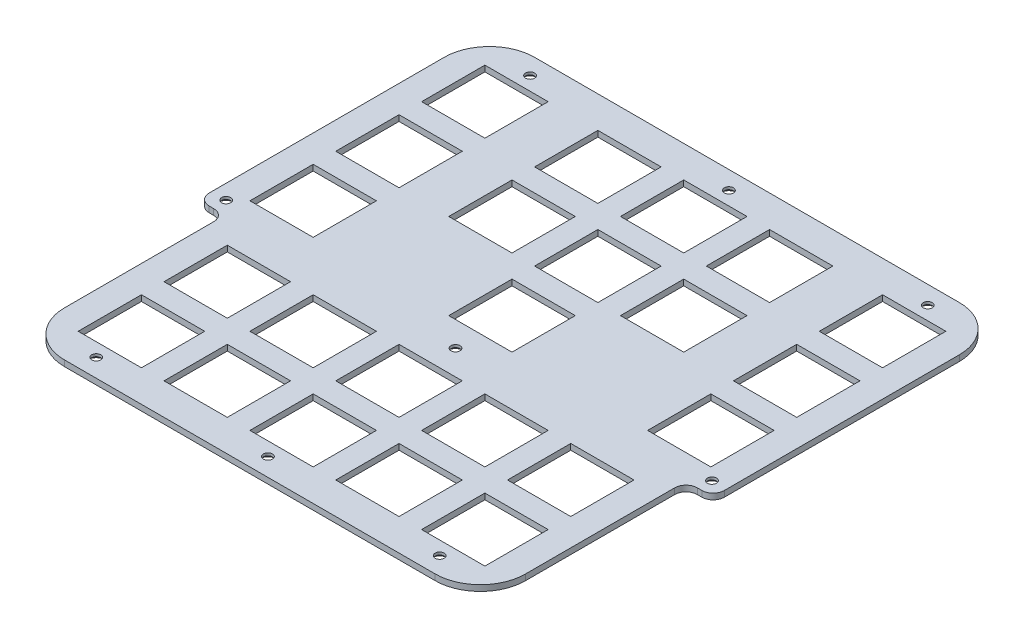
ISO-10303-21;
HEADER;
FILE_DESCRIPTION(('STEP AP214'),'2;1');
FILE_NAME('part.step','',(''),(''),'','','');
FILE_SCHEMA(('AUTOMOTIVE_DESIGN { 1 0 10303 214 1 1 1 1 }'));
ENDSEC;
DATA;
#1=APPLICATION_CONTEXT('core data for automotive mechanical design processes');
#2=APPLICATION_PROTOCOL_DEFINITION('international standard','automotive_design',2000,#1);
#3=PRODUCT_CONTEXT('',#1,'mechanical');
#4=PRODUCT('Part','Part','',(#3));
#5=PRODUCT_RELATED_PRODUCT_CATEGORY('part','',(#4));
#6=PRODUCT_DEFINITION_FORMATION('','',#4);
#7=PRODUCT_DEFINITION_CONTEXT('part definition',#1,'design');
#8=PRODUCT_DEFINITION('design','',#6,#7);
#9=PRODUCT_DEFINITION_SHAPE('','',#8);
#10=(LENGTH_UNIT() NAMED_UNIT(*) SI_UNIT(.MILLI.,.METRE.));
#11=(NAMED_UNIT(*) PLANE_ANGLE_UNIT() SI_UNIT($,.RADIAN.));
#12=(NAMED_UNIT(*) SI_UNIT($,.STERADIAN.) SOLID_ANGLE_UNIT());
#13=UNCERTAINTY_MEASURE_WITH_UNIT(LENGTH_MEASURE(1.E-05),#10,'distance_accuracy_value','');
#14=(GEOMETRIC_REPRESENTATION_CONTEXT(3) GLOBAL_UNCERTAINTY_ASSIGNED_CONTEXT((#13)) GLOBAL_UNIT_ASSIGNED_CONTEXT((#10,
#11,#12)) REPRESENTATION_CONTEXT('',''));
#15=CARTESIAN_POINT('',(0.,0.,0.));
#16=DIRECTION('',(0.,0.,1.));
#17=DIRECTION('',(1.,0.,0.));
#18=AXIS2_PLACEMENT_3D('',#15,#16,#17);
#19=CARTESIAN_POINT('',(5.99999999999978,1.3,-4.99999999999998));
#20=DIRECTION('',(0.,-1.,0.));
#21=DIRECTION('',(0.,0.,-1.));
#22=AXIS2_PLACEMENT_3D('',#19,#20,#21);
#23=PLANE('',#22);
#24=CARTESIAN_POINT('',(-6.75000000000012,1.3,-43.5));
#25=DIRECTION('',(0.,-1.,0.));
#26=DIRECTION('',(0.,0.,-1.));
#27=AXIS2_PLACEMENT_3D('',#24,#25,#26);
#28=CIRCLE('',#27,0.999999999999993);
#29=CARTESIAN_POINT('',(-6.75000000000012,1.3,-44.5));
#30=VERTEX_POINT('',#29);
#31=EDGE_CURVE('E2856',#30,#30,#28,.T.);
#32=ORIENTED_EDGE('',*,*,#31,.T.);
#33=EDGE_LOOP('',(#32));
#34=FACE_BOUND('',#33,.T.);
#35=CARTESIAN_POINT('',(9.,1.3,1.));
#36=DIRECTION('',(0.,-1.,0.));
#37=DIRECTION('',(0.,0.,-1.));
#38=AXIS2_PLACEMENT_3D('',#35,#36,#37);
#39=CIRCLE('',#38,0.999999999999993);
#40=CARTESIAN_POINT('',(9.,1.3,0.));
#41=VERTEX_POINT('',#40);
#42=EDGE_CURVE('E2866',#41,#41,#39,.T.);
#43=ORIENTED_EDGE('',*,*,#42,.T.);
#44=EDGE_LOOP('',(#43));
#45=FACE_BOUND('',#44,.T.);
#46=CARTESIAN_POINT('',(47.,1.3,1.));
#47=DIRECTION('',(0.,-1.,0.));
#48=DIRECTION('',(0.,0.,-1.));
#49=AXIS2_PLACEMENT_3D('',#46,#47,#48);
#50=CIRCLE('',#49,0.999999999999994);
#51=CARTESIAN_POINT('',(47.,1.3,0.));
#52=VERTEX_POINT('',#51);
#53=EDGE_CURVE('E2875',#52,#52,#50,.T.);
#54=ORIENTED_EDGE('',*,*,#53,.T.);
#55=EDGE_LOOP('',(#54));
#56=FACE_BOUND('',#55,.T.);
#57=CARTESIAN_POINT('',(85.,1.3,1.));
#58=DIRECTION('',(0.,-1.,0.));
#59=DIRECTION('',(0.,0.,-1.));
#60=AXIS2_PLACEMENT_3D('',#57,#58,#59);
#61=CIRCLE('',#60,0.999999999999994);
#62=CARTESIAN_POINT('',(85.,1.3,0.));
#63=VERTEX_POINT('',#62);
#64=EDGE_CURVE('E2884',#63,#63,#61,.T.);
#65=ORIENTED_EDGE('',*,*,#64,.T.);
#66=EDGE_LOOP('',(#65));
#67=FACE_BOUND('',#66,.T.);
#68=CARTESIAN_POINT('',(100.75,1.3,-43.5));
#69=DIRECTION('',(0.,-1.,0.));
#70=DIRECTION('',(0.,0.,-1.));
#71=AXIS2_PLACEMENT_3D('',#68,#69,#70);
#72=CIRCLE('',#71,0.999999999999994);
#73=CARTESIAN_POINT('',(100.75,1.3,-44.5));
#74=VERTEX_POINT('',#73);
#75=EDGE_CURVE('E2893',#74,#74,#72,.T.);
#76=ORIENTED_EDGE('',*,*,#75,.T.);
#77=EDGE_LOOP('',(#76));
#78=FACE_BOUND('',#77,.T.);
#79=CARTESIAN_POINT('',(91.0000000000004,1.3,-101.));
#80=DIRECTION('',(0.,-1.,0.));
#81=DIRECTION('',(0.,0.,-1.));
#82=AXIS2_PLACEMENT_3D('',#79,#80,#81);
#83=CIRCLE('',#82,0.999999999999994);
#84=CARTESIAN_POINT('',(91.0000000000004,1.3,-102.));
#85=VERTEX_POINT('',#84);
#86=EDGE_CURVE('E2902',#85,#85,#83,.T.);
#87=ORIENTED_EDGE('',*,*,#86,.T.);
#88=EDGE_LOOP('',(#87));
#89=FACE_BOUND('',#88,.T.);
#90=CARTESIAN_POINT('',(46.9999999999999,1.3,-101.));
#91=DIRECTION('',(0.,-1.,0.));
#92=DIRECTION('',(0.,0.,-1.));
#93=AXIS2_PLACEMENT_3D('',#90,#91,#92);
#94=CIRCLE('',#93,0.999999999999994);
#95=CARTESIAN_POINT('',(46.9999999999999,1.3,-102.));
#96=VERTEX_POINT('',#95);
#97=EDGE_CURVE('E2911',#96,#96,#94,.T.);
#98=ORIENTED_EDGE('',*,*,#97,.T.);
#99=EDGE_LOOP('',(#98));
#100=FACE_BOUND('',#99,.T.);
#101=CARTESIAN_POINT('',(2.99999999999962,1.3,-101.));
#102=DIRECTION('',(0.,-1.,0.));
#103=DIRECTION('',(0.,0.,-1.));
#104=AXIS2_PLACEMENT_3D('',#101,#102,#103);
#105=CIRCLE('',#104,0.999999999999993);
#106=CARTESIAN_POINT('',(2.99999999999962,1.3,-102.));
#107=VERTEX_POINT('',#106);
#108=EDGE_CURVE('E2920',#107,#107,#105,.T.);
#109=ORIENTED_EDGE('',*,*,#108,.T.);
#110=EDGE_LOOP('',(#109));
#111=FACE_BOUND('',#110,.T.);
#112=CARTESIAN_POINT('',(46.9999999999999,1.3,-40.5));
#113=DIRECTION('',(0.,-1.,0.));
#114=DIRECTION('',(0.,0.,-1.));
#115=AXIS2_PLACEMENT_3D('',#112,#113,#114);
#116=CIRCLE('',#115,0.999999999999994);
#117=CARTESIAN_POINT('',(46.9999999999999,1.3,-41.5));
#118=VERTEX_POINT('',#117);
#119=EDGE_CURVE('E726',#118,#118,#116,.T.);
#120=ORIENTED_EDGE('',*,*,#119,.T.);
#121=EDGE_LOOP('',(#120));
#122=FACE_BOUND('',#121,.T.);
#123=DIRECTION('',(-1.,0.,0.));
#124=VECTOR('',#123,1.);
#125=CARTESIAN_POINT('',(9.99999999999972,1.3,-79.));
#126=LINE('',#125,#124);
#127=CARTESIAN_POINT('',(9.99999999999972,1.3,-79.));
#128=VERTEX_POINT('',#127);
#129=CARTESIAN_POINT('',(-4.00000000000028,1.3,-79.));
#130=VERTEX_POINT('',#129);
#131=EDGE_CURVE('E736',#128,#130,#126,.T.);
#132=ORIENTED_EDGE('',*,*,#131,.F.);
#133=DIRECTION('',(0.,0.,-1.));
#134=VECTOR('',#133,1.);
#135=CARTESIAN_POINT('',(9.99999999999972,1.3,-65.));
#136=LINE('',#135,#134);
#137=CARTESIAN_POINT('',(9.99999999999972,1.3,-65.));
#138=VERTEX_POINT('',#137);
#139=EDGE_CURVE('E744',#138,#128,#136,.T.);
#140=ORIENTED_EDGE('',*,*,#139,.F.);
#141=DIRECTION('',(1.,0.,0.));
#142=VECTOR('',#141,1.);
#143=CARTESIAN_POINT('',(9.99999999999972,1.3,-65.));
#144=LINE('',#143,#142);
#145=CARTESIAN_POINT('',(-4.00000000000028,1.3,-65.));
#146=VERTEX_POINT('',#145);
#147=EDGE_CURVE('E741',#146,#138,#144,.T.);
#148=ORIENTED_EDGE('',*,*,#147,.F.);
#149=DIRECTION('',(0.,0.,1.));
#150=VECTOR('',#149,1.);
#151=CARTESIAN_POINT('',(-4.00000000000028,1.3,-65.));
#152=LINE('',#151,#150);
#153=EDGE_CURVE('E738',#130,#146,#152,.T.);
#154=ORIENTED_EDGE('',*,*,#153,.F.);
#155=EDGE_LOOP('',(#132,#140,#148,#154));
#156=FACE_BOUND('',#155,.T.);
#157=DIRECTION('',(0.,0.,1.));
#158=VECTOR('',#157,1.);
#159=CARTESIAN_POINT('',(84.0000000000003,1.3,-83.9999999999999));
#160=LINE('',#159,#158);
#161=CARTESIAN_POINT('',(84.0000000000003,1.3,-97.9999999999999));
#162=VERTEX_POINT('',#161);
#163=CARTESIAN_POINT('',(84.0000000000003,1.3,-83.9999999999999));
#164=VERTEX_POINT('',#163);
#165=EDGE_CURVE('E798',#162,#164,#160,.T.);
#166=ORIENTED_EDGE('',*,*,#165,.F.);
#167=DIRECTION('',(-1.,0.,0.));
#168=VECTOR('',#167,1.);
#169=CARTESIAN_POINT('',(84.0000000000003,1.3,-97.9999999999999));
#170=LINE('',#169,#168);
#171=CARTESIAN_POINT('',(98.0000000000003,1.3,-97.9999999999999));
#172=VERTEX_POINT('',#171);
#173=EDGE_CURVE('E806',#172,#162,#170,.T.);
#174=ORIENTED_EDGE('',*,*,#173,.F.);
#175=DIRECTION('',(0.,0.,-1.));
#176=VECTOR('',#175,1.);
#177=CARTESIAN_POINT('',(98.0000000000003,1.3,-83.9999999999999));
#178=LINE('',#177,#176);
#179=CARTESIAN_POINT('',(98.0000000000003,1.3,-83.9999999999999));
#180=VERTEX_POINT('',#179);
#181=EDGE_CURVE('E803',#180,#172,#178,.T.);
#182=ORIENTED_EDGE('',*,*,#181,.F.);
#183=DIRECTION('',(1.,0.,0.));
#184=VECTOR('',#183,1.);
#185=CARTESIAN_POINT('',(84.0000000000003,1.3,-83.9999999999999));
#186=LINE('',#185,#184);
#187=EDGE_CURVE('E800',#164,#180,#186,.T.);
#188=ORIENTED_EDGE('',*,*,#187,.F.);
#189=EDGE_LOOP('',(#166,#174,#182,#188));
#190=FACE_BOUND('',#189,.T.);
#191=DIRECTION('',(-1.,0.,0.));
#192=VECTOR('',#191,1.);
#193=CARTESIAN_POINT('',(20.9999999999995,1.3,-79.));
#194=LINE('',#193,#192);
#195=CARTESIAN_POINT('',(34.9999999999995,1.3,-79.));
#196=VERTEX_POINT('',#195);
#197=CARTESIAN_POINT('',(20.9999999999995,1.3,-79.));
#198=VERTEX_POINT('',#197);
#199=EDGE_CURVE('E860',#196,#198,#194,.T.);
#200=ORIENTED_EDGE('',*,*,#199,.F.);
#201=DIRECTION('',(0.,0.,-1.));
#202=VECTOR('',#201,1.);
#203=CARTESIAN_POINT('',(34.9999999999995,1.3,-65.));
#204=LINE('',#203,#202);
#205=CARTESIAN_POINT('',(34.9999999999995,1.3,-65.));
#206=VERTEX_POINT('',#205);
#207=EDGE_CURVE('E868',#206,#196,#204,.T.);
#208=ORIENTED_EDGE('',*,*,#207,.F.);
#209=DIRECTION('',(1.,0.,0.));
#210=VECTOR('',#209,1.);
#211=CARTESIAN_POINT('',(20.9999999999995,1.3,-65.));
#212=LINE('',#211,#210);
#213=CARTESIAN_POINT('',(20.9999999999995,1.3,-65.));
#214=VERTEX_POINT('',#213);
#215=EDGE_CURVE('E865',#214,#206,#212,.T.);
#216=ORIENTED_EDGE('',*,*,#215,.F.);
#217=DIRECTION('',(0.,0.,1.));
#218=VECTOR('',#217,1.);
#219=CARTESIAN_POINT('',(20.9999999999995,1.3,-65.));
#220=LINE('',#219,#218);
#221=EDGE_CURVE('E862',#198,#214,#220,.T.);
#222=ORIENTED_EDGE('',*,*,#221,.F.);
#223=EDGE_LOOP('',(#200,#208,#216,#222));
#224=FACE_BOUND('',#223,.T.);
#225=DIRECTION('',(-1.,0.,0.));
#226=VECTOR('',#225,1.);
#227=CARTESIAN_POINT('',(58.9999999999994,1.3,-79.));
#228=LINE('',#227,#226);
#229=CARTESIAN_POINT('',(72.9999999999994,1.3,-79.));
#230=VERTEX_POINT('',#229);
#231=CARTESIAN_POINT('',(58.9999999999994,1.3,-79.));
#232=VERTEX_POINT('',#231);
#233=EDGE_CURVE('E922',#230,#232,#228,.T.);
#234=ORIENTED_EDGE('',*,*,#233,.F.);
#235=DIRECTION('',(0.,0.,-1.));
#236=VECTOR('',#235,1.);
#237=CARTESIAN_POINT('',(72.9999999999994,1.3,-65.));
#238=LINE('',#237,#236);
#239=CARTESIAN_POINT('',(72.9999999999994,1.3,-65.));
#240=VERTEX_POINT('',#239);
#241=EDGE_CURVE('E930',#240,#230,#238,.T.);
#242=ORIENTED_EDGE('',*,*,#241,.F.);
#243=DIRECTION('',(1.,0.,0.));
#244=VECTOR('',#243,1.);
#245=CARTESIAN_POINT('',(58.9999999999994,1.3,-65.));
#246=LINE('',#245,#244);
#247=CARTESIAN_POINT('',(58.9999999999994,1.3,-65.));
#248=VERTEX_POINT('',#247);
#249=EDGE_CURVE('E927',#248,#240,#246,.T.);
#250=ORIENTED_EDGE('',*,*,#249,.F.);
#251=DIRECTION('',(0.,0.,1.));
#252=VECTOR('',#251,1.);
#253=CARTESIAN_POINT('',(58.9999999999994,1.3,-65.));
#254=LINE('',#253,#252);
#255=EDGE_CURVE('E924',#232,#248,#254,.T.);
#256=ORIENTED_EDGE('',*,*,#255,.F.);
#257=EDGE_LOOP('',(#234,#242,#250,#256));
#258=FACE_BOUND('',#257,.T.);
#259=DIRECTION('',(-1.,0.,0.));
#260=VECTOR('',#259,1.);
#261=CARTESIAN_POINT('',(58.999999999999,1.3,-98.));
#262=LINE('',#261,#260);
#263=CARTESIAN_POINT('',(72.999999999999,1.3,-98.));
#264=VERTEX_POINT('',#263);
#265=CARTESIAN_POINT('',(58.999999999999,1.3,-98.));
#266=VERTEX_POINT('',#265);
#267=EDGE_CURVE('E984',#264,#266,#262,.T.);
#268=ORIENTED_EDGE('',*,*,#267,.F.);
#269=DIRECTION('',(0.,0.,-1.));
#270=VECTOR('',#269,1.);
#271=CARTESIAN_POINT('',(72.999999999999,1.3,-84.));
#272=LINE('',#271,#270);
#273=CARTESIAN_POINT('',(72.999999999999,1.3,-84.));
#274=VERTEX_POINT('',#273);
#275=EDGE_CURVE('E992',#274,#264,#272,.T.);
#276=ORIENTED_EDGE('',*,*,#275,.F.);
#277=DIRECTION('',(1.,0.,0.));
#278=VECTOR('',#277,1.);
#279=CARTESIAN_POINT('',(58.999999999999,1.3,-84.));
#280=LINE('',#279,#278);
#281=CARTESIAN_POINT('',(58.999999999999,1.3,-84.));
#282=VERTEX_POINT('',#281);
#283=EDGE_CURVE('E989',#282,#274,#280,.T.);
#284=ORIENTED_EDGE('',*,*,#283,.F.);
#285=DIRECTION('',(0.,0.,1.));
#286=VECTOR('',#285,1.);
#287=CARTESIAN_POINT('',(58.999999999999,1.3,-84.));
#288=LINE('',#287,#286);
#289=EDGE_CURVE('E986',#266,#282,#288,.T.);
#290=ORIENTED_EDGE('',*,*,#289,.F.);
#291=EDGE_LOOP('',(#268,#276,#284,#290));
#292=FACE_BOUND('',#291,.T.);
#293=DIRECTION('',(0.,0.,1.));
#294=VECTOR('',#293,1.);
#295=CARTESIAN_POINT('',(-4.00000000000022,1.3,-46.));
#296=LINE('',#295,#294);
#297=CARTESIAN_POINT('',(-4.00000000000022,1.3,-60.));
#298=VERTEX_POINT('',#297);
#299=CARTESIAN_POINT('',(-4.00000000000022,1.3,-46.));
#300=VERTEX_POINT('',#299);
#301=EDGE_CURVE('E1046',#298,#300,#296,.T.);
#302=ORIENTED_EDGE('',*,*,#301,.F.);
#303=DIRECTION('',(-1.,0.,0.));
#304=VECTOR('',#303,1.);
#305=CARTESIAN_POINT('',(9.99999999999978,1.3,-60.));
#306=LINE('',#305,#304);
#307=CARTESIAN_POINT('',(9.99999999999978,1.3,-60.));
#308=VERTEX_POINT('',#307);
#309=EDGE_CURVE('E1054',#308,#298,#306,.T.);
#310=ORIENTED_EDGE('',*,*,#309,.F.);
#311=DIRECTION('',(0.,0.,-1.));
#312=VECTOR('',#311,1.);
#313=CARTESIAN_POINT('',(9.99999999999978,1.3,-46.));
#314=LINE('',#313,#312);
#315=CARTESIAN_POINT('',(9.99999999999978,1.3,-46.));
#316=VERTEX_POINT('',#315);
#317=EDGE_CURVE('E1051',#316,#308,#314,.T.);
#318=ORIENTED_EDGE('',*,*,#317,.F.);
#319=DIRECTION('',(1.,0.,0.));
#320=VECTOR('',#319,1.);
#321=CARTESIAN_POINT('',(9.99999999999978,1.3,-46.));
#322=LINE('',#321,#320);
#323=EDGE_CURVE('E1048',#300,#316,#322,.T.);
#324=ORIENTED_EDGE('',*,*,#323,.F.);
#325=EDGE_LOOP('',(#302,#310,#318,#324));
#326=FACE_BOUND('',#325,.T.);
#327=DIRECTION('',(-1.,0.,0.));
#328=VECTOR('',#327,1.);
#329=CARTESIAN_POINT('',(77.9999999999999,1.3,-35.));
#330=LINE('',#329,#328);
#331=CARTESIAN_POINT('',(91.9999999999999,1.3,-35.));
#332=VERTEX_POINT('',#331);
#333=CARTESIAN_POINT('',(77.9999999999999,1.3,-35.));
#334=VERTEX_POINT('',#333);
#335=EDGE_CURVE('E1108',#332,#334,#330,.T.);
#336=ORIENTED_EDGE('',*,*,#335,.F.);
#337=DIRECTION('',(0.,0.,-1.));
#338=VECTOR('',#337,1.);
#339=CARTESIAN_POINT('',(91.9999999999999,1.3,-21.));
#340=LINE('',#339,#338);
#341=CARTESIAN_POINT('',(91.9999999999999,1.3,-21.));
#342=VERTEX_POINT('',#341);
#343=EDGE_CURVE('E1116',#342,#332,#340,.T.);
#344=ORIENTED_EDGE('',*,*,#343,.F.);
#345=DIRECTION('',(1.,0.,0.));
#346=VECTOR('',#345,1.);
#347=CARTESIAN_POINT('',(77.9999999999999,1.3,-21.));
#348=LINE('',#347,#346);
#349=CARTESIAN_POINT('',(77.9999999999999,1.3,-21.));
#350=VERTEX_POINT('',#349);
#351=EDGE_CURVE('E1113',#350,#342,#348,.T.);
#352=ORIENTED_EDGE('',*,*,#351,.F.);
#353=DIRECTION('',(0.,0.,1.));
#354=VECTOR('',#353,1.);
#355=CARTESIAN_POINT('',(77.9999999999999,1.3,-21.));
#356=LINE('',#355,#354);
#357=EDGE_CURVE('E1110',#334,#350,#356,.T.);
#358=ORIENTED_EDGE('',*,*,#357,.F.);
#359=EDGE_LOOP('',(#336,#344,#352,#358));
#360=FACE_BOUND('',#359,.T.);
#361=DIRECTION('',(-1.,0.,0.));
#362=VECTOR('',#361,1.);
#363=CARTESIAN_POINT('',(39.9999999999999,1.3,-35.));
#364=LINE('',#363,#362);
#365=CARTESIAN_POINT('',(53.9999999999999,1.3,-35.));
#366=VERTEX_POINT('',#365);
#367=CARTESIAN_POINT('',(39.9999999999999,1.3,-35.));
#368=VERTEX_POINT('',#367);
#369=EDGE_CURVE('E1170',#366,#368,#364,.T.);
#370=ORIENTED_EDGE('',*,*,#369,.F.);
#371=DIRECTION('',(0.,0.,-1.));
#372=VECTOR('',#371,1.);
#373=CARTESIAN_POINT('',(53.9999999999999,1.3,-21.));
#374=LINE('',#373,#372);
#375=CARTESIAN_POINT('',(53.9999999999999,1.3,-21.));
#376=VERTEX_POINT('',#375);
#377=EDGE_CURVE('E1178',#376,#366,#374,.T.);
#378=ORIENTED_EDGE('',*,*,#377,.F.);
#379=DIRECTION('',(1.,0.,0.));
#380=VECTOR('',#379,1.);
#381=CARTESIAN_POINT('',(39.9999999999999,1.3,-21.));
#382=LINE('',#381,#380);
#383=CARTESIAN_POINT('',(39.9999999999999,1.3,-21.));
#384=VERTEX_POINT('',#383);
#385=EDGE_CURVE('E1175',#384,#376,#382,.T.);
#386=ORIENTED_EDGE('',*,*,#385,.F.);
#387=DIRECTION('',(0.,0.,1.));
#388=VECTOR('',#387,1.);
#389=CARTESIAN_POINT('',(39.9999999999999,1.3,-21.));
#390=LINE('',#389,#388);
#391=EDGE_CURVE('E1172',#368,#384,#390,.T.);
#392=ORIENTED_EDGE('',*,*,#391,.F.);
#393=EDGE_LOOP('',(#370,#378,#386,#392));
#394=FACE_BOUND('',#393,.T.);
#395=DIRECTION('',(-1.,0.,0.));
#396=VECTOR('',#395,1.);
#397=CARTESIAN_POINT('',(78.,1.3,-16.));
#398=LINE('',#397,#396);
#399=CARTESIAN_POINT('',(92.,1.3,-16.));
#400=VERTEX_POINT('',#399);
#401=CARTESIAN_POINT('',(78.,1.3,-16.));
#402=VERTEX_POINT('',#401);
#403=EDGE_CURVE('E1232',#400,#402,#398,.T.);
#404=ORIENTED_EDGE('',*,*,#403,.F.);
#405=DIRECTION('',(0.,0.,-1.));
#406=VECTOR('',#405,1.);
#407=CARTESIAN_POINT('',(92.,1.3,-2.));
#408=LINE('',#407,#406);
#409=CARTESIAN_POINT('',(92.,1.3,-2.));
#410=VERTEX_POINT('',#409);
#411=EDGE_CURVE('E1240',#410,#400,#408,.T.);
#412=ORIENTED_EDGE('',*,*,#411,.F.);
#413=DIRECTION('',(1.,0.,0.));
#414=VECTOR('',#413,1.);
#415=CARTESIAN_POINT('',(78.,1.3,-2.));
#416=LINE('',#415,#414);
#417=CARTESIAN_POINT('',(78.,1.3,-2.));
#418=VERTEX_POINT('',#417);
#419=EDGE_CURVE('E1237',#418,#410,#416,.T.);
#420=ORIENTED_EDGE('',*,*,#419,.F.);
#421=DIRECTION('',(0.,0.,1.));
#422=VECTOR('',#421,1.);
#423=CARTESIAN_POINT('',(78.,1.3,-2.));
#424=LINE('',#423,#422);
#425=EDGE_CURVE('E1234',#402,#418,#424,.T.);
#426=ORIENTED_EDGE('',*,*,#425,.F.);
#427=EDGE_LOOP('',(#404,#412,#420,#426));
#428=FACE_BOUND('',#427,.T.);
#429=DIRECTION('',(-1.,0.,0.));
#430=VECTOR('',#429,1.);
#431=CARTESIAN_POINT('',(40.,1.3,-16.));
#432=LINE('',#431,#430);
#433=CARTESIAN_POINT('',(54.,1.3,-16.));
#434=VERTEX_POINT('',#433);
#435=CARTESIAN_POINT('',(40.,1.3,-16.));
#436=VERTEX_POINT('',#435);
#437=EDGE_CURVE('E1294',#434,#436,#432,.T.);
#438=ORIENTED_EDGE('',*,*,#437,.F.);
#439=DIRECTION('',(0.,0.,-1.));
#440=VECTOR('',#439,1.);
#441=CARTESIAN_POINT('',(54.,1.3,-2.));
#442=LINE('',#441,#440);
#443=CARTESIAN_POINT('',(54.,1.3,-2.));
#444=VERTEX_POINT('',#443);
#445=EDGE_CURVE('E1302',#444,#434,#442,.T.);
#446=ORIENTED_EDGE('',*,*,#445,.F.);
#447=DIRECTION('',(1.,0.,0.));
#448=VECTOR('',#447,1.);
#449=CARTESIAN_POINT('',(40.,1.3,-2.));
#450=LINE('',#449,#448);
#451=CARTESIAN_POINT('',(40.,1.3,-2.));
#452=VERTEX_POINT('',#451);
#453=EDGE_CURVE('E1299',#452,#444,#450,.T.);
#454=ORIENTED_EDGE('',*,*,#453,.F.);
#455=DIRECTION('',(0.,0.,1.));
#456=VECTOR('',#455,1.);
#457=CARTESIAN_POINT('',(40.,1.3,-2.));
#458=LINE('',#457,#456);
#459=EDGE_CURVE('E1296',#436,#452,#458,.T.);
#460=ORIENTED_EDGE('',*,*,#459,.F.);
#461=EDGE_LOOP('',(#438,#446,#454,#460));
#462=FACE_BOUND('',#461,.T.);
#463=DIRECTION('',(0.,0.,-1.));
#464=VECTOR('',#463,1.);
#465=CARTESIAN_POINT('',(34.999999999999,1.3,-84.));
#466=LINE('',#465,#464);
#467=CARTESIAN_POINT('',(34.999999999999,1.3,-84.));
#468=VERTEX_POINT('',#467);
#469=CARTESIAN_POINT('',(34.999999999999,1.3,-98.));
#470=VERTEX_POINT('',#469);
#471=EDGE_CURVE('E1356',#468,#470,#466,.T.);
#472=ORIENTED_EDGE('',*,*,#471,.F.);
#473=DIRECTION('',(1.,0.,0.));
#474=VECTOR('',#473,1.);
#475=CARTESIAN_POINT('',(20.999999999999,1.3,-84.));
#476=LINE('',#475,#474);
#477=CARTESIAN_POINT('',(20.999999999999,1.3,-84.));
#478=VERTEX_POINT('',#477);
#479=EDGE_CURVE('E1364',#478,#468,#476,.T.);
#480=ORIENTED_EDGE('',*,*,#479,.F.);
#481=DIRECTION('',(0.,0.,1.));
#482=VECTOR('',#481,1.);
#483=CARTESIAN_POINT('',(20.999999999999,1.3,-84.));
#484=LINE('',#483,#482);
#485=CARTESIAN_POINT('',(20.999999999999,1.3,-98.));
#486=VERTEX_POINT('',#485);
#487=EDGE_CURVE('E1361',#486,#478,#484,.T.);
#488=ORIENTED_EDGE('',*,*,#487,.F.);
#489=DIRECTION('',(-1.,0.,0.));
#490=VECTOR('',#489,1.);
#491=CARTESIAN_POINT('',(20.999999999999,1.3,-98.));
#492=LINE('',#491,#490);
#493=EDGE_CURVE('E1358',#470,#486,#492,.T.);
#494=ORIENTED_EDGE('',*,*,#493,.F.);
#495=EDGE_LOOP('',(#472,#480,#488,#494));
#496=FACE_BOUND('',#495,.T.);
#497=CARTESIAN_POINT('',(5.99999999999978,1.3,-4.99999999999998));
#498=DIRECTION('',(0.,1.,0.));
#499=DIRECTION('',(0.,0.,-1.));
#500=AXIS2_PLACEMENT_3D('',#497,#498,#499);
#501=CIRCLE('',#500,10.);
#502=CARTESIAN_POINT('',(-4.00000000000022,1.3,-5.00000000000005));
#503=VERTEX_POINT('',#502);
#504=CARTESIAN_POINT('',(5.99999999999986,1.3,5.00000000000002));
#505=VERTEX_POINT('',#504);
#506=EDGE_CURVE('E1418',#503,#505,#501,.T.);
#507=ORIENTED_EDGE('',*,*,#506,.T.);
#508=DIRECTION('',(1.,0.,0.));
#509=VECTOR('',#508,1.);
#510=CARTESIAN_POINT('',(5.99999999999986,1.3,5.00000000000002));
#511=LINE('',#510,#509);
#512=CARTESIAN_POINT('',(88.,1.3,4.99999999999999));
#513=VERTEX_POINT('',#512);
#514=EDGE_CURVE('E1421',#505,#513,#511,.T.);
#515=ORIENTED_EDGE('',*,*,#514,.T.);
#516=CARTESIAN_POINT('',(88.0000000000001,1.3,-5.00000000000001));
#517=DIRECTION('',(0.,1.,0.));
#518=DIRECTION('',(0.,0.,1.));
#519=AXIS2_PLACEMENT_3D('',#516,#517,#518);
#520=CIRCLE('',#519,10.);
#521=CARTESIAN_POINT('',(98.0000000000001,1.3,-5.00000000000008));
#522=VERTEX_POINT('',#521);
#523=EDGE_CURVE('E1424',#513,#522,#520,.T.);
#524=ORIENTED_EDGE('',*,*,#523,.T.);
#525=DIRECTION('',(0.,0.,-1.));
#526=VECTOR('',#525,1.);
#527=CARTESIAN_POINT('',(98.0000000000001,1.3,-5.00000000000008));
#528=LINE('',#527,#526);
#529=CARTESIAN_POINT('',(98.0000000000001,1.3,-38.));
#530=VERTEX_POINT('',#529);
#531=EDGE_CURVE('E1426',#522,#530,#528,.T.);
#532=ORIENTED_EDGE('',*,*,#531,.T.);
#533=CARTESIAN_POINT('',(100.5,1.3,-38.));
#534=DIRECTION('',(0.,-1.,0.));
#535=DIRECTION('',(0.,0.,-1.));
#536=AXIS2_PLACEMENT_3D('',#533,#534,#535);
#537=CIRCLE('',#536,2.5);
#538=CARTESIAN_POINT('',(100.5,1.3,-40.5));
#539=VERTEX_POINT('',#538);
#540=EDGE_CURVE('E1428',#530,#539,#537,.T.);
#541=ORIENTED_EDGE('',*,*,#540,.T.);
#542=DIRECTION('',(1.,0.,0.));
#543=VECTOR('',#542,1.);
#544=CARTESIAN_POINT('',(100.5,1.3,-40.5));
#545=LINE('',#544,#543);
#546=CARTESIAN_POINT('',(101.5,1.3,-40.5));
#547=VERTEX_POINT('',#546);
#548=EDGE_CURVE('E1430',#539,#547,#545,.T.);
#549=ORIENTED_EDGE('',*,*,#548,.T.);
#550=CARTESIAN_POINT('',(101.5,1.3,-43.));
#551=DIRECTION('',(0.,1.,0.));
#552=DIRECTION('',(0.,0.,-1.));
#553=AXIS2_PLACEMENT_3D('',#550,#551,#552);
#554=CIRCLE('',#553,2.5);
#555=CARTESIAN_POINT('',(104.,1.3,-43.));
#556=VERTEX_POINT('',#555);
#557=EDGE_CURVE('E1432',#547,#556,#554,.T.);
#558=ORIENTED_EDGE('',*,*,#557,.T.);
#559=DIRECTION('',(0.,0.,-1.));
#560=VECTOR('',#559,1.);
#561=CARTESIAN_POINT('',(104.,1.3,-94.9999999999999));
#562=LINE('',#561,#560);
#563=CARTESIAN_POINT('',(104.,1.3,-94.9999999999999));
#564=VERTEX_POINT('',#563);
#565=EDGE_CURVE('E1434',#556,#564,#562,.T.);
#566=ORIENTED_EDGE('',*,*,#565,.T.);
#567=CARTESIAN_POINT('',(94.,1.3,-95.));
#568=DIRECTION('',(0.,1.,0.));
#569=DIRECTION('',(0.,0.,1.));
#570=AXIS2_PLACEMENT_3D('',#567,#568,#569);
#571=CIRCLE('',#570,9.99999999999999);
#572=CARTESIAN_POINT('',(93.9999999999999,1.3,-105.));
#573=VERTEX_POINT('',#572);
#574=EDGE_CURVE('E1436',#564,#573,#571,.T.);
#575=ORIENTED_EDGE('',*,*,#574,.T.);
#576=DIRECTION('',(-1.,0.,0.));
#577=VECTOR('',#576,1.);
#578=CARTESIAN_POINT('',(0.,1.3,-105.));
#579=LINE('',#578,#577);
#580=CARTESIAN_POINT('',(0.,1.3,-105.));
#581=VERTEX_POINT('',#580);
#582=EDGE_CURVE('E1438',#573,#581,#579,.T.);
#583=ORIENTED_EDGE('',*,*,#582,.T.);
#584=CARTESIAN_POINT('',(-1.17961196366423E-13,1.3,-95.));
#585=DIRECTION('',(0.,1.,0.));
#586=DIRECTION('',(0.,0.,-1.));
#587=AXIS2_PLACEMENT_3D('',#584,#585,#586);
#588=CIRCLE('',#587,10.);
#589=CARTESIAN_POINT('',(-10.0000000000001,1.3,-94.9999999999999));
#590=VERTEX_POINT('',#589);
#591=EDGE_CURVE('E1440',#581,#590,#588,.T.);
#592=ORIENTED_EDGE('',*,*,#591,.T.);
#593=DIRECTION('',(0.,0.,1.));
#594=VECTOR('',#593,1.);
#595=CARTESIAN_POINT('',(-10.0000000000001,1.3,-94.9999999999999));
#596=LINE('',#595,#594);
#597=CARTESIAN_POINT('',(-10.0000000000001,1.3,-43.));
#598=VERTEX_POINT('',#597);
#599=EDGE_CURVE('E1442',#590,#598,#596,.T.);
#600=ORIENTED_EDGE('',*,*,#599,.T.);
#601=CARTESIAN_POINT('',(-7.50000000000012,1.3,-43.));
#602=DIRECTION('',(0.,1.,0.));
#603=DIRECTION('',(0.,0.,1.));
#604=AXIS2_PLACEMENT_3D('',#601,#602,#603);
#605=CIRCLE('',#604,2.5);
#606=CARTESIAN_POINT('',(-7.50000000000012,1.3,-40.5));
#607=VERTEX_POINT('',#606);
#608=EDGE_CURVE('E1444',#598,#607,#605,.T.);
#609=ORIENTED_EDGE('',*,*,#608,.T.);
#610=DIRECTION('',(1.,0.,0.));
#611=VECTOR('',#610,1.);
#612=CARTESIAN_POINT('',(-6.50000000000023,1.3,-40.5));
#613=LINE('',#612,#611);
#614=CARTESIAN_POINT('',(-6.50000000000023,1.3,-40.5));
#615=VERTEX_POINT('',#614);
#616=EDGE_CURVE('E1446',#607,#615,#613,.T.);
#617=ORIENTED_EDGE('',*,*,#616,.T.);
#618=CARTESIAN_POINT('',(-6.50000000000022,1.3,-38.));
#619=DIRECTION('',(0.,-1.,0.));
#620=DIRECTION('',(0.,0.,1.));
#621=AXIS2_PLACEMENT_3D('',#618,#619,#620);
#622=CIRCLE('',#621,2.5);
#623=CARTESIAN_POINT('',(-4.00000000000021,1.3,-38.));
#624=VERTEX_POINT('',#623);
#625=EDGE_CURVE('E1448',#615,#624,#622,.T.);
#626=ORIENTED_EDGE('',*,*,#625,.T.);
#627=DIRECTION('',(0.,0.,1.));
#628=VECTOR('',#627,1.);
#629=CARTESIAN_POINT('',(-4.00000000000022,1.3,-5.00000000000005));
#630=LINE('',#629,#628);
#631=EDGE_CURVE('E1450',#624,#503,#630,.T.);
#632=ORIENTED_EDGE('',*,*,#631,.T.);
#633=EDGE_LOOP('',(#507,#515,#524,#532,#541,#549,#558,#566,#575,#583,#592,#600,#609,#617,#626,#632));
#634=FACE_BOUND('',#633,.T.);
#635=DIRECTION('',(0.,0.,-1.));
#636=VECTOR('',#635,1.);
#637=CARTESIAN_POINT('',(16.,1.3,-2.));
#638=LINE('',#637,#636);
#639=CARTESIAN_POINT('',(16.,1.3,-2.));
#640=VERTEX_POINT('',#639);
#641=CARTESIAN_POINT('',(16.,1.3,-16.));
#642=VERTEX_POINT('',#641);
#643=EDGE_CURVE('E1387',#640,#642,#638,.T.);
#644=ORIENTED_EDGE('',*,*,#643,.F.);
#645=DIRECTION('',(1.,0.,0.));
#646=VECTOR('',#645,1.);
#647=CARTESIAN_POINT('',(1.99999999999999,1.3,-2.));
#648=LINE('',#647,#646);
#649=CARTESIAN_POINT('',(1.99999999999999,1.3,-2.));
#650=VERTEX_POINT('',#649);
#651=EDGE_CURVE('E1395',#650,#640,#648,.T.);
#652=ORIENTED_EDGE('',*,*,#651,.F.);
#653=DIRECTION('',(0.,0.,1.));
#654=VECTOR('',#653,1.);
#655=CARTESIAN_POINT('',(1.99999999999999,1.3,-2.));
#656=LINE('',#655,#654);
#657=CARTESIAN_POINT('',(1.99999999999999,1.3,-16.));
#658=VERTEX_POINT('',#657);
#659=EDGE_CURVE('E1392',#658,#650,#656,.T.);
#660=ORIENTED_EDGE('',*,*,#659,.F.);
#661=DIRECTION('',(-1.,0.,0.));
#662=VECTOR('',#661,1.);
#663=CARTESIAN_POINT('',(1.99999999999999,1.3,-16.));
#664=LINE('',#663,#662);
#665=EDGE_CURVE('E1389',#642,#658,#664,.T.);
#666=ORIENTED_EDGE('',*,*,#665,.F.);
#667=EDGE_LOOP('',(#644,#652,#660,#666));
#668=FACE_BOUND('',#667,.T.);
#669=DIRECTION('',(-1.,0.,0.));
#670=VECTOR('',#669,1.);
#671=CARTESIAN_POINT('',(21.,1.3,-16.));
#672=LINE('',#671,#670);
#673=CARTESIAN_POINT('',(35.,1.3,-16.));
#674=VERTEX_POINT('',#673);
#675=CARTESIAN_POINT('',(21.,1.3,-16.));
#676=VERTEX_POINT('',#675);
#677=EDGE_CURVE('E1325',#674,#676,#672,.T.);
#678=ORIENTED_EDGE('',*,*,#677,.F.);
#679=DIRECTION('',(0.,0.,-1.));
#680=VECTOR('',#679,1.);
#681=CARTESIAN_POINT('',(35.,1.3,-2.));
#682=LINE('',#681,#680);
#683=CARTESIAN_POINT('',(35.,1.3,-2.));
#684=VERTEX_POINT('',#683);
#685=EDGE_CURVE('E1333',#684,#674,#682,.T.);
#686=ORIENTED_EDGE('',*,*,#685,.F.);
#687=DIRECTION('',(1.,0.,0.));
#688=VECTOR('',#687,1.);
#689=CARTESIAN_POINT('',(21.,1.3,-2.));
#690=LINE('',#689,#688);
#691=CARTESIAN_POINT('',(21.,1.3,-2.));
#692=VERTEX_POINT('',#691);
#693=EDGE_CURVE('E1330',#692,#684,#690,.T.);
#694=ORIENTED_EDGE('',*,*,#693,.F.);
#695=DIRECTION('',(0.,0.,1.));
#696=VECTOR('',#695,1.);
#697=CARTESIAN_POINT('',(21.,1.3,-2.));
#698=LINE('',#697,#696);
#699=EDGE_CURVE('E1327',#676,#692,#698,.T.);
#700=ORIENTED_EDGE('',*,*,#699,.F.);
#701=EDGE_LOOP('',(#678,#686,#694,#700));
#702=FACE_BOUND('',#701,.T.);
#703=DIRECTION('',(-1.,0.,0.));
#704=VECTOR('',#703,1.);
#705=CARTESIAN_POINT('',(59.,1.3,-16.));
#706=LINE('',#705,#704);
#707=CARTESIAN_POINT('',(73.,1.3,-16.));
#708=VERTEX_POINT('',#707);
#709=CARTESIAN_POINT('',(59.,1.3,-16.));
#710=VERTEX_POINT('',#709);
#711=EDGE_CURVE('E1263',#708,#710,#706,.T.);
#712=ORIENTED_EDGE('',*,*,#711,.F.);
#713=DIRECTION('',(0.,0.,-1.));
#714=VECTOR('',#713,1.);
#715=CARTESIAN_POINT('',(73.,1.3,-2.));
#716=LINE('',#715,#714);
#717=CARTESIAN_POINT('',(73.,1.3,-2.));
#718=VERTEX_POINT('',#717);
#719=EDGE_CURVE('E1271',#718,#708,#716,.T.);
#720=ORIENTED_EDGE('',*,*,#719,.F.);
#721=DIRECTION('',(1.,0.,0.));
#722=VECTOR('',#721,1.);
#723=CARTESIAN_POINT('',(59.,1.3,-2.));
#724=LINE('',#723,#722);
#725=CARTESIAN_POINT('',(59.,1.3,-2.));
#726=VERTEX_POINT('',#725);
#727=EDGE_CURVE('E1268',#726,#718,#724,.T.);
#728=ORIENTED_EDGE('',*,*,#727,.F.);
#729=DIRECTION('',(0.,0.,1.));
#730=VECTOR('',#729,1.);
#731=CARTESIAN_POINT('',(59.,1.3,-2.));
#732=LINE('',#731,#730);
#733=EDGE_CURVE('E1265',#710,#726,#732,.T.);
#734=ORIENTED_EDGE('',*,*,#733,.F.);
#735=EDGE_LOOP('',(#712,#720,#728,#734));
#736=FACE_BOUND('',#735,.T.);
#737=DIRECTION('',(-1.,0.,0.));
#738=VECTOR('',#737,1.);
#739=CARTESIAN_POINT('',(20.9999999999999,1.3,-35.));
#740=LINE('',#739,#738);
#741=CARTESIAN_POINT('',(34.9999999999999,1.3,-35.));
#742=VERTEX_POINT('',#741);
#743=CARTESIAN_POINT('',(20.9999999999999,1.3,-35.));
#744=VERTEX_POINT('',#743);
#745=EDGE_CURVE('E1201',#742,#744,#740,.T.);
#746=ORIENTED_EDGE('',*,*,#745,.F.);
#747=DIRECTION('',(0.,0.,-1.));
#748=VECTOR('',#747,1.);
#749=CARTESIAN_POINT('',(34.9999999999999,1.3,-21.));
#750=LINE('',#749,#748);
#751=CARTESIAN_POINT('',(34.9999999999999,1.3,-21.));
#752=VERTEX_POINT('',#751);
#753=EDGE_CURVE('E1209',#752,#742,#750,.T.);
#754=ORIENTED_EDGE('',*,*,#753,.F.);
#755=DIRECTION('',(1.,0.,0.));
#756=VECTOR('',#755,1.);
#757=CARTESIAN_POINT('',(20.9999999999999,1.3,-21.));
#758=LINE('',#757,#756);
#759=CARTESIAN_POINT('',(20.9999999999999,1.3,-21.));
#760=VERTEX_POINT('',#759);
#761=EDGE_CURVE('E1206',#760,#752,#758,.T.);
#762=ORIENTED_EDGE('',*,*,#761,.F.);
#763=DIRECTION('',(0.,0.,1.));
#764=VECTOR('',#763,1.);
#765=CARTESIAN_POINT('',(20.9999999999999,1.3,-21.));
#766=LINE('',#765,#764);
#767=EDGE_CURVE('E1203',#744,#760,#766,.T.);
#768=ORIENTED_EDGE('',*,*,#767,.F.);
#769=EDGE_LOOP('',(#746,#754,#762,#768));
#770=FACE_BOUND('',#769,.T.);
#771=DIRECTION('',(-1.,0.,0.));
#772=VECTOR('',#771,1.);
#773=CARTESIAN_POINT('',(58.9999999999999,1.3,-35.));
#774=LINE('',#773,#772);
#775=CARTESIAN_POINT('',(72.9999999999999,1.3,-35.));
#776=VERTEX_POINT('',#775);
#777=CARTESIAN_POINT('',(58.9999999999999,1.3,-35.));
#778=VERTEX_POINT('',#777);
#779=EDGE_CURVE('E1139',#776,#778,#774,.T.);
#780=ORIENTED_EDGE('',*,*,#779,.F.);
#781=DIRECTION('',(0.,0.,-1.));
#782=VECTOR('',#781,1.);
#783=CARTESIAN_POINT('',(72.9999999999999,1.3,-21.));
#784=LINE('',#783,#782);
#785=CARTESIAN_POINT('',(72.9999999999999,1.3,-21.));
#786=VERTEX_POINT('',#785);
#787=EDGE_CURVE('E1147',#786,#776,#784,.T.);
#788=ORIENTED_EDGE('',*,*,#787,.F.);
#789=DIRECTION('',(1.,0.,0.));
#790=VECTOR('',#789,1.);
#791=CARTESIAN_POINT('',(58.9999999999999,1.3,-21.));
#792=LINE('',#791,#790);
#793=CARTESIAN_POINT('',(58.9999999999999,1.3,-21.));
#794=VERTEX_POINT('',#793);
#795=EDGE_CURVE('E1144',#794,#786,#792,.T.);
#796=ORIENTED_EDGE('',*,*,#795,.F.);
#797=DIRECTION('',(0.,0.,1.));
#798=VECTOR('',#797,1.);
#799=CARTESIAN_POINT('',(58.9999999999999,1.3,-21.));
#800=LINE('',#799,#798);
#801=EDGE_CURVE('E1141',#778,#794,#800,.T.);
#802=ORIENTED_EDGE('',*,*,#801,.F.);
#803=EDGE_LOOP('',(#780,#788,#796,#802));
#804=FACE_BOUND('',#803,.T.);
#805=DIRECTION('',(-1.,0.,0.));
#806=VECTOR('',#805,1.);
#807=CARTESIAN_POINT('',(1.99999999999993,1.3,-35.));
#808=LINE('',#807,#806);
#809=CARTESIAN_POINT('',(15.9999999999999,1.3,-35.));
#810=VERTEX_POINT('',#809);
#811=CARTESIAN_POINT('',(1.99999999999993,1.3,-35.));
#812=VERTEX_POINT('',#811);
#813=EDGE_CURVE('E1077',#810,#812,#808,.T.);
#814=ORIENTED_EDGE('',*,*,#813,.F.);
#815=DIRECTION('',(0.,0.,-1.));
#816=VECTOR('',#815,1.);
#817=CARTESIAN_POINT('',(15.9999999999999,1.3,-21.));
#818=LINE('',#817,#816);
#819=CARTESIAN_POINT('',(15.9999999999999,1.3,-21.));
#820=VERTEX_POINT('',#819);
#821=EDGE_CURVE('E1085',#820,#810,#818,.T.);
#822=ORIENTED_EDGE('',*,*,#821,.F.);
#823=DIRECTION('',(1.,0.,0.));
#824=VECTOR('',#823,1.);
#825=CARTESIAN_POINT('',(1.99999999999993,1.3,-21.));
#826=LINE('',#825,#824);
#827=CARTESIAN_POINT('',(1.99999999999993,1.3,-21.));
#828=VERTEX_POINT('',#827);
#829=EDGE_CURVE('E1082',#828,#820,#826,.T.);
#830=ORIENTED_EDGE('',*,*,#829,.F.);
#831=DIRECTION('',(0.,0.,1.));
#832=VECTOR('',#831,1.);
#833=CARTESIAN_POINT('',(1.99999999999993,1.3,-21.));
#834=LINE('',#833,#832);
#835=EDGE_CURVE('E1079',#812,#828,#834,.T.);
#836=ORIENTED_EDGE('',*,*,#835,.F.);
#837=EDGE_LOOP('',(#814,#822,#830,#836));
#838=FACE_BOUND('',#837,.T.);
#839=DIRECTION('',(-1.,0.,0.));
#840=VECTOR('',#839,1.);
#841=CARTESIAN_POINT('',(39.999999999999,1.3,-98.));
#842=LINE('',#841,#840);
#843=CARTESIAN_POINT('',(53.999999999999,1.3,-98.));
#844=VERTEX_POINT('',#843);
#845=CARTESIAN_POINT('',(39.999999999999,1.3,-98.));
#846=VERTEX_POINT('',#845);
#847=EDGE_CURVE('E1015',#844,#846,#842,.T.);
#848=ORIENTED_EDGE('',*,*,#847,.F.);
#849=DIRECTION('',(0.,0.,-1.));
#850=VECTOR('',#849,1.);
#851=CARTESIAN_POINT('',(53.999999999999,1.3,-84.));
#852=LINE('',#851,#850);
#853=CARTESIAN_POINT('',(53.999999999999,1.3,-84.));
#854=VERTEX_POINT('',#853);
#855=EDGE_CURVE('E1023',#854,#844,#852,.T.);
#856=ORIENTED_EDGE('',*,*,#855,.F.);
#857=DIRECTION('',(1.,0.,0.));
#858=VECTOR('',#857,1.);
#859=CARTESIAN_POINT('',(39.999999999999,1.3,-84.));
#860=LINE('',#859,#858);
#861=CARTESIAN_POINT('',(39.999999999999,1.3,-84.));
#862=VERTEX_POINT('',#861);
#863=EDGE_CURVE('E1020',#862,#854,#860,.T.);
#864=ORIENTED_EDGE('',*,*,#863,.F.);
#865=DIRECTION('',(0.,0.,1.));
#866=VECTOR('',#865,1.);
#867=CARTESIAN_POINT('',(39.999999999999,1.3,-84.));
#868=LINE('',#867,#866);
#869=EDGE_CURVE('E1017',#846,#862,#868,.T.);
#870=ORIENTED_EDGE('',*,*,#869,.F.);
#871=EDGE_LOOP('',(#848,#856,#864,#870));
#872=FACE_BOUND('',#871,.T.);
#873=DIRECTION('',(-1.,0.,0.));
#874=VECTOR('',#873,1.);
#875=CARTESIAN_POINT('',(39.9999999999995,1.3,-79.));
#876=LINE('',#875,#874);
#877=CARTESIAN_POINT('',(53.9999999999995,1.3,-79.));
#878=VERTEX_POINT('',#877);
#879=CARTESIAN_POINT('',(39.9999999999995,1.3,-79.));
#880=VERTEX_POINT('',#879);
#881=EDGE_CURVE('E953',#878,#880,#876,.T.);
#882=ORIENTED_EDGE('',*,*,#881,.F.);
#883=DIRECTION('',(0.,0.,-1.));
#884=VECTOR('',#883,1.);
#885=CARTESIAN_POINT('',(53.9999999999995,1.3,-65.));
#886=LINE('',#885,#884);
#887=CARTESIAN_POINT('',(53.9999999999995,1.3,-65.));
#888=VERTEX_POINT('',#887);
#889=EDGE_CURVE('E961',#888,#878,#886,.T.);
#890=ORIENTED_EDGE('',*,*,#889,.F.);
#891=DIRECTION('',(1.,0.,0.));
#892=VECTOR('',#891,1.);
#893=CARTESIAN_POINT('',(39.9999999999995,1.3,-65.));
#894=LINE('',#893,#892);
#895=CARTESIAN_POINT('',(39.9999999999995,1.3,-65.));
#896=VERTEX_POINT('',#895);
#897=EDGE_CURVE('E958',#896,#888,#894,.T.);
#898=ORIENTED_EDGE('',*,*,#897,.F.);
#899=DIRECTION('',(0.,0.,1.));
#900=VECTOR('',#899,1.);
#901=CARTESIAN_POINT('',(39.9999999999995,1.3,-65.));
#902=LINE('',#901,#900);
#903=EDGE_CURVE('E955',#880,#896,#902,.T.);
#904=ORIENTED_EDGE('',*,*,#903,.F.);
#905=EDGE_LOOP('',(#882,#890,#898,#904));
#906=FACE_BOUND('',#905,.T.);
#907=DIRECTION('',(-1.,0.,0.));
#908=VECTOR('',#907,1.);
#909=CARTESIAN_POINT('',(39.9999999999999,1.3,-60.));
#910=LINE('',#909,#908);
#911=CARTESIAN_POINT('',(53.9999999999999,1.3,-60.));
#912=VERTEX_POINT('',#911);
#913=CARTESIAN_POINT('',(39.9999999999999,1.3,-60.));
#914=VERTEX_POINT('',#913);
#915=EDGE_CURVE('E891',#912,#914,#910,.T.);
#916=ORIENTED_EDGE('',*,*,#915,.F.);
#917=DIRECTION('',(0.,0.,-1.));
#918=VECTOR('',#917,1.);
#919=CARTESIAN_POINT('',(53.9999999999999,1.3,-46.));
#920=LINE('',#919,#918);
#921=CARTESIAN_POINT('',(53.9999999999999,1.3,-46.));
#922=VERTEX_POINT('',#921);
#923=EDGE_CURVE('E899',#922,#912,#920,.T.);
#924=ORIENTED_EDGE('',*,*,#923,.F.);
#925=DIRECTION('',(1.,0.,0.));
#926=VECTOR('',#925,1.);
#927=CARTESIAN_POINT('',(39.9999999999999,1.3,-46.));
#928=LINE('',#927,#926);
#929=CARTESIAN_POINT('',(39.9999999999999,1.3,-46.));
#930=VERTEX_POINT('',#929);
#931=EDGE_CURVE('E896',#930,#922,#928,.T.);
#932=ORIENTED_EDGE('',*,*,#931,.F.);
#933=DIRECTION('',(0.,0.,1.));
#934=VECTOR('',#933,1.);
#935=CARTESIAN_POINT('',(39.9999999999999,1.3,-46.));
#936=LINE('',#935,#934);
#937=EDGE_CURVE('E893',#914,#930,#936,.T.);
#938=ORIENTED_EDGE('',*,*,#937,.F.);
#939=EDGE_LOOP('',(#916,#924,#932,#938));
#940=FACE_BOUND('',#939,.T.);
#941=DIRECTION('',(0.,0.,1.));
#942=VECTOR('',#941,1.);
#943=CARTESIAN_POINT('',(84.0000000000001,1.3,-45.9999999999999));
#944=LINE('',#943,#942);
#945=CARTESIAN_POINT('',(84.0000000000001,1.3,-59.9999999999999));
#946=VERTEX_POINT('',#945);
#947=CARTESIAN_POINT('',(84.0000000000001,1.3,-45.9999999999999));
#948=VERTEX_POINT('',#947);
#949=EDGE_CURVE('E829',#946,#948,#944,.T.);
#950=ORIENTED_EDGE('',*,*,#949,.F.);
#951=DIRECTION('',(-1.,0.,0.));
#952=VECTOR('',#951,1.);
#953=CARTESIAN_POINT('',(84.0000000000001,1.3,-59.9999999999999));
#954=LINE('',#953,#952);
#955=CARTESIAN_POINT('',(98.0000000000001,1.3,-59.9999999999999));
#956=VERTEX_POINT('',#955);
#957=EDGE_CURVE('E837',#956,#946,#954,.T.);
#958=ORIENTED_EDGE('',*,*,#957,.F.);
#959=DIRECTION('',(0.,0.,-1.));
#960=VECTOR('',#959,1.);
#961=CARTESIAN_POINT('',(98.0000000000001,1.3,-45.9999999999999));
#962=LINE('',#961,#960);
#963=CARTESIAN_POINT('',(98.0000000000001,1.3,-45.9999999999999));
#964=VERTEX_POINT('',#963);
#965=EDGE_CURVE('E834',#964,#956,#962,.T.);
#966=ORIENTED_EDGE('',*,*,#965,.F.);
#967=DIRECTION('',(1.,0.,0.));
#968=VECTOR('',#967,1.);
#969=CARTESIAN_POINT('',(84.0000000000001,1.3,-45.9999999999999));
#970=LINE('',#969,#968);
#971=EDGE_CURVE('E831',#948,#964,#970,.T.);
#972=ORIENTED_EDGE('',*,*,#971,.F.);
#973=EDGE_LOOP('',(#950,#958,#966,#972));
#974=FACE_BOUND('',#973,.T.);
#975=DIRECTION('',(0.,0.,1.));
#976=VECTOR('',#975,1.);
#977=CARTESIAN_POINT('',(84.0000000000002,1.3,-64.9999999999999));
#978=LINE('',#977,#976);
#979=CARTESIAN_POINT('',(84.0000000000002,1.3,-78.9999999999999));
#980=VERTEX_POINT('',#979);
#981=CARTESIAN_POINT('',(84.0000000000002,1.3,-64.9999999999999));
#982=VERTEX_POINT('',#981);
#983=EDGE_CURVE('E767',#980,#982,#978,.T.);
#984=ORIENTED_EDGE('',*,*,#983,.F.);
#985=DIRECTION('',(-1.,0.,0.));
#986=VECTOR('',#985,1.);
#987=CARTESIAN_POINT('',(84.0000000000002,1.3,-78.9999999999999));
#988=LINE('',#987,#986);
#989=CARTESIAN_POINT('',(98.0000000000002,1.3,-78.9999999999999));
#990=VERTEX_POINT('',#989);
#991=EDGE_CURVE('E775',#990,#980,#988,.T.);
#992=ORIENTED_EDGE('',*,*,#991,.F.);
#993=DIRECTION('',(0.,0.,-1.));
#994=VECTOR('',#993,1.);
#995=CARTESIAN_POINT('',(98.0000000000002,1.3,-64.9999999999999));
#996=LINE('',#995,#994);
#997=CARTESIAN_POINT('',(98.0000000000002,1.3,-64.9999999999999));
#998=VERTEX_POINT('',#997);
#999=EDGE_CURVE('E772',#998,#990,#996,.T.);
#1000=ORIENTED_EDGE('',*,*,#999,.F.);
#1001=DIRECTION('',(1.,0.,0.));
#1002=VECTOR('',#1001,1.);
#1003=CARTESIAN_POINT('',(84.0000000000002,1.3,-64.9999999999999));
#1004=LINE('',#1003,#1002);
#1005=EDGE_CURVE('E769',#982,#998,#1004,.T.);
#1006=ORIENTED_EDGE('',*,*,#1005,.F.);
#1007=EDGE_LOOP('',(#984,#992,#1000,#1006));
#1008=FACE_BOUND('',#1007,.T.);
#1009=DIRECTION('',(-1.,0.,0.));
#1010=VECTOR('',#1009,1.);
#1011=CARTESIAN_POINT('',(9.99999999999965,1.3,-98.));
#1012=LINE('',#1011,#1010);
#1013=CARTESIAN_POINT('',(9.99999999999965,1.3,-98.));
#1014=VERTEX_POINT('',#1013);
#1015=CARTESIAN_POINT('',(-4.00000000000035,1.3,-98.));
#1016=VERTEX_POINT('',#1015);
#1017=EDGE_CURVE('E698',#1014,#1016,#1012,.T.);
#1018=ORIENTED_EDGE('',*,*,#1017,.F.);
#1019=DIRECTION('',(0.,0.,-1.));
#1020=VECTOR('',#1019,1.);
#1021=CARTESIAN_POINT('',(9.99999999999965,1.3,-84.));
#1022=LINE('',#1021,#1020);
#1023=CARTESIAN_POINT('',(9.99999999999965,1.3,-84.));
#1024=VERTEX_POINT('',#1023);
#1025=EDGE_CURVE('E720',#1024,#1014,#1022,.T.);
#1026=ORIENTED_EDGE('',*,*,#1025,.F.);
#1027=DIRECTION('',(1.,0.,0.));
#1028=VECTOR('',#1027,1.);
#1029=CARTESIAN_POINT('',(9.99999999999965,1.3,-84.));
#1030=LINE('',#1029,#1028);
#1031=CARTESIAN_POINT('',(-4.00000000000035,1.3,-84.));
#1032=VERTEX_POINT('',#1031);
#1033=EDGE_CURVE('E718',#1032,#1024,#1030,.T.);
#1034=ORIENTED_EDGE('',*,*,#1033,.F.);
#1035=DIRECTION('',(0.,0.,1.));
#1036=VECTOR('',#1035,1.);
#1037=CARTESIAN_POINT('',(-4.00000000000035,1.3,-84.));
#1038=LINE('',#1037,#1036);
#1039=EDGE_CURVE('E706',#1016,#1032,#1038,.T.);
#1040=ORIENTED_EDGE('',*,*,#1039,.F.);
#1041=EDGE_LOOP('',(#1018,#1026,#1034,#1040));
#1042=FACE_BOUND('',#1041,.T.);
#1043=ADVANCED_FACE('F33',(#34,#45,#56,#67,#78,#89,#100,#111,#122,#156,#190,#224,#258,#292,#326,
#360,#394,#428,#462,#496,#634,#668,#702,#736,#770,#804,#838,#872,#906,#940,#974,#1008,#1042),
#23,.F.);
#1044=CARTESIAN_POINT('',(5.99999999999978,0.,-4.99999999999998));
#1045=DIRECTION('',(0.,-1.,0.));
#1046=DIRECTION('',(0.,0.,-1.));
#1047=AXIS2_PLACEMENT_3D('',#1044,#1045,#1046);
#1048=PLANE('',#1047);
#1049=CARTESIAN_POINT('',(-6.75000000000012,0.,-43.5));
#1050=DIRECTION('',(0.,-1.,0.));
#1051=DIRECTION('',(0.,0.,-1.));
#1052=AXIS2_PLACEMENT_3D('',#1049,#1050,#1051);
#1053=CIRCLE('',#1052,1.75);
#1054=CARTESIAN_POINT('',(-6.75000000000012,0.,-45.25));
#1055=VERTEX_POINT('',#1054);
#1056=EDGE_CURVE('E2854',#1055,#1055,#1053,.T.);
#1057=ORIENTED_EDGE('',*,*,#1056,.F.);
#1058=EDGE_LOOP('',(#1057));
#1059=FACE_BOUND('',#1058,.T.);
#1060=CARTESIAN_POINT('',(9.,0.,1.));
#1061=DIRECTION('',(0.,-1.,0.));
#1062=DIRECTION('',(0.,0.,-1.));
#1063=AXIS2_PLACEMENT_3D('',#1060,#1061,#1062);
#1064=CIRCLE('',#1063,1.75);
#1065=CARTESIAN_POINT('',(9.,0.,-0.749999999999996));
#1066=VERTEX_POINT('',#1065);
#1067=EDGE_CURVE('E2860',#1066,#1066,#1064,.T.);
#1068=ORIENTED_EDGE('',*,*,#1067,.F.);
#1069=EDGE_LOOP('',(#1068));
#1070=FACE_BOUND('',#1069,.T.);
#1071=CARTESIAN_POINT('',(47.,0.,1.));
#1072=DIRECTION('',(0.,-1.,0.));
#1073=DIRECTION('',(0.,0.,-1.));
#1074=AXIS2_PLACEMENT_3D('',#1071,#1072,#1073);
#1075=CIRCLE('',#1074,1.75);
#1076=CARTESIAN_POINT('',(47.,0.,-0.749999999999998));
#1077=VERTEX_POINT('',#1076);
#1078=EDGE_CURVE('E2869',#1077,#1077,#1075,.T.);
#1079=ORIENTED_EDGE('',*,*,#1078,.F.);
#1080=EDGE_LOOP('',(#1079));
#1081=FACE_BOUND('',#1080,.T.);
#1082=CARTESIAN_POINT('',(85.,0.,1.));
#1083=DIRECTION('',(0.,-1.,0.));
#1084=DIRECTION('',(0.,0.,-1.));
#1085=AXIS2_PLACEMENT_3D('',#1082,#1083,#1084);
#1086=CIRCLE('',#1085,1.75);
#1087=CARTESIAN_POINT('',(85.,0.,-0.749999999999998));
#1088=VERTEX_POINT('',#1087);
#1089=EDGE_CURVE('E2878',#1088,#1088,#1086,.T.);
#1090=ORIENTED_EDGE('',*,*,#1089,.F.);
#1091=EDGE_LOOP('',(#1090));
#1092=FACE_BOUND('',#1091,.T.);
#1093=CARTESIAN_POINT('',(100.75,0.,-43.5));
#1094=DIRECTION('',(0.,-1.,0.));
#1095=DIRECTION('',(0.,0.,-1.));
#1096=AXIS2_PLACEMENT_3D('',#1093,#1094,#1095);
#1097=CIRCLE('',#1096,1.75);
#1098=CARTESIAN_POINT('',(100.75,0.,-45.25));
#1099=VERTEX_POINT('',#1098);
#1100=EDGE_CURVE('E2887',#1099,#1099,#1097,.T.);
#1101=ORIENTED_EDGE('',*,*,#1100,.F.);
#1102=EDGE_LOOP('',(#1101));
#1103=FACE_BOUND('',#1102,.T.);
#1104=CARTESIAN_POINT('',(91.0000000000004,0.,-101.));
#1105=DIRECTION('',(0.,-1.,0.));
#1106=DIRECTION('',(0.,0.,-1.));
#1107=AXIS2_PLACEMENT_3D('',#1104,#1105,#1106);
#1108=CIRCLE('',#1107,1.75);
#1109=CARTESIAN_POINT('',(91.0000000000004,0.,-102.75));
#1110=VERTEX_POINT('',#1109);
#1111=EDGE_CURVE('E2896',#1110,#1110,#1108,.T.);
#1112=ORIENTED_EDGE('',*,*,#1111,.F.);
#1113=EDGE_LOOP('',(#1112));
#1114=FACE_BOUND('',#1113,.T.);
#1115=CARTESIAN_POINT('',(46.9999999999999,0.,-101.));
#1116=DIRECTION('',(0.,-1.,0.));
#1117=DIRECTION('',(0.,0.,-1.));
#1118=AXIS2_PLACEMENT_3D('',#1115,#1116,#1117);
#1119=CIRCLE('',#1118,1.75);
#1120=CARTESIAN_POINT('',(46.9999999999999,0.,-102.75));
#1121=VERTEX_POINT('',#1120);
#1122=EDGE_CURVE('E2905',#1121,#1121,#1119,.T.);
#1123=ORIENTED_EDGE('',*,*,#1122,.F.);
#1124=EDGE_LOOP('',(#1123));
#1125=FACE_BOUND('',#1124,.T.);
#1126=CARTESIAN_POINT('',(2.99999999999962,0.,-101.));
#1127=DIRECTION('',(0.,-1.,0.));
#1128=DIRECTION('',(0.,0.,-1.));
#1129=AXIS2_PLACEMENT_3D('',#1126,#1127,#1128);
#1130=CIRCLE('',#1129,1.75);
#1131=CARTESIAN_POINT('',(2.99999999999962,0.,-102.75));
#1132=VERTEX_POINT('',#1131);
#1133=EDGE_CURVE('E2914',#1132,#1132,#1130,.T.);
#1134=ORIENTED_EDGE('',*,*,#1133,.F.);
#1135=EDGE_LOOP('',(#1134));
#1136=FACE_BOUND('',#1135,.T.);
#1137=CARTESIAN_POINT('',(46.9999999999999,0.,-40.5));
#1138=DIRECTION('',(0.,-1.,0.));
#1139=DIRECTION('',(0.,0.,-1.));
#1140=AXIS2_PLACEMENT_3D('',#1137,#1138,#1139);
#1141=CIRCLE('',#1140,1.75);
#1142=CARTESIAN_POINT('',(46.9999999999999,0.,-42.25));
#1143=VERTEX_POINT('',#1142);
#1144=EDGE_CURVE('E2923',#1143,#1143,#1141,.T.);
#1145=ORIENTED_EDGE('',*,*,#1144,.F.);
#1146=EDGE_LOOP('',(#1145));
#1147=FACE_BOUND('',#1146,.T.);
#1148=CARTESIAN_POINT('',(5.99999999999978,0.,-4.99999999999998));
#1149=DIRECTION('',(0.,1.,0.));
#1150=DIRECTION('',(0.,0.,-1.));
#1151=AXIS2_PLACEMENT_3D('',#1148,#1149,#1150);
#1152=CIRCLE('',#1151,10.);
#1153=CARTESIAN_POINT('',(-4.00000000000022,0.,-5.00000000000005));
#1154=VERTEX_POINT('',#1153);
#1155=CARTESIAN_POINT('',(5.99999999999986,0.,5.00000000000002));
#1156=VERTEX_POINT('',#1155);
#1157=EDGE_CURVE('E1417',#1154,#1156,#1152,.T.);
#1158=ORIENTED_EDGE('',*,*,#1157,.F.);
#1159=DIRECTION('',(0.,0.,1.));
#1160=VECTOR('',#1159,1.);
#1161=CARTESIAN_POINT('',(-4.00000000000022,0.,-5.00000000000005));
#1162=LINE('',#1161,#1160);
#1163=CARTESIAN_POINT('',(-4.00000000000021,0.,-38.));
#1164=VERTEX_POINT('',#1163);
#1165=EDGE_CURVE('E1422',#1164,#1154,#1162,.T.);
#1166=ORIENTED_EDGE('',*,*,#1165,.F.);
#1167=CARTESIAN_POINT('',(-6.50000000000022,0.,-38.));
#1168=DIRECTION('',(0.,-1.,0.));
#1169=DIRECTION('',(0.,0.,1.));
#1170=AXIS2_PLACEMENT_3D('',#1167,#1168,#1169);
#1171=CIRCLE('',#1170,2.5);
#1172=CARTESIAN_POINT('',(-6.50000000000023,0.,-40.5));
#1173=VERTEX_POINT('',#1172);
#1174=EDGE_CURVE('E1481',#1173,#1164,#1171,.T.);
#1175=ORIENTED_EDGE('',*,*,#1174,.F.);
#1176=DIRECTION('',(1.,0.,0.));
#1177=VECTOR('',#1176,1.);
#1178=CARTESIAN_POINT('',(-6.50000000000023,0.,-40.5));
#1179=LINE('',#1178,#1177);
#1180=CARTESIAN_POINT('',(-7.50000000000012,0.,-40.5));
#1181=VERTEX_POINT('',#1180);
#1182=EDGE_CURVE('E1479',#1181,#1173,#1179,.T.);
#1183=ORIENTED_EDGE('',*,*,#1182,.F.);
#1184=CARTESIAN_POINT('',(-7.50000000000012,0.,-43.));
#1185=DIRECTION('',(0.,1.,0.));
#1186=DIRECTION('',(0.,0.,1.));
#1187=AXIS2_PLACEMENT_3D('',#1184,#1185,#1186);
#1188=CIRCLE('',#1187,2.5);
#1189=CARTESIAN_POINT('',(-10.0000000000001,0.,-43.));
#1190=VERTEX_POINT('',#1189);
#1191=EDGE_CURVE('E1477',#1190,#1181,#1188,.T.);
#1192=ORIENTED_EDGE('',*,*,#1191,.F.);
#1193=DIRECTION('',(0.,0.,1.));
#1194=VECTOR('',#1193,1.);
#1195=CARTESIAN_POINT('',(-10.0000000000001,0.,-94.9999999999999));
#1196=LINE('',#1195,#1194);
#1197=CARTESIAN_POINT('',(-10.0000000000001,0.,-94.9999999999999));
#1198=VERTEX_POINT('',#1197);
#1199=EDGE_CURVE('E1475',#1198,#1190,#1196,.T.);
#1200=ORIENTED_EDGE('',*,*,#1199,.F.);
#1201=CARTESIAN_POINT('',(-1.17961196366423E-13,0.,-95.));
#1202=DIRECTION('',(0.,1.,0.));
#1203=DIRECTION('',(0.,0.,-1.));
#1204=AXIS2_PLACEMENT_3D('',#1201,#1202,#1203);
#1205=CIRCLE('',#1204,10.);
#1206=CARTESIAN_POINT('',(0.,0.,-105.));
#1207=VERTEX_POINT('',#1206);
#1208=EDGE_CURVE('E1473',#1207,#1198,#1205,.T.);
#1209=ORIENTED_EDGE('',*,*,#1208,.F.);
#1210=DIRECTION('',(-1.,0.,0.));
#1211=VECTOR('',#1210,1.);
#1212=CARTESIAN_POINT('',(0.,0.,-105.));
#1213=LINE('',#1212,#1211);
#1214=CARTESIAN_POINT('',(93.9999999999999,0.,-105.));
#1215=VERTEX_POINT('',#1214);
#1216=EDGE_CURVE('E1471',#1215,#1207,#1213,.T.);
#1217=ORIENTED_EDGE('',*,*,#1216,.F.);
#1218=CARTESIAN_POINT('',(94.,0.,-95.));
#1219=DIRECTION('',(0.,1.,0.));
#1220=DIRECTION('',(0.,0.,1.));
#1221=AXIS2_PLACEMENT_3D('',#1218,#1219,#1220);
#1222=CIRCLE('',#1221,9.99999999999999);
#1223=CARTESIAN_POINT('',(104.,0.,-94.9999999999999));
#1224=VERTEX_POINT('',#1223);
#1225=EDGE_CURVE('E1469',#1224,#1215,#1222,.T.);
#1226=ORIENTED_EDGE('',*,*,#1225,.F.);
#1227=DIRECTION('',(0.,0.,-1.));
#1228=VECTOR('',#1227,1.);
#1229=CARTESIAN_POINT('',(104.,0.,-94.9999999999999));
#1230=LINE('',#1229,#1228);
#1231=CARTESIAN_POINT('',(104.,0.,-43.));
#1232=VERTEX_POINT('',#1231);
#1233=EDGE_CURVE('E1467',#1232,#1224,#1230,.T.);
#1234=ORIENTED_EDGE('',*,*,#1233,.F.);
#1235=CARTESIAN_POINT('',(101.5,0.,-43.));
#1236=DIRECTION('',(0.,1.,0.));
#1237=DIRECTION('',(0.,0.,-1.));
#1238=AXIS2_PLACEMENT_3D('',#1235,#1236,#1237);
#1239=CIRCLE('',#1238,2.5);
#1240=CARTESIAN_POINT('',(101.5,0.,-40.5));
#1241=VERTEX_POINT('',#1240);
#1242=EDGE_CURVE('E1465',#1241,#1232,#1239,.T.);
#1243=ORIENTED_EDGE('',*,*,#1242,.F.);
#1244=DIRECTION('',(1.,0.,0.));
#1245=VECTOR('',#1244,1.);
#1246=CARTESIAN_POINT('',(100.5,0.,-40.5));
#1247=LINE('',#1246,#1245);
#1248=CARTESIAN_POINT('',(100.5,0.,-40.5));
#1249=VERTEX_POINT('',#1248);
#1250=EDGE_CURVE('E1463',#1249,#1241,#1247,.T.);
#1251=ORIENTED_EDGE('',*,*,#1250,.F.);
#1252=CARTESIAN_POINT('',(100.5,0.,-38.));
#1253=DIRECTION('',(0.,-1.,0.));
#1254=DIRECTION('',(0.,0.,-1.));
#1255=AXIS2_PLACEMENT_3D('',#1252,#1253,#1254);
#1256=CIRCLE('',#1255,2.5);
#1257=CARTESIAN_POINT('',(98.0000000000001,0.,-38.));
#1258=VERTEX_POINT('',#1257);
#1259=EDGE_CURVE('E1461',#1258,#1249,#1256,.T.);
#1260=ORIENTED_EDGE('',*,*,#1259,.F.);
#1261=DIRECTION('',(0.,0.,-1.));
#1262=VECTOR('',#1261,1.);
#1263=CARTESIAN_POINT('',(98.0000000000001,0.,-5.00000000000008));
#1264=LINE('',#1263,#1262);
#1265=CARTESIAN_POINT('',(98.0000000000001,0.,-5.00000000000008));
#1266=VERTEX_POINT('',#1265);
#1267=EDGE_CURVE('E1459',#1266,#1258,#1264,.T.);
#1268=ORIENTED_EDGE('',*,*,#1267,.F.);
#1269=CARTESIAN_POINT('',(88.0000000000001,0.,-5.00000000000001));
#1270=DIRECTION('',(0.,1.,0.));
#1271=DIRECTION('',(0.,0.,1.));
#1272=AXIS2_PLACEMENT_3D('',#1269,#1270,#1271);
#1273=CIRCLE('',#1272,10.);
#1274=CARTESIAN_POINT('',(88.,0.,4.99999999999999));
#1275=VERTEX_POINT('',#1274);
#1276=EDGE_CURVE('E1457',#1275,#1266,#1273,.T.);
#1277=ORIENTED_EDGE('',*,*,#1276,.F.);
#1278=DIRECTION('',(1.,0.,0.));
#1279=VECTOR('',#1278,1.);
#1280=CARTESIAN_POINT('',(5.99999999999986,0.,5.00000000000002));
#1281=LINE('',#1280,#1279);
#1282=EDGE_CURVE('E1455',#1156,#1275,#1281,.T.);
#1283=ORIENTED_EDGE('',*,*,#1282,.F.);
#1284=EDGE_LOOP('',(#1158,#1166,#1175,#1183,#1192,#1200,#1209,#1217,#1226,#1234,#1243,#1251,
#1260,#1268,#1277,#1283));
#1285=FACE_BOUND('',#1284,.T.);
#1286=DIRECTION('',(1.,0.,0.));
#1287=VECTOR('',#1286,1.);
#1288=CARTESIAN_POINT('',(1.99999999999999,0.,-2.));
#1289=LINE('',#1288,#1287);
#1290=CARTESIAN_POINT('',(1.99999999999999,0.,-2.));
#1291=VERTEX_POINT('',#1290);
#1292=CARTESIAN_POINT('',(16.,0.,-2.));
#1293=VERTEX_POINT('',#1292);
#1294=EDGE_CURVE('E1390',#1291,#1293,#1289,.T.);
#1295=ORIENTED_EDGE('',*,*,#1294,.T.);
#1296=DIRECTION('',(0.,0.,-1.));
#1297=VECTOR('',#1296,1.);
#1298=CARTESIAN_POINT('',(16.,0.,-2.));
#1299=LINE('',#1298,#1297);
#1300=CARTESIAN_POINT('',(16.,0.,-16.));
#1301=VERTEX_POINT('',#1300);
#1302=EDGE_CURVE('E1386',#1293,#1301,#1299,.T.);
#1303=ORIENTED_EDGE('',*,*,#1302,.T.);
#1304=DIRECTION('',(-1.,0.,0.));
#1305=VECTOR('',#1304,1.);
#1306=CARTESIAN_POINT('',(1.99999999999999,0.,-16.));
#1307=LINE('',#1306,#1305);
#1308=CARTESIAN_POINT('',(1.99999999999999,0.,-16.));
#1309=VERTEX_POINT('',#1308);
#1310=EDGE_CURVE('E1400',#1301,#1309,#1307,.T.);
#1311=ORIENTED_EDGE('',*,*,#1310,.T.);
#1312=DIRECTION('',(0.,0.,1.));
#1313=VECTOR('',#1312,1.);
#1314=CARTESIAN_POINT('',(1.99999999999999,0.,-2.));
#1315=LINE('',#1314,#1313);
#1316=EDGE_CURVE('E1403',#1309,#1291,#1315,.T.);
#1317=ORIENTED_EDGE('',*,*,#1316,.T.);
#1318=EDGE_LOOP('',(#1295,#1303,#1311,#1317));
#1319=FACE_BOUND('',#1318,.T.);
#1320=DIRECTION('',(1.,0.,0.));
#1321=VECTOR('',#1320,1.);
#1322=CARTESIAN_POINT('',(20.999999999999,0.,-84.));
#1323=LINE('',#1322,#1321);
#1324=CARTESIAN_POINT('',(20.999999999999,0.,-84.));
#1325=VERTEX_POINT('',#1324);
#1326=CARTESIAN_POINT('',(34.999999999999,0.,-84.));
#1327=VERTEX_POINT('',#1326);
#1328=EDGE_CURVE('E1359',#1325,#1327,#1323,.T.);
#1329=ORIENTED_EDGE('',*,*,#1328,.T.);
#1330=DIRECTION('',(0.,0.,-1.));
#1331=VECTOR('',#1330,1.);
#1332=CARTESIAN_POINT('',(34.999999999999,0.,-84.));
#1333=LINE('',#1332,#1331);
#1334=CARTESIAN_POINT('',(34.999999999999,0.,-98.));
#1335=VERTEX_POINT('',#1334);
#1336=EDGE_CURVE('E1355',#1327,#1335,#1333,.T.);
#1337=ORIENTED_EDGE('',*,*,#1336,.T.);
#1338=DIRECTION('',(-1.,0.,0.));
#1339=VECTOR('',#1338,1.);
#1340=CARTESIAN_POINT('',(20.999999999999,0.,-98.));
#1341=LINE('',#1340,#1339);
#1342=CARTESIAN_POINT('',(20.999999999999,0.,-98.));
#1343=VERTEX_POINT('',#1342);
#1344=EDGE_CURVE('E1369',#1335,#1343,#1341,.T.);
#1345=ORIENTED_EDGE('',*,*,#1344,.T.);
#1346=DIRECTION('',(0.,0.,1.));
#1347=VECTOR('',#1346,1.);
#1348=CARTESIAN_POINT('',(20.999999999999,0.,-84.));
#1349=LINE('',#1348,#1347);
#1350=EDGE_CURVE('E1372',#1343,#1325,#1349,.T.);
#1351=ORIENTED_EDGE('',*,*,#1350,.T.);
#1352=EDGE_LOOP('',(#1329,#1337,#1345,#1351));
#1353=FACE_BOUND('',#1352,.T.);
#1354=DIRECTION('',(0.,0.,-1.));
#1355=VECTOR('',#1354,1.);
#1356=CARTESIAN_POINT('',(35.,0.,-2.));
#1357=LINE('',#1356,#1355);
#1358=CARTESIAN_POINT('',(35.,0.,-2.));
#1359=VERTEX_POINT('',#1358);
#1360=CARTESIAN_POINT('',(35.,0.,-16.));
#1361=VERTEX_POINT('',#1360);
#1362=EDGE_CURVE('E1328',#1359,#1361,#1357,.T.);
#1363=ORIENTED_EDGE('',*,*,#1362,.T.);
#1364=DIRECTION('',(-1.,0.,0.));
#1365=VECTOR('',#1364,1.);
#1366=CARTESIAN_POINT('',(21.,0.,-16.));
#1367=LINE('',#1366,#1365);
#1368=CARTESIAN_POINT('',(21.,0.,-16.));
#1369=VERTEX_POINT('',#1368);
#1370=EDGE_CURVE('E1324',#1361,#1369,#1367,.T.);
#1371=ORIENTED_EDGE('',*,*,#1370,.T.);
#1372=DIRECTION('',(0.,0.,1.));
#1373=VECTOR('',#1372,1.);
#1374=CARTESIAN_POINT('',(21.,0.,-2.));
#1375=LINE('',#1374,#1373);
#1376=CARTESIAN_POINT('',(21.,0.,-2.));
#1377=VERTEX_POINT('',#1376);
#1378=EDGE_CURVE('E1338',#1369,#1377,#1375,.T.);
#1379=ORIENTED_EDGE('',*,*,#1378,.T.);
#1380=DIRECTION('',(1.,0.,0.));
#1381=VECTOR('',#1380,1.);
#1382=CARTESIAN_POINT('',(21.,0.,-2.));
#1383=LINE('',#1382,#1381);
#1384=EDGE_CURVE('E1341',#1377,#1359,#1383,.T.);
#1385=ORIENTED_EDGE('',*,*,#1384,.T.);
#1386=EDGE_LOOP('',(#1363,#1371,#1379,#1385));
#1387=FACE_BOUND('',#1386,.T.);
#1388=DIRECTION('',(0.,0.,-1.));
#1389=VECTOR('',#1388,1.);
#1390=CARTESIAN_POINT('',(54.,0.,-2.));
#1391=LINE('',#1390,#1389);
#1392=CARTESIAN_POINT('',(54.,0.,-2.));
#1393=VERTEX_POINT('',#1392);
#1394=CARTESIAN_POINT('',(54.,0.,-16.));
#1395=VERTEX_POINT('',#1394);
#1396=EDGE_CURVE('E1297',#1393,#1395,#1391,.T.);
#1397=ORIENTED_EDGE('',*,*,#1396,.T.);
#1398=DIRECTION('',(-1.,0.,0.));
#1399=VECTOR('',#1398,1.);
#1400=CARTESIAN_POINT('',(40.,0.,-16.));
#1401=LINE('',#1400,#1399);
#1402=CARTESIAN_POINT('',(40.,0.,-16.));
#1403=VERTEX_POINT('',#1402);
#1404=EDGE_CURVE('E1293',#1395,#1403,#1401,.T.);
#1405=ORIENTED_EDGE('',*,*,#1404,.T.);
#1406=DIRECTION('',(0.,0.,1.));
#1407=VECTOR('',#1406,1.);
#1408=CARTESIAN_POINT('',(40.,0.,-2.));
#1409=LINE('',#1408,#1407);
#1410=CARTESIAN_POINT('',(40.,0.,-2.));
#1411=VERTEX_POINT('',#1410);
#1412=EDGE_CURVE('E1307',#1403,#1411,#1409,.T.);
#1413=ORIENTED_EDGE('',*,*,#1412,.T.);
#1414=DIRECTION('',(1.,0.,0.));
#1415=VECTOR('',#1414,1.);
#1416=CARTESIAN_POINT('',(40.,0.,-2.));
#1417=LINE('',#1416,#1415);
#1418=EDGE_CURVE('E1310',#1411,#1393,#1417,.T.);
#1419=ORIENTED_EDGE('',*,*,#1418,.T.);
#1420=EDGE_LOOP('',(#1397,#1405,#1413,#1419));
#1421=FACE_BOUND('',#1420,.T.);
#1422=DIRECTION('',(0.,0.,-1.));
#1423=VECTOR('',#1422,1.);
#1424=CARTESIAN_POINT('',(73.,0.,-2.));
#1425=LINE('',#1424,#1423);
#1426=CARTESIAN_POINT('',(73.,0.,-2.));
#1427=VERTEX_POINT('',#1426);
#1428=CARTESIAN_POINT('',(73.,0.,-16.));
#1429=VERTEX_POINT('',#1428);
#1430=EDGE_CURVE('E1266',#1427,#1429,#1425,.T.);
#1431=ORIENTED_EDGE('',*,*,#1430,.T.);
#1432=DIRECTION('',(-1.,0.,0.));
#1433=VECTOR('',#1432,1.);
#1434=CARTESIAN_POINT('',(59.,0.,-16.));
#1435=LINE('',#1434,#1433);
#1436=CARTESIAN_POINT('',(59.,0.,-16.));
#1437=VERTEX_POINT('',#1436);
#1438=EDGE_CURVE('E1262',#1429,#1437,#1435,.T.);
#1439=ORIENTED_EDGE('',*,*,#1438,.T.);
#1440=DIRECTION('',(0.,0.,1.));
#1441=VECTOR('',#1440,1.);
#1442=CARTESIAN_POINT('',(59.,0.,-2.));
#1443=LINE('',#1442,#1441);
#1444=CARTESIAN_POINT('',(59.,0.,-2.));
#1445=VERTEX_POINT('',#1444);
#1446=EDGE_CURVE('E1276',#1437,#1445,#1443,.T.);
#1447=ORIENTED_EDGE('',*,*,#1446,.T.);
#1448=DIRECTION('',(1.,0.,0.));
#1449=VECTOR('',#1448,1.);
#1450=CARTESIAN_POINT('',(59.,0.,-2.));
#1451=LINE('',#1450,#1449);
#1452=EDGE_CURVE('E1279',#1445,#1427,#1451,.T.);
#1453=ORIENTED_EDGE('',*,*,#1452,.T.);
#1454=EDGE_LOOP('',(#1431,#1439,#1447,#1453));
#1455=FACE_BOUND('',#1454,.T.);
#1456=DIRECTION('',(0.,0.,-1.));
#1457=VECTOR('',#1456,1.);
#1458=CARTESIAN_POINT('',(92.,0.,-2.));
#1459=LINE('',#1458,#1457);
#1460=CARTESIAN_POINT('',(92.,0.,-2.));
#1461=VERTEX_POINT('',#1460);
#1462=CARTESIAN_POINT('',(92.,0.,-16.));
#1463=VERTEX_POINT('',#1462);
#1464=EDGE_CURVE('E1235',#1461,#1463,#1459,.T.);
#1465=ORIENTED_EDGE('',*,*,#1464,.T.);
#1466=DIRECTION('',(-1.,0.,0.));
#1467=VECTOR('',#1466,1.);
#1468=CARTESIAN_POINT('',(78.,0.,-16.));
#1469=LINE('',#1468,#1467);
#1470=CARTESIAN_POINT('',(78.,0.,-16.));
#1471=VERTEX_POINT('',#1470);
#1472=EDGE_CURVE('E1231',#1463,#1471,#1469,.T.);
#1473=ORIENTED_EDGE('',*,*,#1472,.T.);
#1474=DIRECTION('',(0.,0.,1.));
#1475=VECTOR('',#1474,1.);
#1476=CARTESIAN_POINT('',(78.,0.,-2.));
#1477=LINE('',#1476,#1475);
#1478=CARTESIAN_POINT('',(78.,0.,-2.));
#1479=VERTEX_POINT('',#1478);
#1480=EDGE_CURVE('E1245',#1471,#1479,#1477,.T.);
#1481=ORIENTED_EDGE('',*,*,#1480,.T.);
#1482=DIRECTION('',(1.,0.,0.));
#1483=VECTOR('',#1482,1.);
#1484=CARTESIAN_POINT('',(78.,0.,-2.));
#1485=LINE('',#1484,#1483);
#1486=EDGE_CURVE('E1248',#1479,#1461,#1485,.T.);
#1487=ORIENTED_EDGE('',*,*,#1486,.T.);
#1488=EDGE_LOOP('',(#1465,#1473,#1481,#1487));
#1489=FACE_BOUND('',#1488,.T.);
#1490=DIRECTION('',(0.,0.,-1.));
#1491=VECTOR('',#1490,1.);
#1492=CARTESIAN_POINT('',(34.9999999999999,0.,-21.));
#1493=LINE('',#1492,#1491);
#1494=CARTESIAN_POINT('',(34.9999999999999,0.,-21.));
#1495=VERTEX_POINT('',#1494);
#1496=CARTESIAN_POINT('',(34.9999999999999,0.,-35.));
#1497=VERTEX_POINT('',#1496);
#1498=EDGE_CURVE('E1204',#1495,#1497,#1493,.T.);
#1499=ORIENTED_EDGE('',*,*,#1498,.T.);
#1500=DIRECTION('',(-1.,0.,0.));
#1501=VECTOR('',#1500,1.);
#1502=CARTESIAN_POINT('',(20.9999999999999,0.,-35.));
#1503=LINE('',#1502,#1501);
#1504=CARTESIAN_POINT('',(20.9999999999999,0.,-35.));
#1505=VERTEX_POINT('',#1504);
#1506=EDGE_CURVE('E1200',#1497,#1505,#1503,.T.);
#1507=ORIENTED_EDGE('',*,*,#1506,.T.);
#1508=DIRECTION('',(0.,0.,1.));
#1509=VECTOR('',#1508,1.);
#1510=CARTESIAN_POINT('',(20.9999999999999,0.,-21.));
#1511=LINE('',#1510,#1509);
#1512=CARTESIAN_POINT('',(20.9999999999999,0.,-21.));
#1513=VERTEX_POINT('',#1512);
#1514=EDGE_CURVE('E1214',#1505,#1513,#1511,.T.);
#1515=ORIENTED_EDGE('',*,*,#1514,.T.);
#1516=DIRECTION('',(1.,0.,0.));
#1517=VECTOR('',#1516,1.);
#1518=CARTESIAN_POINT('',(20.9999999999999,0.,-21.));
#1519=LINE('',#1518,#1517);
#1520=EDGE_CURVE('E1217',#1513,#1495,#1519,.T.);
#1521=ORIENTED_EDGE('',*,*,#1520,.T.);
#1522=EDGE_LOOP('',(#1499,#1507,#1515,#1521));
#1523=FACE_BOUND('',#1522,.T.);
#1524=DIRECTION('',(0.,0.,-1.));
#1525=VECTOR('',#1524,1.);
#1526=CARTESIAN_POINT('',(53.9999999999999,0.,-21.));
#1527=LINE('',#1526,#1525);
#1528=CARTESIAN_POINT('',(53.9999999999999,0.,-21.));
#1529=VERTEX_POINT('',#1528);
#1530=CARTESIAN_POINT('',(53.9999999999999,0.,-35.));
#1531=VERTEX_POINT('',#1530);
#1532=EDGE_CURVE('E1173',#1529,#1531,#1527,.T.);
#1533=ORIENTED_EDGE('',*,*,#1532,.T.);
#1534=DIRECTION('',(-1.,0.,0.));
#1535=VECTOR('',#1534,1.);
#1536=CARTESIAN_POINT('',(39.9999999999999,0.,-35.));
#1537=LINE('',#1536,#1535);
#1538=CARTESIAN_POINT('',(39.9999999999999,0.,-35.));
#1539=VERTEX_POINT('',#1538);
#1540=EDGE_CURVE('E1169',#1531,#1539,#1537,.T.);
#1541=ORIENTED_EDGE('',*,*,#1540,.T.);
#1542=DIRECTION('',(0.,0.,1.));
#1543=VECTOR('',#1542,1.);
#1544=CARTESIAN_POINT('',(39.9999999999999,0.,-21.));
#1545=LINE('',#1544,#1543);
#1546=CARTESIAN_POINT('',(39.9999999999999,0.,-21.));
#1547=VERTEX_POINT('',#1546);
#1548=EDGE_CURVE('E1183',#1539,#1547,#1545,.T.);
#1549=ORIENTED_EDGE('',*,*,#1548,.T.);
#1550=DIRECTION('',(1.,0.,0.));
#1551=VECTOR('',#1550,1.);
#1552=CARTESIAN_POINT('',(39.9999999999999,0.,-21.));
#1553=LINE('',#1552,#1551);
#1554=EDGE_CURVE('E1186',#1547,#1529,#1553,.T.);
#1555=ORIENTED_EDGE('',*,*,#1554,.T.);
#1556=EDGE_LOOP('',(#1533,#1541,#1549,#1555));
#1557=FACE_BOUND('',#1556,.T.);
#1558=DIRECTION('',(0.,0.,-1.));
#1559=VECTOR('',#1558,1.);
#1560=CARTESIAN_POINT('',(72.9999999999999,0.,-21.));
#1561=LINE('',#1560,#1559);
#1562=CARTESIAN_POINT('',(72.9999999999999,0.,-21.));
#1563=VERTEX_POINT('',#1562);
#1564=CARTESIAN_POINT('',(72.9999999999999,0.,-35.));
#1565=VERTEX_POINT('',#1564);
#1566=EDGE_CURVE('E1142',#1563,#1565,#1561,.T.);
#1567=ORIENTED_EDGE('',*,*,#1566,.T.);
#1568=DIRECTION('',(-1.,0.,0.));
#1569=VECTOR('',#1568,1.);
#1570=CARTESIAN_POINT('',(58.9999999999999,0.,-35.));
#1571=LINE('',#1570,#1569);
#1572=CARTESIAN_POINT('',(58.9999999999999,0.,-35.));
#1573=VERTEX_POINT('',#1572);
#1574=EDGE_CURVE('E1138',#1565,#1573,#1571,.T.);
#1575=ORIENTED_EDGE('',*,*,#1574,.T.);
#1576=DIRECTION('',(0.,0.,1.));
#1577=VECTOR('',#1576,1.);
#1578=CARTESIAN_POINT('',(58.9999999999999,0.,-21.));
#1579=LINE('',#1578,#1577);
#1580=CARTESIAN_POINT('',(58.9999999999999,0.,-21.));
#1581=VERTEX_POINT('',#1580);
#1582=EDGE_CURVE('E1152',#1573,#1581,#1579,.T.);
#1583=ORIENTED_EDGE('',*,*,#1582,.T.);
#1584=DIRECTION('',(1.,0.,0.));
#1585=VECTOR('',#1584,1.);
#1586=CARTESIAN_POINT('',(58.9999999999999,0.,-21.));
#1587=LINE('',#1586,#1585);
#1588=EDGE_CURVE('E1155',#1581,#1563,#1587,.T.);
#1589=ORIENTED_EDGE('',*,*,#1588,.T.);
#1590=EDGE_LOOP('',(#1567,#1575,#1583,#1589));
#1591=FACE_BOUND('',#1590,.T.);
#1592=DIRECTION('',(0.,0.,-1.));
#1593=VECTOR('',#1592,1.);
#1594=CARTESIAN_POINT('',(91.9999999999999,0.,-21.));
#1595=LINE('',#1594,#1593);
#1596=CARTESIAN_POINT('',(91.9999999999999,0.,-21.));
#1597=VERTEX_POINT('',#1596);
#1598=CARTESIAN_POINT('',(91.9999999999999,0.,-35.));
#1599=VERTEX_POINT('',#1598);
#1600=EDGE_CURVE('E1111',#1597,#1599,#1595,.T.);
#1601=ORIENTED_EDGE('',*,*,#1600,.T.);
#1602=DIRECTION('',(-1.,0.,0.));
#1603=VECTOR('',#1602,1.);
#1604=CARTESIAN_POINT('',(77.9999999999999,0.,-35.));
#1605=LINE('',#1604,#1603);
#1606=CARTESIAN_POINT('',(77.9999999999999,0.,-35.));
#1607=VERTEX_POINT('',#1606);
#1608=EDGE_CURVE('E1107',#1599,#1607,#1605,.T.);
#1609=ORIENTED_EDGE('',*,*,#1608,.T.);
#1610=DIRECTION('',(0.,0.,1.));
#1611=VECTOR('',#1610,1.);
#1612=CARTESIAN_POINT('',(77.9999999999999,0.,-21.));
#1613=LINE('',#1612,#1611);
#1614=CARTESIAN_POINT('',(77.9999999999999,0.,-21.));
#1615=VERTEX_POINT('',#1614);
#1616=EDGE_CURVE('E1121',#1607,#1615,#1613,.T.);
#1617=ORIENTED_EDGE('',*,*,#1616,.T.);
#1618=DIRECTION('',(1.,0.,0.));
#1619=VECTOR('',#1618,1.);
#1620=CARTESIAN_POINT('',(77.9999999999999,0.,-21.));
#1621=LINE('',#1620,#1619);
#1622=EDGE_CURVE('E1124',#1615,#1597,#1621,.T.);
#1623=ORIENTED_EDGE('',*,*,#1622,.T.);
#1624=EDGE_LOOP('',(#1601,#1609,#1617,#1623));
#1625=FACE_BOUND('',#1624,.T.);
#1626=DIRECTION('',(0.,0.,-1.));
#1627=VECTOR('',#1626,1.);
#1628=CARTESIAN_POINT('',(15.9999999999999,0.,-21.));
#1629=LINE('',#1628,#1627);
#1630=CARTESIAN_POINT('',(15.9999999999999,0.,-21.));
#1631=VERTEX_POINT('',#1630);
#1632=CARTESIAN_POINT('',(15.9999999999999,0.,-35.));
#1633=VERTEX_POINT('',#1632);
#1634=EDGE_CURVE('E1080',#1631,#1633,#1629,.T.);
#1635=ORIENTED_EDGE('',*,*,#1634,.T.);
#1636=DIRECTION('',(-1.,0.,0.));
#1637=VECTOR('',#1636,1.);
#1638=CARTESIAN_POINT('',(1.99999999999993,0.,-35.));
#1639=LINE('',#1638,#1637);
#1640=CARTESIAN_POINT('',(1.99999999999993,0.,-35.));
#1641=VERTEX_POINT('',#1640);
#1642=EDGE_CURVE('E1076',#1633,#1641,#1639,.T.);
#1643=ORIENTED_EDGE('',*,*,#1642,.T.);
#1644=DIRECTION('',(0.,0.,1.));
#1645=VECTOR('',#1644,1.);
#1646=CARTESIAN_POINT('',(1.99999999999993,0.,-21.));
#1647=LINE('',#1646,#1645);
#1648=CARTESIAN_POINT('',(1.99999999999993,0.,-21.));
#1649=VERTEX_POINT('',#1648);
#1650=EDGE_CURVE('E1090',#1641,#1649,#1647,.T.);
#1651=ORIENTED_EDGE('',*,*,#1650,.T.);
#1652=DIRECTION('',(1.,0.,0.));
#1653=VECTOR('',#1652,1.);
#1654=CARTESIAN_POINT('',(1.99999999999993,0.,-21.));
#1655=LINE('',#1654,#1653);
#1656=EDGE_CURVE('E1093',#1649,#1631,#1655,.T.);
#1657=ORIENTED_EDGE('',*,*,#1656,.T.);
#1658=EDGE_LOOP('',(#1635,#1643,#1651,#1657));
#1659=FACE_BOUND('',#1658,.T.);
#1660=DIRECTION('',(-1.,0.,0.));
#1661=VECTOR('',#1660,1.);
#1662=CARTESIAN_POINT('',(9.99999999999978,0.,-60.));
#1663=LINE('',#1662,#1661);
#1664=CARTESIAN_POINT('',(9.99999999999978,0.,-60.));
#1665=VERTEX_POINT('',#1664);
#1666=CARTESIAN_POINT('',(-4.00000000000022,0.,-60.));
#1667=VERTEX_POINT('',#1666);
#1668=EDGE_CURVE('E1049',#1665,#1667,#1663,.T.);
#1669=ORIENTED_EDGE('',*,*,#1668,.T.);
#1670=DIRECTION('',(0.,0.,1.));
#1671=VECTOR('',#1670,1.);
#1672=CARTESIAN_POINT('',(-4.00000000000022,0.,-46.));
#1673=LINE('',#1672,#1671);
#1674=CARTESIAN_POINT('',(-4.00000000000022,0.,-46.));
#1675=VERTEX_POINT('',#1674);
#1676=EDGE_CURVE('E1045',#1667,#1675,#1673,.T.);
#1677=ORIENTED_EDGE('',*,*,#1676,.T.);
#1678=DIRECTION('',(1.,0.,0.));
#1679=VECTOR('',#1678,1.);
#1680=CARTESIAN_POINT('',(9.99999999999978,0.,-46.));
#1681=LINE('',#1680,#1679);
#1682=CARTESIAN_POINT('',(9.99999999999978,0.,-46.));
#1683=VERTEX_POINT('',#1682);
#1684=EDGE_CURVE('E1059',#1675,#1683,#1681,.T.);
#1685=ORIENTED_EDGE('',*,*,#1684,.T.);
#1686=DIRECTION('',(0.,0.,-1.));
#1687=VECTOR('',#1686,1.);
#1688=CARTESIAN_POINT('',(9.99999999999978,0.,-46.));
#1689=LINE('',#1688,#1687);
#1690=EDGE_CURVE('E1062',#1683,#1665,#1689,.T.);
#1691=ORIENTED_EDGE('',*,*,#1690,.T.);
#1692=EDGE_LOOP('',(#1669,#1677,#1685,#1691));
#1693=FACE_BOUND('',#1692,.T.);
#1694=DIRECTION('',(0.,0.,-1.));
#1695=VECTOR('',#1694,1.);
#1696=CARTESIAN_POINT('',(53.999999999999,0.,-84.));
#1697=LINE('',#1696,#1695);
#1698=CARTESIAN_POINT('',(53.999999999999,0.,-84.));
#1699=VERTEX_POINT('',#1698);
#1700=CARTESIAN_POINT('',(53.999999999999,0.,-98.));
#1701=VERTEX_POINT('',#1700);
#1702=EDGE_CURVE('E1018',#1699,#1701,#1697,.T.);
#1703=ORIENTED_EDGE('',*,*,#1702,.T.);
#1704=DIRECTION('',(-1.,0.,0.));
#1705=VECTOR('',#1704,1.);
#1706=CARTESIAN_POINT('',(39.999999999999,0.,-98.));
#1707=LINE('',#1706,#1705);
#1708=CARTESIAN_POINT('',(39.999999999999,0.,-98.));
#1709=VERTEX_POINT('',#1708);
#1710=EDGE_CURVE('E1014',#1701,#1709,#1707,.T.);
#1711=ORIENTED_EDGE('',*,*,#1710,.T.);
#1712=DIRECTION('',(0.,0.,1.));
#1713=VECTOR('',#1712,1.);
#1714=CARTESIAN_POINT('',(39.999999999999,0.,-84.));
#1715=LINE('',#1714,#1713);
#1716=CARTESIAN_POINT('',(39.999999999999,0.,-84.));
#1717=VERTEX_POINT('',#1716);
#1718=EDGE_CURVE('E1028',#1709,#1717,#1715,.T.);
#1719=ORIENTED_EDGE('',*,*,#1718,.T.);
#1720=DIRECTION('',(1.,0.,0.));
#1721=VECTOR('',#1720,1.);
#1722=CARTESIAN_POINT('',(39.999999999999,0.,-84.));
#1723=LINE('',#1722,#1721);
#1724=EDGE_CURVE('E1031',#1717,#1699,#1723,.T.);
#1725=ORIENTED_EDGE('',*,*,#1724,.T.);
#1726=EDGE_LOOP('',(#1703,#1711,#1719,#1725));
#1727=FACE_BOUND('',#1726,.T.);
#1728=DIRECTION('',(0.,0.,-1.));
#1729=VECTOR('',#1728,1.);
#1730=CARTESIAN_POINT('',(72.999999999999,0.,-84.));
#1731=LINE('',#1730,#1729);
#1732=CARTESIAN_POINT('',(72.999999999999,0.,-84.));
#1733=VERTEX_POINT('',#1732);
#1734=CARTESIAN_POINT('',(72.999999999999,0.,-98.));
#1735=VERTEX_POINT('',#1734);
#1736=EDGE_CURVE('E987',#1733,#1735,#1731,.T.);
#1737=ORIENTED_EDGE('',*,*,#1736,.T.);
#1738=DIRECTION('',(-1.,0.,0.));
#1739=VECTOR('',#1738,1.);
#1740=CARTESIAN_POINT('',(58.999999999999,0.,-98.));
#1741=LINE('',#1740,#1739);
#1742=CARTESIAN_POINT('',(58.999999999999,0.,-98.));
#1743=VERTEX_POINT('',#1742);
#1744=EDGE_CURVE('E983',#1735,#1743,#1741,.T.);
#1745=ORIENTED_EDGE('',*,*,#1744,.T.);
#1746=DIRECTION('',(0.,0.,1.));
#1747=VECTOR('',#1746,1.);
#1748=CARTESIAN_POINT('',(58.999999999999,0.,-84.));
#1749=LINE('',#1748,#1747);
#1750=CARTESIAN_POINT('',(58.999999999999,0.,-84.));
#1751=VERTEX_POINT('',#1750);
#1752=EDGE_CURVE('E997',#1743,#1751,#1749,.T.);
#1753=ORIENTED_EDGE('',*,*,#1752,.T.);
#1754=DIRECTION('',(1.,0.,0.));
#1755=VECTOR('',#1754,1.);
#1756=CARTESIAN_POINT('',(58.999999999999,0.,-84.));
#1757=LINE('',#1756,#1755);
#1758=EDGE_CURVE('E1000',#1751,#1733,#1757,.T.);
#1759=ORIENTED_EDGE('',*,*,#1758,.T.);
#1760=EDGE_LOOP('',(#1737,#1745,#1753,#1759));
#1761=FACE_BOUND('',#1760,.T.);
#1762=DIRECTION('',(0.,0.,-1.));
#1763=VECTOR('',#1762,1.);
#1764=CARTESIAN_POINT('',(53.9999999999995,0.,-65.));
#1765=LINE('',#1764,#1763);
#1766=CARTESIAN_POINT('',(53.9999999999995,0.,-65.));
#1767=VERTEX_POINT('',#1766);
#1768=CARTESIAN_POINT('',(53.9999999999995,0.,-79.));
#1769=VERTEX_POINT('',#1768);
#1770=EDGE_CURVE('E956',#1767,#1769,#1765,.T.);
#1771=ORIENTED_EDGE('',*,*,#1770,.T.);
#1772=DIRECTION('',(-1.,0.,0.));
#1773=VECTOR('',#1772,1.);
#1774=CARTESIAN_POINT('',(39.9999999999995,0.,-79.));
#1775=LINE('',#1774,#1773);
#1776=CARTESIAN_POINT('',(39.9999999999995,0.,-79.));
#1777=VERTEX_POINT('',#1776);
#1778=EDGE_CURVE('E952',#1769,#1777,#1775,.T.);
#1779=ORIENTED_EDGE('',*,*,#1778,.T.);
#1780=DIRECTION('',(0.,0.,1.));
#1781=VECTOR('',#1780,1.);
#1782=CARTESIAN_POINT('',(39.9999999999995,0.,-65.));
#1783=LINE('',#1782,#1781);
#1784=CARTESIAN_POINT('',(39.9999999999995,0.,-65.));
#1785=VERTEX_POINT('',#1784);
#1786=EDGE_CURVE('E966',#1777,#1785,#1783,.T.);
#1787=ORIENTED_EDGE('',*,*,#1786,.T.);
#1788=DIRECTION('',(1.,0.,0.));
#1789=VECTOR('',#1788,1.);
#1790=CARTESIAN_POINT('',(39.9999999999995,0.,-65.));
#1791=LINE('',#1790,#1789);
#1792=EDGE_CURVE('E969',#1785,#1767,#1791,.T.);
#1793=ORIENTED_EDGE('',*,*,#1792,.T.);
#1794=EDGE_LOOP('',(#1771,#1779,#1787,#1793));
#1795=FACE_BOUND('',#1794,.T.);
#1796=DIRECTION('',(0.,0.,-1.));
#1797=VECTOR('',#1796,1.);
#1798=CARTESIAN_POINT('',(72.9999999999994,0.,-65.));
#1799=LINE('',#1798,#1797);
#1800=CARTESIAN_POINT('',(72.9999999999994,0.,-65.));
#1801=VERTEX_POINT('',#1800);
#1802=CARTESIAN_POINT('',(72.9999999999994,0.,-79.));
#1803=VERTEX_POINT('',#1802);
#1804=EDGE_CURVE('E925',#1801,#1803,#1799,.T.);
#1805=ORIENTED_EDGE('',*,*,#1804,.T.);
#1806=DIRECTION('',(-1.,0.,0.));
#1807=VECTOR('',#1806,1.);
#1808=CARTESIAN_POINT('',(58.9999999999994,0.,-79.));
#1809=LINE('',#1808,#1807);
#1810=CARTESIAN_POINT('',(58.9999999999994,0.,-79.));
#1811=VERTEX_POINT('',#1810);
#1812=EDGE_CURVE('E921',#1803,#1811,#1809,.T.);
#1813=ORIENTED_EDGE('',*,*,#1812,.T.);
#1814=DIRECTION('',(0.,0.,1.));
#1815=VECTOR('',#1814,1.);
#1816=CARTESIAN_POINT('',(58.9999999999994,0.,-65.));
#1817=LINE('',#1816,#1815);
#1818=CARTESIAN_POINT('',(58.9999999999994,0.,-65.));
#1819=VERTEX_POINT('',#1818);
#1820=EDGE_CURVE('E935',#1811,#1819,#1817,.T.);
#1821=ORIENTED_EDGE('',*,*,#1820,.T.);
#1822=DIRECTION('',(1.,0.,0.));
#1823=VECTOR('',#1822,1.);
#1824=CARTESIAN_POINT('',(58.9999999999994,0.,-65.));
#1825=LINE('',#1824,#1823);
#1826=EDGE_CURVE('E938',#1819,#1801,#1825,.T.);
#1827=ORIENTED_EDGE('',*,*,#1826,.T.);
#1828=EDGE_LOOP('',(#1805,#1813,#1821,#1827));
#1829=FACE_BOUND('',#1828,.T.);
#1830=DIRECTION('',(0.,0.,-1.));
#1831=VECTOR('',#1830,1.);
#1832=CARTESIAN_POINT('',(53.9999999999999,0.,-46.));
#1833=LINE('',#1832,#1831);
#1834=CARTESIAN_POINT('',(53.9999999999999,0.,-46.));
#1835=VERTEX_POINT('',#1834);
#1836=CARTESIAN_POINT('',(53.9999999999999,0.,-60.));
#1837=VERTEX_POINT('',#1836);
#1838=EDGE_CURVE('E894',#1835,#1837,#1833,.T.);
#1839=ORIENTED_EDGE('',*,*,#1838,.T.);
#1840=DIRECTION('',(-1.,0.,0.));
#1841=VECTOR('',#1840,1.);
#1842=CARTESIAN_POINT('',(39.9999999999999,0.,-60.));
#1843=LINE('',#1842,#1841);
#1844=CARTESIAN_POINT('',(39.9999999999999,0.,-60.));
#1845=VERTEX_POINT('',#1844);
#1846=EDGE_CURVE('E890',#1837,#1845,#1843,.T.);
#1847=ORIENTED_EDGE('',*,*,#1846,.T.);
#1848=DIRECTION('',(0.,0.,1.));
#1849=VECTOR('',#1848,1.);
#1850=CARTESIAN_POINT('',(39.9999999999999,0.,-46.));
#1851=LINE('',#1850,#1849);
#1852=CARTESIAN_POINT('',(39.9999999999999,0.,-46.));
#1853=VERTEX_POINT('',#1852);
#1854=EDGE_CURVE('E904',#1845,#1853,#1851,.T.);
#1855=ORIENTED_EDGE('',*,*,#1854,.T.);
#1856=DIRECTION('',(1.,0.,0.));
#1857=VECTOR('',#1856,1.);
#1858=CARTESIAN_POINT('',(39.9999999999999,0.,-46.));
#1859=LINE('',#1858,#1857);
#1860=EDGE_CURVE('E907',#1853,#1835,#1859,.T.);
#1861=ORIENTED_EDGE('',*,*,#1860,.T.);
#1862=EDGE_LOOP('',(#1839,#1847,#1855,#1861));
#1863=FACE_BOUND('',#1862,.T.);
#1864=DIRECTION('',(0.,0.,-1.));
#1865=VECTOR('',#1864,1.);
#1866=CARTESIAN_POINT('',(34.9999999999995,0.,-65.));
#1867=LINE('',#1866,#1865);
#1868=CARTESIAN_POINT('',(34.9999999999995,0.,-65.));
#1869=VERTEX_POINT('',#1868);
#1870=CARTESIAN_POINT('',(34.9999999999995,0.,-79.));
#1871=VERTEX_POINT('',#1870);
#1872=EDGE_CURVE('E863',#1869,#1871,#1867,.T.);
#1873=ORIENTED_EDGE('',*,*,#1872,.T.);
#1874=DIRECTION('',(-1.,0.,0.));
#1875=VECTOR('',#1874,1.);
#1876=CARTESIAN_POINT('',(20.9999999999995,0.,-79.));
#1877=LINE('',#1876,#1875);
#1878=CARTESIAN_POINT('',(20.9999999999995,0.,-79.));
#1879=VERTEX_POINT('',#1878);
#1880=EDGE_CURVE('E859',#1871,#1879,#1877,.T.);
#1881=ORIENTED_EDGE('',*,*,#1880,.T.);
#1882=DIRECTION('',(0.,0.,1.));
#1883=VECTOR('',#1882,1.);
#1884=CARTESIAN_POINT('',(20.9999999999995,0.,-65.));
#1885=LINE('',#1884,#1883);
#1886=CARTESIAN_POINT('',(20.9999999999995,0.,-65.));
#1887=VERTEX_POINT('',#1886);
#1888=EDGE_CURVE('E873',#1879,#1887,#1885,.T.);
#1889=ORIENTED_EDGE('',*,*,#1888,.T.);
#1890=DIRECTION('',(1.,0.,0.));
#1891=VECTOR('',#1890,1.);
#1892=CARTESIAN_POINT('',(20.9999999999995,0.,-65.));
#1893=LINE('',#1892,#1891);
#1894=EDGE_CURVE('E876',#1887,#1869,#1893,.T.);
#1895=ORIENTED_EDGE('',*,*,#1894,.T.);
#1896=EDGE_LOOP('',(#1873,#1881,#1889,#1895));
#1897=FACE_BOUND('',#1896,.T.);
#1898=DIRECTION('',(-1.,0.,0.));
#1899=VECTOR('',#1898,1.);
#1900=CARTESIAN_POINT('',(84.0000000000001,0.,-59.9999999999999));
#1901=LINE('',#1900,#1899);
#1902=CARTESIAN_POINT('',(98.0000000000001,0.,-59.9999999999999));
#1903=VERTEX_POINT('',#1902);
#1904=CARTESIAN_POINT('',(84.0000000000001,0.,-59.9999999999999));
#1905=VERTEX_POINT('',#1904);
#1906=EDGE_CURVE('E832',#1903,#1905,#1901,.T.);
#1907=ORIENTED_EDGE('',*,*,#1906,.T.);
#1908=DIRECTION('',(0.,0.,1.));
#1909=VECTOR('',#1908,1.);
#1910=CARTESIAN_POINT('',(84.0000000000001,0.,-45.9999999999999));
#1911=LINE('',#1910,#1909);
#1912=CARTESIAN_POINT('',(84.0000000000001,0.,-45.9999999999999));
#1913=VERTEX_POINT('',#1912);
#1914=EDGE_CURVE('E828',#1905,#1913,#1911,.T.);
#1915=ORIENTED_EDGE('',*,*,#1914,.T.);
#1916=DIRECTION('',(1.,0.,0.));
#1917=VECTOR('',#1916,1.);
#1918=CARTESIAN_POINT('',(84.0000000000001,0.,-45.9999999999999));
#1919=LINE('',#1918,#1917);
#1920=CARTESIAN_POINT('',(98.0000000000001,0.,-45.9999999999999));
#1921=VERTEX_POINT('',#1920);
#1922=EDGE_CURVE('E842',#1913,#1921,#1919,.T.);
#1923=ORIENTED_EDGE('',*,*,#1922,.T.);
#1924=DIRECTION('',(0.,0.,-1.));
#1925=VECTOR('',#1924,1.);
#1926=CARTESIAN_POINT('',(98.0000000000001,0.,-45.9999999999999));
#1927=LINE('',#1926,#1925);
#1928=EDGE_CURVE('E845',#1921,#1903,#1927,.T.);
#1929=ORIENTED_EDGE('',*,*,#1928,.T.);
#1930=EDGE_LOOP('',(#1907,#1915,#1923,#1929));
#1931=FACE_BOUND('',#1930,.T.);
#1932=DIRECTION('',(-1.,0.,0.));
#1933=VECTOR('',#1932,1.);
#1934=CARTESIAN_POINT('',(84.0000000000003,0.,-97.9999999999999));
#1935=LINE('',#1934,#1933);
#1936=CARTESIAN_POINT('',(98.0000000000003,0.,-97.9999999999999));
#1937=VERTEX_POINT('',#1936);
#1938=CARTESIAN_POINT('',(84.0000000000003,0.,-97.9999999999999));
#1939=VERTEX_POINT('',#1938);
#1940=EDGE_CURVE('E801',#1937,#1939,#1935,.T.);
#1941=ORIENTED_EDGE('',*,*,#1940,.T.);
#1942=DIRECTION('',(0.,0.,1.));
#1943=VECTOR('',#1942,1.);
#1944=CARTESIAN_POINT('',(84.0000000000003,0.,-83.9999999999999));
#1945=LINE('',#1944,#1943);
#1946=CARTESIAN_POINT('',(84.0000000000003,0.,-83.9999999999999));
#1947=VERTEX_POINT('',#1946);
#1948=EDGE_CURVE('E797',#1939,#1947,#1945,.T.);
#1949=ORIENTED_EDGE('',*,*,#1948,.T.);
#1950=DIRECTION('',(1.,0.,0.));
#1951=VECTOR('',#1950,1.);
#1952=CARTESIAN_POINT('',(84.0000000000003,0.,-83.9999999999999));
#1953=LINE('',#1952,#1951);
#1954=CARTESIAN_POINT('',(98.0000000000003,0.,-83.9999999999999));
#1955=VERTEX_POINT('',#1954);
#1956=EDGE_CURVE('E811',#1947,#1955,#1953,.T.);
#1957=ORIENTED_EDGE('',*,*,#1956,.T.);
#1958=DIRECTION('',(0.,0.,-1.));
#1959=VECTOR('',#1958,1.);
#1960=CARTESIAN_POINT('',(98.0000000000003,0.,-83.9999999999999));
#1961=LINE('',#1960,#1959);
#1962=EDGE_CURVE('E814',#1955,#1937,#1961,.T.);
#1963=ORIENTED_EDGE('',*,*,#1962,.T.);
#1964=EDGE_LOOP('',(#1941,#1949,#1957,#1963));
#1965=FACE_BOUND('',#1964,.T.);
#1966=DIRECTION('',(-1.,0.,0.));
#1967=VECTOR('',#1966,1.);
#1968=CARTESIAN_POINT('',(84.0000000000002,0.,-78.9999999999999));
#1969=LINE('',#1968,#1967);
#1970=CARTESIAN_POINT('',(98.0000000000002,0.,-78.9999999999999));
#1971=VERTEX_POINT('',#1970);
#1972=CARTESIAN_POINT('',(84.0000000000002,0.,-78.9999999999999));
#1973=VERTEX_POINT('',#1972);
#1974=EDGE_CURVE('E770',#1971,#1973,#1969,.T.);
#1975=ORIENTED_EDGE('',*,*,#1974,.T.);
#1976=DIRECTION('',(0.,0.,1.));
#1977=VECTOR('',#1976,1.);
#1978=CARTESIAN_POINT('',(84.0000000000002,0.,-64.9999999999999));
#1979=LINE('',#1978,#1977);
#1980=CARTESIAN_POINT('',(84.0000000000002,0.,-64.9999999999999));
#1981=VERTEX_POINT('',#1980);
#1982=EDGE_CURVE('E766',#1973,#1981,#1979,.T.);
#1983=ORIENTED_EDGE('',*,*,#1982,.T.);
#1984=DIRECTION('',(1.,0.,0.));
#1985=VECTOR('',#1984,1.);
#1986=CARTESIAN_POINT('',(84.0000000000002,0.,-64.9999999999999));
#1987=LINE('',#1986,#1985);
#1988=CARTESIAN_POINT('',(98.0000000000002,0.,-64.9999999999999));
#1989=VERTEX_POINT('',#1988);
#1990=EDGE_CURVE('E780',#1981,#1989,#1987,.T.);
#1991=ORIENTED_EDGE('',*,*,#1990,.T.);
#1992=DIRECTION('',(0.,0.,-1.));
#1993=VECTOR('',#1992,1.);
#1994=CARTESIAN_POINT('',(98.0000000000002,0.,-64.9999999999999));
#1995=LINE('',#1994,#1993);
#1996=EDGE_CURVE('E783',#1989,#1971,#1995,.T.);
#1997=ORIENTED_EDGE('',*,*,#1996,.T.);
#1998=EDGE_LOOP('',(#1975,#1983,#1991,#1997));
#1999=FACE_BOUND('',#1998,.T.);
#2000=DIRECTION('',(0.,0.,-1.));
#2001=VECTOR('',#2000,1.);
#2002=CARTESIAN_POINT('',(9.99999999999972,0.,-65.));
#2003=LINE('',#2002,#2001);
#2004=CARTESIAN_POINT('',(9.99999999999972,0.,-65.));
#2005=VERTEX_POINT('',#2004);
#2006=CARTESIAN_POINT('',(9.99999999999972,0.,-79.));
#2007=VERTEX_POINT('',#2006);
#2008=EDGE_CURVE('E739',#2005,#2007,#2003,.T.);
#2009=ORIENTED_EDGE('',*,*,#2008,.T.);
#2010=DIRECTION('',(-1.,0.,0.));
#2011=VECTOR('',#2010,1.);
#2012=CARTESIAN_POINT('',(9.99999999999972,0.,-79.));
#2013=LINE('',#2012,#2011);
#2014=CARTESIAN_POINT('',(-4.00000000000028,0.,-79.));
#2015=VERTEX_POINT('',#2014);
#2016=EDGE_CURVE('E714',#2007,#2015,#2013,.T.);
#2017=ORIENTED_EDGE('',*,*,#2016,.T.);
#2018=DIRECTION('',(0.,0.,1.));
#2019=VECTOR('',#2018,1.);
#2020=CARTESIAN_POINT('',(-4.00000000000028,0.,-65.));
#2021=LINE('',#2020,#2019);
#2022=CARTESIAN_POINT('',(-4.00000000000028,0.,-65.));
#2023=VERTEX_POINT('',#2022);
#2024=EDGE_CURVE('E749',#2015,#2023,#2021,.T.);
#2025=ORIENTED_EDGE('',*,*,#2024,.T.);
#2026=DIRECTION('',(1.,0.,0.));
#2027=VECTOR('',#2026,1.);
#2028=CARTESIAN_POINT('',(9.99999999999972,0.,-65.));
#2029=LINE('',#2028,#2027);
#2030=EDGE_CURVE('E752',#2023,#2005,#2029,.T.);
#2031=ORIENTED_EDGE('',*,*,#2030,.T.);
#2032=EDGE_LOOP('',(#2009,#2017,#2025,#2031));
#2033=FACE_BOUND('',#2032,.T.);
#2034=DIRECTION('',(0.,0.,-1.));
#2035=VECTOR('',#2034,1.);
#2036=CARTESIAN_POINT('',(9.99999999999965,0.,-84.));
#2037=LINE('',#2036,#2035);
#2038=CARTESIAN_POINT('',(9.99999999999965,0.,-84.));
#2039=VERTEX_POINT('',#2038);
#2040=CARTESIAN_POINT('',(9.99999999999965,0.,-98.));
#2041=VERTEX_POINT('',#2040);
#2042=EDGE_CURVE('E707',#2039,#2041,#2037,.T.);
#2043=ORIENTED_EDGE('',*,*,#2042,.T.);
#2044=DIRECTION('',(-1.,0.,0.));
#2045=VECTOR('',#2044,1.);
#2046=CARTESIAN_POINT('',(9.99999999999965,0.,-98.));
#2047=LINE('',#2046,#2045);
#2048=CARTESIAN_POINT('',(-4.00000000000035,0.,-98.));
#2049=VERTEX_POINT('',#2048);
#2050=EDGE_CURVE('E56',#2041,#2049,#2047,.T.);
#2051=ORIENTED_EDGE('',*,*,#2050,.T.);
#2052=DIRECTION('',(0.,0.,1.));
#2053=VECTOR('',#2052,1.);
#2054=CARTESIAN_POINT('',(-4.00000000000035,0.,-84.));
#2055=LINE('',#2054,#2053);
#2056=CARTESIAN_POINT('',(-4.00000000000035,0.,-84.));
#2057=VERTEX_POINT('',#2056);
#2058=EDGE_CURVE('E713',#2049,#2057,#2055,.T.);
#2059=ORIENTED_EDGE('',*,*,#2058,.T.);
#2060=DIRECTION('',(1.,0.,0.));
#2061=VECTOR('',#2060,1.);
#2062=CARTESIAN_POINT('',(9.99999999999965,0.,-84.));
#2063=LINE('',#2062,#2061);
#2064=EDGE_CURVE('E728',#2057,#2039,#2063,.T.);
#2065=ORIENTED_EDGE('',*,*,#2064,.T.);
#2066=EDGE_LOOP('',(#2043,#2051,#2059,#2065));
#2067=FACE_BOUND('',#2066,.T.);
#2068=ADVANCED_FACE('F1535',(#1059,#1070,#1081,#1092,#1103,#1114,#1125,#1136,#1147,#1285,#1319,
#1353,#1387,#1421,#1455,#1489,#1523,#1557,#1591,#1625,#1659,#1693,#1727,#1761,#1795,#1829,#1863,
#1897,#1931,#1965,#1999,#2033,#2067),#1048,.T.);
#2069=CARTESIAN_POINT('',(5.99999999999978,1.3,-4.99999999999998));
#2070=DIRECTION('',(0.,-1.,0.));
#2071=DIRECTION('',(0.,0.,-1.));
#2072=AXIS2_PLACEMENT_3D('',#2069,#2070,#2071);
#2073=CYLINDRICAL_SURFACE('',#2072,10.);
#2074=ORIENTED_EDGE('',*,*,#1157,.T.);
#2075=DIRECTION('',(0.,-1.,0.));
#2076=VECTOR('',#2075,1.);
#2077=CARTESIAN_POINT('',(5.99999999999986,1.3,5.00000000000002));
#2078=LINE('',#2077,#2076);
#2079=EDGE_CURVE('E11',#505,#1156,#2078,.T.);
#2080=ORIENTED_EDGE('',*,*,#2079,.F.);
#2081=ORIENTED_EDGE('',*,*,#506,.F.);
#2082=DIRECTION('',(0.,-1.,0.));
#2083=VECTOR('',#2082,1.);
#2084=CARTESIAN_POINT('',(-4.00000000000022,1.3,-5.00000000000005));
#2085=LINE('',#2084,#2083);
#2086=EDGE_CURVE('E1452',#503,#1154,#2085,.T.);
#2087=ORIENTED_EDGE('',*,*,#2086,.T.);
#2088=EDGE_LOOP('',(#2074,#2080,#2081,#2087));
#2089=FACE_BOUND('',#2088,.T.);
#2090=ADVANCED_FACE('F35',(#2089),#2073,.T.);
#2091=CARTESIAN_POINT('',(5.99999999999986,1.3,5.00000000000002));
#2092=DIRECTION('',(0.,0.,-1.));
#2093=DIRECTION('',(-1.,0.,0.));
#2094=AXIS2_PLACEMENT_3D('',#2091,#2092,#2093);
#2095=PLANE('',#2094);
#2096=ORIENTED_EDGE('',*,*,#1282,.T.);
#2097=DIRECTION('',(0.,-1.,0.));
#2098=VECTOR('',#2097,1.);
#2099=CARTESIAN_POINT('',(88.,1.3,4.99999999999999));
#2100=LINE('',#2099,#2098);
#2101=EDGE_CURVE('E41',#513,#1275,#2100,.T.);
#2102=ORIENTED_EDGE('',*,*,#2101,.F.);
#2103=ORIENTED_EDGE('',*,*,#514,.F.);
#2104=ORIENTED_EDGE('',*,*,#2079,.T.);
#2105=EDGE_LOOP('',(#2096,#2102,#2103,#2104));
#2106=FACE_BOUND('',#2105,.T.);
#2107=ADVANCED_FACE('F1553',(#2106),#2095,.F.);
#2108=CARTESIAN_POINT('',(88.0000000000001,1.3,-5.00000000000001));
#2109=DIRECTION('',(0.,-1.,0.));
#2110=DIRECTION('',(0.,0.,-1.));
#2111=AXIS2_PLACEMENT_3D('',#2108,#2109,#2110);
#2112=CYLINDRICAL_SURFACE('',#2111,10.);
#2113=ORIENTED_EDGE('',*,*,#1276,.T.);
#2114=DIRECTION('',(0.,-1.,0.));
#2115=VECTOR('',#2114,1.);
#2116=CARTESIAN_POINT('',(98.0000000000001,1.3,-5.00000000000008));
#2117=LINE('',#2116,#2115);
#2118=EDGE_CURVE('E1522',#522,#1266,#2117,.T.);
#2119=ORIENTED_EDGE('',*,*,#2118,.F.);
#2120=ORIENTED_EDGE('',*,*,#523,.F.);
#2121=ORIENTED_EDGE('',*,*,#2101,.T.);
#2122=EDGE_LOOP('',(#2113,#2119,#2120,#2121));
#2123=FACE_BOUND('',#2122,.T.);
#2124=ADVANCED_FACE('F1529',(#2123),#2112,.T.);
#2125=CARTESIAN_POINT('',(98.0000000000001,1.3,-5.00000000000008));
#2126=DIRECTION('',(-1.,0.,0.));
#2127=DIRECTION('',(0.,0.,1.));
#2128=AXIS2_PLACEMENT_3D('',#2125,#2126,#2127);
#2129=PLANE('',#2128);
#2130=ORIENTED_EDGE('',*,*,#1267,.T.);
#2131=DIRECTION('',(0.,-1.,0.));
#2132=VECTOR('',#2131,1.);
#2133=CARTESIAN_POINT('',(98.0000000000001,1.3,-38.));
#2134=LINE('',#2133,#2132);
#2135=EDGE_CURVE('E1519',#530,#1258,#2134,.T.);
#2136=ORIENTED_EDGE('',*,*,#2135,.F.);
#2137=ORIENTED_EDGE('',*,*,#531,.F.);
#2138=ORIENTED_EDGE('',*,*,#2118,.T.);
#2139=EDGE_LOOP('',(#2130,#2136,#2137,#2138));
#2140=FACE_BOUND('',#2139,.T.);
#2141=ADVANCED_FACE('F1541',(#2140),#2129,.F.);
#2142=CARTESIAN_POINT('',(100.5,1.3,-38.));
#2143=DIRECTION('',(0.,-1.,0.));
#2144=DIRECTION('',(0.,0.,-1.));
#2145=AXIS2_PLACEMENT_3D('',#2142,#2143,#2144);
#2146=CYLINDRICAL_SURFACE('',#2145,2.5);
#2147=ORIENTED_EDGE('',*,*,#1259,.T.);
#2148=DIRECTION('',(0.,-1.,0.));
#2149=VECTOR('',#2148,1.);
#2150=CARTESIAN_POINT('',(100.5,1.3,-40.5));
#2151=LINE('',#2150,#2149);
#2152=EDGE_CURVE('E1516',#539,#1249,#2151,.T.);
#2153=ORIENTED_EDGE('',*,*,#2152,.F.);
#2154=ORIENTED_EDGE('',*,*,#540,.F.);
#2155=ORIENTED_EDGE('',*,*,#2135,.T.);
#2156=EDGE_LOOP('',(#2147,#2153,#2154,#2155));
#2157=FACE_BOUND('',#2156,.T.);
#2158=ADVANCED_FACE('F1545',(#2157),#2146,.F.);
#2159=CARTESIAN_POINT('',(100.5,1.3,-40.5));
#2160=DIRECTION('',(0.,0.,-1.));
#2161=DIRECTION('',(-1.,0.,0.));
#2162=AXIS2_PLACEMENT_3D('',#2159,#2160,#2161);
#2163=PLANE('',#2162);
#2164=ORIENTED_EDGE('',*,*,#1250,.T.);
#2165=DIRECTION('',(0.,-1.,0.));
#2166=VECTOR('',#2165,1.);
#2167=CARTESIAN_POINT('',(101.5,1.3,-40.5));
#2168=LINE('',#2167,#2166);
#2169=EDGE_CURVE('E1513',#547,#1241,#2168,.T.);
#2170=ORIENTED_EDGE('',*,*,#2169,.F.);
#2171=ORIENTED_EDGE('',*,*,#548,.F.);
#2172=ORIENTED_EDGE('',*,*,#2152,.T.);
#2173=EDGE_LOOP('',(#2164,#2170,#2171,#2172));
#2174=FACE_BOUND('',#2173,.T.);
#2175=ADVANCED_FACE('F1606',(#2174),#2163,.F.);
#2176=CARTESIAN_POINT('',(101.5,1.3,-43.));
#2177=DIRECTION('',(0.,-1.,0.));
#2178=DIRECTION('',(0.,0.,-1.));
#2179=AXIS2_PLACEMENT_3D('',#2176,#2177,#2178);
#2180=CYLINDRICAL_SURFACE('',#2179,2.5);
#2181=ORIENTED_EDGE('',*,*,#1242,.T.);
#2182=DIRECTION('',(0.,-1.,0.));
#2183=VECTOR('',#2182,1.);
#2184=CARTESIAN_POINT('',(104.,1.3,-43.));
#2185=LINE('',#2184,#2183);
#2186=EDGE_CURVE('E1510',#556,#1232,#2185,.T.);
#2187=ORIENTED_EDGE('',*,*,#2186,.F.);
#2188=ORIENTED_EDGE('',*,*,#557,.F.);
#2189=ORIENTED_EDGE('',*,*,#2169,.T.);
#2190=EDGE_LOOP('',(#2181,#2187,#2188,#2189));
#2191=FACE_BOUND('',#2190,.T.);
#2192=ADVANCED_FACE('F1603',(#2191),#2180,.T.);
#2193=CARTESIAN_POINT('',(104.,1.3,-94.9999999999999));
#2194=DIRECTION('',(-1.,0.,0.));
#2195=DIRECTION('',(0.,0.,1.));
#2196=AXIS2_PLACEMENT_3D('',#2193,#2194,#2195);
#2197=PLANE('',#2196);
#2198=ORIENTED_EDGE('',*,*,#1233,.T.);
#2199=DIRECTION('',(0.,-1.,0.));
#2200=VECTOR('',#2199,1.);
#2201=CARTESIAN_POINT('',(104.,1.3,-94.9999999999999));
#2202=LINE('',#2201,#2200);
#2203=EDGE_CURVE('E1507',#564,#1224,#2202,.T.);
#2204=ORIENTED_EDGE('',*,*,#2203,.F.);
#2205=ORIENTED_EDGE('',*,*,#565,.F.);
#2206=ORIENTED_EDGE('',*,*,#2186,.T.);
#2207=EDGE_LOOP('',(#2198,#2204,#2205,#2206));
#2208=FACE_BOUND('',#2207,.T.);
#2209=ADVANCED_FACE('F1599',(#2208),#2197,.F.);
#2210=CARTESIAN_POINT('',(94.,1.3,-95.));
#2211=DIRECTION('',(0.,-1.,0.));
#2212=DIRECTION('',(0.,0.,-1.));
#2213=AXIS2_PLACEMENT_3D('',#2210,#2211,#2212);
#2214=CYLINDRICAL_SURFACE('',#2213,9.99999999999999);
#2215=ORIENTED_EDGE('',*,*,#1225,.T.);
#2216=DIRECTION('',(0.,-1.,0.));
#2217=VECTOR('',#2216,1.);
#2218=CARTESIAN_POINT('',(93.9999999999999,1.3,-105.));
#2219=LINE('',#2218,#2217);
#2220=EDGE_CURVE('E1504',#573,#1215,#2219,.T.);
#2221=ORIENTED_EDGE('',*,*,#2220,.F.);
#2222=ORIENTED_EDGE('',*,*,#574,.F.);
#2223=ORIENTED_EDGE('',*,*,#2203,.T.);
#2224=EDGE_LOOP('',(#2215,#2221,#2222,#2223));
#2225=FACE_BOUND('',#2224,.T.);
#2226=ADVANCED_FACE('F1595',(#2225),#2214,.T.);
#2227=CARTESIAN_POINT('',(0.,1.3,-105.));
#2228=DIRECTION('',(0.,0.,1.));
#2229=DIRECTION('',(1.,0.,0.));
#2230=AXIS2_PLACEMENT_3D('',#2227,#2228,#2229);
#2231=PLANE('',#2230);
#2232=ORIENTED_EDGE('',*,*,#1216,.T.);
#2233=DIRECTION('',(0.,-1.,0.));
#2234=VECTOR('',#2233,1.);
#2235=CARTESIAN_POINT('',(0.,1.3,-105.));
#2236=LINE('',#2235,#2234);
#2237=EDGE_CURVE('E1501',#581,#1207,#2236,.T.);
#2238=ORIENTED_EDGE('',*,*,#2237,.F.);
#2239=ORIENTED_EDGE('',*,*,#582,.F.);
#2240=ORIENTED_EDGE('',*,*,#2220,.T.);
#2241=EDGE_LOOP('',(#2232,#2238,#2239,#2240));
#2242=FACE_BOUND('',#2241,.T.);
#2243=ADVANCED_FACE('F1590',(#2242),#2231,.F.);
#2244=CARTESIAN_POINT('',(-1.17961196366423E-13,1.3,-95.));
#2245=DIRECTION('',(0.,-1.,0.));
#2246=DIRECTION('',(0.,0.,-1.));
#2247=AXIS2_PLACEMENT_3D('',#2244,#2245,#2246);
#2248=CYLINDRICAL_SURFACE('',#2247,10.);
#2249=ORIENTED_EDGE('',*,*,#1208,.T.);
#2250=DIRECTION('',(0.,-1.,0.));
#2251=VECTOR('',#2250,1.);
#2252=CARTESIAN_POINT('',(-10.0000000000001,1.3,-94.9999999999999));
#2253=LINE('',#2252,#2251);
#2254=EDGE_CURVE('E1498',#590,#1198,#2253,.T.);
#2255=ORIENTED_EDGE('',*,*,#2254,.F.);
#2256=ORIENTED_EDGE('',*,*,#591,.F.);
#2257=ORIENTED_EDGE('',*,*,#2237,.T.);
#2258=EDGE_LOOP('',(#2249,#2255,#2256,#2257));
#2259=FACE_BOUND('',#2258,.T.);
#2260=ADVANCED_FACE('F1584',(#2259),#2248,.T.);
#2261=CARTESIAN_POINT('',(-10.0000000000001,1.3,-94.9999999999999));
#2262=DIRECTION('',(1.,0.,0.));
#2263=DIRECTION('',(0.,0.,-1.));
#2264=AXIS2_PLACEMENT_3D('',#2261,#2262,#2263);
#2265=PLANE('',#2264);
#2266=ORIENTED_EDGE('',*,*,#1199,.T.);
#2267=DIRECTION('',(0.,-1.,0.));
#2268=VECTOR('',#2267,1.);
#2269=CARTESIAN_POINT('',(-10.0000000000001,1.3,-43.));
#2270=LINE('',#2269,#2268);
#2271=EDGE_CURVE('E1495',#598,#1190,#2270,.T.);
#2272=ORIENTED_EDGE('',*,*,#2271,.F.);
#2273=ORIENTED_EDGE('',*,*,#599,.F.);
#2274=ORIENTED_EDGE('',*,*,#2254,.T.);
#2275=EDGE_LOOP('',(#2266,#2272,#2273,#2274));
#2276=FACE_BOUND('',#2275,.T.);
#2277=ADVANCED_FACE('F1580',(#2276),#2265,.F.);
#2278=CARTESIAN_POINT('',(-7.50000000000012,1.3,-43.));
#2279=DIRECTION('',(0.,-1.,0.));
#2280=DIRECTION('',(0.,0.,-1.));
#2281=AXIS2_PLACEMENT_3D('',#2278,#2279,#2280);
#2282=CYLINDRICAL_SURFACE('',#2281,2.5);
#2283=ORIENTED_EDGE('',*,*,#1191,.T.);
#2284=DIRECTION('',(0.,-1.,0.));
#2285=VECTOR('',#2284,1.);
#2286=CARTESIAN_POINT('',(-7.50000000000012,1.3,-40.5));
#2287=LINE('',#2286,#2285);
#2288=EDGE_CURVE('E1492',#607,#1181,#2287,.T.);
#2289=ORIENTED_EDGE('',*,*,#2288,.F.);
#2290=ORIENTED_EDGE('',*,*,#608,.F.);
#2291=ORIENTED_EDGE('',*,*,#2271,.T.);
#2292=EDGE_LOOP('',(#2283,#2289,#2290,#2291));
#2293=FACE_BOUND('',#2292,.T.);
#2294=ADVANCED_FACE('F1575',(#2293),#2282,.T.);
#2295=CARTESIAN_POINT('',(-6.50000000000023,1.3,-40.5));
#2296=DIRECTION('',(0.,0.,-1.));
#2297=DIRECTION('',(-1.,0.,0.));
#2298=AXIS2_PLACEMENT_3D('',#2295,#2296,#2297);
#2299=PLANE('',#2298);
#2300=ORIENTED_EDGE('',*,*,#1182,.T.);
#2301=DIRECTION('',(0.,-1.,0.));
#2302=VECTOR('',#2301,1.);
#2303=CARTESIAN_POINT('',(-6.50000000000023,1.3,-40.5));
#2304=LINE('',#2303,#2302);
#2305=EDGE_CURVE('E1489',#615,#1173,#2304,.T.);
#2306=ORIENTED_EDGE('',*,*,#2305,.F.);
#2307=ORIENTED_EDGE('',*,*,#616,.F.);
#2308=ORIENTED_EDGE('',*,*,#2288,.T.);
#2309=EDGE_LOOP('',(#2300,#2306,#2307,#2308));
#2310=FACE_BOUND('',#2309,.T.);
#2311=ADVANCED_FACE('F1569',(#2310),#2299,.F.);
#2312=CARTESIAN_POINT('',(-6.50000000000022,1.3,-38.));
#2313=DIRECTION('',(0.,-1.,0.));
#2314=DIRECTION('',(0.,0.,-1.));
#2315=AXIS2_PLACEMENT_3D('',#2312,#2313,#2314);
#2316=CYLINDRICAL_SURFACE('',#2315,2.5);
#2317=ORIENTED_EDGE('',*,*,#1174,.T.);
#2318=DIRECTION('',(0.,-1.,0.));
#2319=VECTOR('',#2318,1.);
#2320=CARTESIAN_POINT('',(-4.00000000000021,1.3,-38.));
#2321=LINE('',#2320,#2319);
#2322=EDGE_CURVE('E1486',#624,#1164,#2321,.T.);
#2323=ORIENTED_EDGE('',*,*,#2322,.F.);
#2324=ORIENTED_EDGE('',*,*,#625,.F.);
#2325=ORIENTED_EDGE('',*,*,#2305,.T.);
#2326=EDGE_LOOP('',(#2317,#2323,#2324,#2325));
#2327=FACE_BOUND('',#2326,.T.);
#2328=ADVANCED_FACE('F1565',(#2327),#2316,.F.);
#2329=CARTESIAN_POINT('',(-4.00000000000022,1.3,-5.00000000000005));
#2330=DIRECTION('',(1.,0.,0.));
#2331=DIRECTION('',(0.,0.,-1.));
#2332=AXIS2_PLACEMENT_3D('',#2329,#2330,#2331);
#2333=PLANE('',#2332);
#2334=ORIENTED_EDGE('',*,*,#1165,.T.);
#2335=ORIENTED_EDGE('',*,*,#2086,.F.);
#2336=ORIENTED_EDGE('',*,*,#631,.F.);
#2337=ORIENTED_EDGE('',*,*,#2322,.T.);
#2338=EDGE_LOOP('',(#2334,#2335,#2336,#2337));
#2339=FACE_BOUND('',#2338,.T.);
#2340=ADVANCED_FACE('F1560',(#2339),#2333,.F.);
#2341=CARTESIAN_POINT('',(16.,1.3,-2.));
#2342=DIRECTION('',(-1.,0.,0.));
#2343=DIRECTION('',(0.,0.,1.));
#2344=AXIS2_PLACEMENT_3D('',#2341,#2342,#2343);
#2345=PLANE('',#2344);
#2346=ORIENTED_EDGE('',*,*,#1302,.F.);
#2347=DIRECTION('',(0.,-1.,0.));
#2348=VECTOR('',#2347,1.);
#2349=CARTESIAN_POINT('',(16.,1.3,-2.));
#2350=LINE('',#2349,#2348);
#2351=EDGE_CURVE('E1397',#640,#1293,#2350,.T.);
#2352=ORIENTED_EDGE('',*,*,#2351,.F.);
#2353=ORIENTED_EDGE('',*,*,#643,.T.);
#2354=DIRECTION('',(0.,-1.,0.));
#2355=VECTOR('',#2354,1.);
#2356=CARTESIAN_POINT('',(16.,1.3,-16.));
#2357=LINE('',#2356,#2355);
#2358=EDGE_CURVE('E1414',#642,#1301,#2357,.T.);
#2359=ORIENTED_EDGE('',*,*,#2358,.T.);
#2360=EDGE_LOOP('',(#2346,#2352,#2353,#2359));
#2361=FACE_BOUND('',#2360,.T.);
#2362=ADVANCED_FACE('F1626',(#2361),#2345,.T.);
#2363=CARTESIAN_POINT('',(1.99999999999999,1.3,-16.));
#2364=DIRECTION('',(0.,0.,1.));
#2365=DIRECTION('',(1.,0.,0.));
#2366=AXIS2_PLACEMENT_3D('',#2363,#2364,#2365);
#2367=PLANE('',#2366);
#2368=ORIENTED_EDGE('',*,*,#1310,.F.);
#2369=ORIENTED_EDGE('',*,*,#2358,.F.);
#2370=ORIENTED_EDGE('',*,*,#665,.T.);
#2371=DIRECTION('',(0.,-1.,0.));
#2372=VECTOR('',#2371,1.);
#2373=CARTESIAN_POINT('',(1.99999999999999,1.3,-16.));
#2374=LINE('',#2373,#2372);
#2375=EDGE_CURVE('E1412',#658,#1309,#2374,.T.);
#2376=ORIENTED_EDGE('',*,*,#2375,.T.);
#2377=EDGE_LOOP('',(#2368,#2369,#2370,#2376));
#2378=FACE_BOUND('',#2377,.T.);
#2379=ADVANCED_FACE('F1688',(#2378),#2367,.T.);
#2380=CARTESIAN_POINT('',(1.99999999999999,1.3,-2.));
#2381=DIRECTION('',(1.,0.,0.));
#2382=DIRECTION('',(0.,0.,-1.));
#2383=AXIS2_PLACEMENT_3D('',#2380,#2381,#2382);
#2384=PLANE('',#2383);
#2385=ORIENTED_EDGE('',*,*,#1316,.F.);
#2386=ORIENTED_EDGE('',*,*,#2375,.F.);
#2387=ORIENTED_EDGE('',*,*,#659,.T.);
#2388=DIRECTION('',(0.,-1.,0.));
#2389=VECTOR('',#2388,1.);
#2390=CARTESIAN_POINT('',(1.99999999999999,1.3,-2.));
#2391=LINE('',#2390,#2389);
#2392=EDGE_CURVE('E1410',#650,#1291,#2391,.T.);
#2393=ORIENTED_EDGE('',*,*,#2392,.T.);
#2394=EDGE_LOOP('',(#2385,#2386,#2387,#2393));
#2395=FACE_BOUND('',#2394,.T.);
#2396=ADVANCED_FACE('F1695',(#2395),#2384,.T.);
#2397=CARTESIAN_POINT('',(1.99999999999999,1.3,-2.));
#2398=DIRECTION('',(0.,0.,-1.));
#2399=DIRECTION('',(-1.,0.,0.));
#2400=AXIS2_PLACEMENT_3D('',#2397,#2398,#2399);
#2401=PLANE('',#2400);
#2402=ORIENTED_EDGE('',*,*,#1294,.F.);
#2403=ORIENTED_EDGE('',*,*,#2392,.F.);
#2404=ORIENTED_EDGE('',*,*,#651,.T.);
#2405=ORIENTED_EDGE('',*,*,#2351,.T.);
#2406=EDGE_LOOP('',(#2402,#2403,#2404,#2405));
#2407=FACE_BOUND('',#2406,.T.);
#2408=ADVANCED_FACE('F1702',(#2407),#2401,.T.);
#2409=CARTESIAN_POINT('',(34.999999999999,1.3,-84.));
#2410=DIRECTION('',(-1.,0.,0.));
#2411=DIRECTION('',(0.,0.,1.));
#2412=AXIS2_PLACEMENT_3D('',#2409,#2410,#2411);
#2413=PLANE('',#2412);
#2414=ORIENTED_EDGE('',*,*,#1336,.F.);
#2415=DIRECTION('',(0.,-1.,0.));
#2416=VECTOR('',#2415,1.);
#2417=CARTESIAN_POINT('',(34.999999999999,1.3,-84.));
#2418=LINE('',#2417,#2416);
#2419=EDGE_CURVE('E1366',#468,#1327,#2418,.T.);
#2420=ORIENTED_EDGE('',*,*,#2419,.F.);
#2421=ORIENTED_EDGE('',*,*,#471,.T.);
#2422=DIRECTION('',(0.,-1.,0.));
#2423=VECTOR('',#2422,1.);
#2424=CARTESIAN_POINT('',(34.999999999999,1.3,-98.));
#2425=LINE('',#2424,#2423);
#2426=EDGE_CURVE('E1383',#470,#1335,#2425,.T.);
#2427=ORIENTED_EDGE('',*,*,#2426,.T.);
#2428=EDGE_LOOP('',(#2414,#2420,#2421,#2427));
#2429=FACE_BOUND('',#2428,.T.);
#2430=ADVANCED_FACE('F1710',(#2429),#2413,.T.);
#2431=CARTESIAN_POINT('',(20.999999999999,1.3,-98.));
#2432=DIRECTION('',(0.,0.,1.));
#2433=DIRECTION('',(1.,0.,0.));
#2434=AXIS2_PLACEMENT_3D('',#2431,#2432,#2433);
#2435=PLANE('',#2434);
#2436=ORIENTED_EDGE('',*,*,#1344,.F.);
#2437=ORIENTED_EDGE('',*,*,#2426,.F.);
#2438=ORIENTED_EDGE('',*,*,#493,.T.);
#2439=DIRECTION('',(0.,-1.,0.));
#2440=VECTOR('',#2439,1.);
#2441=CARTESIAN_POINT('',(20.999999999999,1.3,-98.));
#2442=LINE('',#2441,#2440);
#2443=EDGE_CURVE('E1381',#486,#1343,#2442,.T.);
#2444=ORIENTED_EDGE('',*,*,#2443,.T.);
#2445=EDGE_LOOP('',(#2436,#2437,#2438,#2444));
#2446=FACE_BOUND('',#2445,.T.);
#2447=ADVANCED_FACE('F1718',(#2446),#2435,.T.);
#2448=CARTESIAN_POINT('',(20.999999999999,1.3,-84.));
#2449=DIRECTION('',(1.,0.,0.));
#2450=DIRECTION('',(0.,0.,-1.));
#2451=AXIS2_PLACEMENT_3D('',#2448,#2449,#2450);
#2452=PLANE('',#2451);
#2453=ORIENTED_EDGE('',*,*,#1350,.F.);
#2454=ORIENTED_EDGE('',*,*,#2443,.F.);
#2455=ORIENTED_EDGE('',*,*,#487,.T.);
#2456=DIRECTION('',(0.,-1.,0.));
#2457=VECTOR('',#2456,1.);
#2458=CARTESIAN_POINT('',(20.999999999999,1.3,-84.));
#2459=LINE('',#2458,#2457);
#2460=EDGE_CURVE('E1379',#478,#1325,#2459,.T.);
#2461=ORIENTED_EDGE('',*,*,#2460,.T.);
#2462=EDGE_LOOP('',(#2453,#2454,#2455,#2461));
#2463=FACE_BOUND('',#2462,.T.);
#2464=ADVANCED_FACE('F1726',(#2463),#2452,.T.);
#2465=CARTESIAN_POINT('',(20.999999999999,1.3,-84.));
#2466=DIRECTION('',(0.,0.,-1.));
#2467=DIRECTION('',(-1.,0.,0.));
#2468=AXIS2_PLACEMENT_3D('',#2465,#2466,#2467);
#2469=PLANE('',#2468);
#2470=ORIENTED_EDGE('',*,*,#1328,.F.);
#2471=ORIENTED_EDGE('',*,*,#2460,.F.);
#2472=ORIENTED_EDGE('',*,*,#479,.T.);
#2473=ORIENTED_EDGE('',*,*,#2419,.T.);
#2474=EDGE_LOOP('',(#2470,#2471,#2472,#2473));
#2475=FACE_BOUND('',#2474,.T.);
#2476=ADVANCED_FACE('F1734',(#2475),#2469,.T.);
#2477=CARTESIAN_POINT('',(21.,1.3,-16.));
#2478=DIRECTION('',(0.,0.,1.));
#2479=DIRECTION('',(1.,0.,0.));
#2480=AXIS2_PLACEMENT_3D('',#2477,#2478,#2479);
#2481=PLANE('',#2480);
#2482=ORIENTED_EDGE('',*,*,#1370,.F.);
#2483=DIRECTION('',(0.,-1.,0.));
#2484=VECTOR('',#2483,1.);
#2485=CARTESIAN_POINT('',(35.,1.3,-16.));
#2486=LINE('',#2485,#2484);
#2487=EDGE_CURVE('E1335',#674,#1361,#2486,.T.);
#2488=ORIENTED_EDGE('',*,*,#2487,.F.);
#2489=ORIENTED_EDGE('',*,*,#677,.T.);
#2490=DIRECTION('',(0.,-1.,0.));
#2491=VECTOR('',#2490,1.);
#2492=CARTESIAN_POINT('',(21.,1.3,-16.));
#2493=LINE('',#2492,#2491);
#2494=EDGE_CURVE('E1352',#676,#1369,#2493,.T.);
#2495=ORIENTED_EDGE('',*,*,#2494,.T.);
#2496=EDGE_LOOP('',(#2482,#2488,#2489,#2495));
#2497=FACE_BOUND('',#2496,.T.);
#2498=ADVANCED_FACE('F1742',(#2497),#2481,.T.);
#2499=CARTESIAN_POINT('',(21.,1.3,-2.));
#2500=DIRECTION('',(1.,0.,0.));
#2501=DIRECTION('',(0.,0.,-1.));
#2502=AXIS2_PLACEMENT_3D('',#2499,#2500,#2501);
#2503=PLANE('',#2502);
#2504=ORIENTED_EDGE('',*,*,#1378,.F.);
#2505=ORIENTED_EDGE('',*,*,#2494,.F.);
#2506=ORIENTED_EDGE('',*,*,#699,.T.);
#2507=DIRECTION('',(0.,-1.,0.));
#2508=VECTOR('',#2507,1.);
#2509=CARTESIAN_POINT('',(21.,1.3,-2.));
#2510=LINE('',#2509,#2508);
#2511=EDGE_CURVE('E1350',#692,#1377,#2510,.T.);
#2512=ORIENTED_EDGE('',*,*,#2511,.T.);
#2513=EDGE_LOOP('',(#2504,#2505,#2506,#2512));
#2514=FACE_BOUND('',#2513,.T.);
#2515=ADVANCED_FACE('F1750',(#2514),#2503,.T.);
#2516=CARTESIAN_POINT('',(21.,1.3,-2.));
#2517=DIRECTION('',(0.,0.,-1.));
#2518=DIRECTION('',(-1.,0.,0.));
#2519=AXIS2_PLACEMENT_3D('',#2516,#2517,#2518);
#2520=PLANE('',#2519);
#2521=ORIENTED_EDGE('',*,*,#1384,.F.);
#2522=ORIENTED_EDGE('',*,*,#2511,.F.);
#2523=ORIENTED_EDGE('',*,*,#693,.T.);
#2524=DIRECTION('',(0.,-1.,0.));
#2525=VECTOR('',#2524,1.);
#2526=CARTESIAN_POINT('',(35.,1.3,-2.));
#2527=LINE('',#2526,#2525);
#2528=EDGE_CURVE('E1348',#684,#1359,#2527,.T.);
#2529=ORIENTED_EDGE('',*,*,#2528,.T.);
#2530=EDGE_LOOP('',(#2521,#2522,#2523,#2529));
#2531=FACE_BOUND('',#2530,.T.);
#2532=ADVANCED_FACE('F1758',(#2531),#2520,.T.);
#2533=CARTESIAN_POINT('',(35.,1.3,-2.));
#2534=DIRECTION('',(-1.,0.,0.));
#2535=DIRECTION('',(0.,0.,1.));
#2536=AXIS2_PLACEMENT_3D('',#2533,#2534,#2535);
#2537=PLANE('',#2536);
#2538=ORIENTED_EDGE('',*,*,#1362,.F.);
#2539=ORIENTED_EDGE('',*,*,#2528,.F.);
#2540=ORIENTED_EDGE('',*,*,#685,.T.);
#2541=ORIENTED_EDGE('',*,*,#2487,.T.);
#2542=EDGE_LOOP('',(#2538,#2539,#2540,#2541));
#2543=FACE_BOUND('',#2542,.T.);
#2544=ADVANCED_FACE('F1766',(#2543),#2537,.T.);
#2545=CARTESIAN_POINT('',(40.,1.3,-16.));
#2546=DIRECTION('',(0.,0.,1.));
#2547=DIRECTION('',(1.,0.,0.));
#2548=AXIS2_PLACEMENT_3D('',#2545,#2546,#2547);
#2549=PLANE('',#2548);
#2550=ORIENTED_EDGE('',*,*,#1404,.F.);
#2551=DIRECTION('',(0.,-1.,0.));
#2552=VECTOR('',#2551,1.);
#2553=CARTESIAN_POINT('',(54.,1.3,-16.));
#2554=LINE('',#2553,#2552);
#2555=EDGE_CURVE('E1304',#434,#1395,#2554,.T.);
#2556=ORIENTED_EDGE('',*,*,#2555,.F.);
#2557=ORIENTED_EDGE('',*,*,#437,.T.);
#2558=DIRECTION('',(0.,-1.,0.));
#2559=VECTOR('',#2558,1.);
#2560=CARTESIAN_POINT('',(40.,1.3,-16.));
#2561=LINE('',#2560,#2559);
#2562=EDGE_CURVE('E1321',#436,#1403,#2561,.T.);
#2563=ORIENTED_EDGE('',*,*,#2562,.T.);
#2564=EDGE_LOOP('',(#2550,#2556,#2557,#2563));
#2565=FACE_BOUND('',#2564,.T.);
#2566=ADVANCED_FACE('F1774',(#2565),#2549,.T.);
#2567=CARTESIAN_POINT('',(40.,1.3,-2.));
#2568=DIRECTION('',(1.,0.,0.));
#2569=DIRECTION('',(0.,0.,-1.));
#2570=AXIS2_PLACEMENT_3D('',#2567,#2568,#2569);
#2571=PLANE('',#2570);
#2572=ORIENTED_EDGE('',*,*,#1412,.F.);
#2573=ORIENTED_EDGE('',*,*,#2562,.F.);
#2574=ORIENTED_EDGE('',*,*,#459,.T.);
#2575=DIRECTION('',(0.,-1.,0.));
#2576=VECTOR('',#2575,1.);
#2577=CARTESIAN_POINT('',(40.,1.3,-2.));
#2578=LINE('',#2577,#2576);
#2579=EDGE_CURVE('E1319',#452,#1411,#2578,.T.);
#2580=ORIENTED_EDGE('',*,*,#2579,.T.);
#2581=EDGE_LOOP('',(#2572,#2573,#2574,#2580));
#2582=FACE_BOUND('',#2581,.T.);
#2583=ADVANCED_FACE('F1782',(#2582),#2571,.T.);
#2584=CARTESIAN_POINT('',(40.,1.3,-2.));
#2585=DIRECTION('',(0.,0.,-1.));
#2586=DIRECTION('',(-1.,0.,0.));
#2587=AXIS2_PLACEMENT_3D('',#2584,#2585,#2586);
#2588=PLANE('',#2587);
#2589=ORIENTED_EDGE('',*,*,#1418,.F.);
#2590=ORIENTED_EDGE('',*,*,#2579,.F.);
#2591=ORIENTED_EDGE('',*,*,#453,.T.);
#2592=DIRECTION('',(0.,-1.,0.));
#2593=VECTOR('',#2592,1.);
#2594=CARTESIAN_POINT('',(54.,1.3,-2.));
#2595=LINE('',#2594,#2593);
#2596=EDGE_CURVE('E1317',#444,#1393,#2595,.T.);
#2597=ORIENTED_EDGE('',*,*,#2596,.T.);
#2598=EDGE_LOOP('',(#2589,#2590,#2591,#2597));
#2599=FACE_BOUND('',#2598,.T.);
#2600=ADVANCED_FACE('F1790',(#2599),#2588,.T.);
#2601=CARTESIAN_POINT('',(54.,1.3,-2.));
#2602=DIRECTION('',(-1.,0.,0.));
#2603=DIRECTION('',(0.,0.,1.));
#2604=AXIS2_PLACEMENT_3D('',#2601,#2602,#2603);
#2605=PLANE('',#2604);
#2606=ORIENTED_EDGE('',*,*,#1396,.F.);
#2607=ORIENTED_EDGE('',*,*,#2596,.F.);
#2608=ORIENTED_EDGE('',*,*,#445,.T.);
#2609=ORIENTED_EDGE('',*,*,#2555,.T.);
#2610=EDGE_LOOP('',(#2606,#2607,#2608,#2609));
#2611=FACE_BOUND('',#2610,.T.);
#2612=ADVANCED_FACE('F1798',(#2611),#2605,.T.);
#2613=CARTESIAN_POINT('',(59.,1.3,-16.));
#2614=DIRECTION('',(0.,0.,1.));
#2615=DIRECTION('',(1.,0.,0.));
#2616=AXIS2_PLACEMENT_3D('',#2613,#2614,#2615);
#2617=PLANE('',#2616);
#2618=ORIENTED_EDGE('',*,*,#1438,.F.);
#2619=DIRECTION('',(0.,-1.,0.));
#2620=VECTOR('',#2619,1.);
#2621=CARTESIAN_POINT('',(73.,1.3,-16.));
#2622=LINE('',#2621,#2620);
#2623=EDGE_CURVE('E1273',#708,#1429,#2622,.T.);
#2624=ORIENTED_EDGE('',*,*,#2623,.F.);
#2625=ORIENTED_EDGE('',*,*,#711,.T.);
#2626=DIRECTION('',(0.,-1.,0.));
#2627=VECTOR('',#2626,1.);
#2628=CARTESIAN_POINT('',(59.,1.3,-16.));
#2629=LINE('',#2628,#2627);
#2630=EDGE_CURVE('E1290',#710,#1437,#2629,.T.);
#2631=ORIENTED_EDGE('',*,*,#2630,.T.);
#2632=EDGE_LOOP('',(#2618,#2624,#2625,#2631));
#2633=FACE_BOUND('',#2632,.T.);
#2634=ADVANCED_FACE('F1806',(#2633),#2617,.T.);
#2635=CARTESIAN_POINT('',(59.,1.3,-2.));
#2636=DIRECTION('',(1.,0.,0.));
#2637=DIRECTION('',(0.,0.,-1.));
#2638=AXIS2_PLACEMENT_3D('',#2635,#2636,#2637);
#2639=PLANE('',#2638);
#2640=ORIENTED_EDGE('',*,*,#1446,.F.);
#2641=ORIENTED_EDGE('',*,*,#2630,.F.);
#2642=ORIENTED_EDGE('',*,*,#733,.T.);
#2643=DIRECTION('',(0.,-1.,0.));
#2644=VECTOR('',#2643,1.);
#2645=CARTESIAN_POINT('',(59.,1.3,-2.));
#2646=LINE('',#2645,#2644);
#2647=EDGE_CURVE('E1288',#726,#1445,#2646,.T.);
#2648=ORIENTED_EDGE('',*,*,#2647,.T.);
#2649=EDGE_LOOP('',(#2640,#2641,#2642,#2648));
#2650=FACE_BOUND('',#2649,.T.);
#2651=ADVANCED_FACE('F1814',(#2650),#2639,.T.);
#2652=CARTESIAN_POINT('',(59.,1.3,-2.));
#2653=DIRECTION('',(0.,0.,-1.));
#2654=DIRECTION('',(-1.,0.,0.));
#2655=AXIS2_PLACEMENT_3D('',#2652,#2653,#2654);
#2656=PLANE('',#2655);
#2657=ORIENTED_EDGE('',*,*,#1452,.F.);
#2658=ORIENTED_EDGE('',*,*,#2647,.F.);
#2659=ORIENTED_EDGE('',*,*,#727,.T.);
#2660=DIRECTION('',(0.,-1.,0.));
#2661=VECTOR('',#2660,1.);
#2662=CARTESIAN_POINT('',(73.,1.3,-2.));
#2663=LINE('',#2662,#2661);
#2664=EDGE_CURVE('E1286',#718,#1427,#2663,.T.);
#2665=ORIENTED_EDGE('',*,*,#2664,.T.);
#2666=EDGE_LOOP('',(#2657,#2658,#2659,#2665));
#2667=FACE_BOUND('',#2666,.T.);
#2668=ADVANCED_FACE('F1822',(#2667),#2656,.T.);
#2669=CARTESIAN_POINT('',(73.,1.3,-2.));
#2670=DIRECTION('',(-1.,0.,0.));
#2671=DIRECTION('',(0.,0.,1.));
#2672=AXIS2_PLACEMENT_3D('',#2669,#2670,#2671);
#2673=PLANE('',#2672);
#2674=ORIENTED_EDGE('',*,*,#1430,.F.);
#2675=ORIENTED_EDGE('',*,*,#2664,.F.);
#2676=ORIENTED_EDGE('',*,*,#719,.T.);
#2677=ORIENTED_EDGE('',*,*,#2623,.T.);
#2678=EDGE_LOOP('',(#2674,#2675,#2676,#2677));
#2679=FACE_BOUND('',#2678,.T.);
#2680=ADVANCED_FACE('F1830',(#2679),#2673,.T.);
#2681=CARTESIAN_POINT('',(78.,1.3,-16.));
#2682=DIRECTION('',(0.,0.,1.));
#2683=DIRECTION('',(1.,0.,0.));
#2684=AXIS2_PLACEMENT_3D('',#2681,#2682,#2683);
#2685=PLANE('',#2684);
#2686=ORIENTED_EDGE('',*,*,#1472,.F.);
#2687=DIRECTION('',(0.,-1.,0.));
#2688=VECTOR('',#2687,1.);
#2689=CARTESIAN_POINT('',(92.,1.3,-16.));
#2690=LINE('',#2689,#2688);
#2691=EDGE_CURVE('E1242',#400,#1463,#2690,.T.);
#2692=ORIENTED_EDGE('',*,*,#2691,.F.);
#2693=ORIENTED_EDGE('',*,*,#403,.T.);
#2694=DIRECTION('',(0.,-1.,0.));
#2695=VECTOR('',#2694,1.);
#2696=CARTESIAN_POINT('',(78.,1.3,-16.));
#2697=LINE('',#2696,#2695);
#2698=EDGE_CURVE('E1259',#402,#1471,#2697,.T.);
#2699=ORIENTED_EDGE('',*,*,#2698,.T.);
#2700=EDGE_LOOP('',(#2686,#2692,#2693,#2699));
#2701=FACE_BOUND('',#2700,.T.);
#2702=ADVANCED_FACE('F1838',(#2701),#2685,.T.);
#2703=CARTESIAN_POINT('',(78.,1.3,-2.));
#2704=DIRECTION('',(1.,0.,0.));
#2705=DIRECTION('',(0.,0.,-1.));
#2706=AXIS2_PLACEMENT_3D('',#2703,#2704,#2705);
#2707=PLANE('',#2706);
#2708=ORIENTED_EDGE('',*,*,#1480,.F.);
#2709=ORIENTED_EDGE('',*,*,#2698,.F.);
#2710=ORIENTED_EDGE('',*,*,#425,.T.);
#2711=DIRECTION('',(0.,-1.,0.));
#2712=VECTOR('',#2711,1.);
#2713=CARTESIAN_POINT('',(78.,1.3,-2.));
#2714=LINE('',#2713,#2712);
#2715=EDGE_CURVE('E1257',#418,#1479,#2714,.T.);
#2716=ORIENTED_EDGE('',*,*,#2715,.T.);
#2717=EDGE_LOOP('',(#2708,#2709,#2710,#2716));
#2718=FACE_BOUND('',#2717,.T.);
#2719=ADVANCED_FACE('F1846',(#2718),#2707,.T.);
#2720=CARTESIAN_POINT('',(78.,1.3,-2.));
#2721=DIRECTION('',(0.,0.,-1.));
#2722=DIRECTION('',(-1.,0.,0.));
#2723=AXIS2_PLACEMENT_3D('',#2720,#2721,#2722);
#2724=PLANE('',#2723);
#2725=ORIENTED_EDGE('',*,*,#1486,.F.);
#2726=ORIENTED_EDGE('',*,*,#2715,.F.);
#2727=ORIENTED_EDGE('',*,*,#419,.T.);
#2728=DIRECTION('',(0.,-1.,0.));
#2729=VECTOR('',#2728,1.);
#2730=CARTESIAN_POINT('',(92.,1.3,-2.));
#2731=LINE('',#2730,#2729);
#2732=EDGE_CURVE('E1255',#410,#1461,#2731,.T.);
#2733=ORIENTED_EDGE('',*,*,#2732,.T.);
#2734=EDGE_LOOP('',(#2725,#2726,#2727,#2733));
#2735=FACE_BOUND('',#2734,.T.);
#2736=ADVANCED_FACE('F1854',(#2735),#2724,.T.);
#2737=CARTESIAN_POINT('',(92.,1.3,-2.));
#2738=DIRECTION('',(-1.,0.,0.));
#2739=DIRECTION('',(0.,0.,1.));
#2740=AXIS2_PLACEMENT_3D('',#2737,#2738,#2739);
#2741=PLANE('',#2740);
#2742=ORIENTED_EDGE('',*,*,#1464,.F.);
#2743=ORIENTED_EDGE('',*,*,#2732,.F.);
#2744=ORIENTED_EDGE('',*,*,#411,.T.);
#2745=ORIENTED_EDGE('',*,*,#2691,.T.);
#2746=EDGE_LOOP('',(#2742,#2743,#2744,#2745));
#2747=FACE_BOUND('',#2746,.T.);
#2748=ADVANCED_FACE('F1862',(#2747),#2741,.T.);
#2749=CARTESIAN_POINT('',(20.9999999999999,1.3,-35.));
#2750=DIRECTION('',(0.,0.,1.));
#2751=DIRECTION('',(1.,0.,0.));
#2752=AXIS2_PLACEMENT_3D('',#2749,#2750,#2751);
#2753=PLANE('',#2752);
#2754=ORIENTED_EDGE('',*,*,#1506,.F.);
#2755=DIRECTION('',(0.,-1.,0.));
#2756=VECTOR('',#2755,1.);
#2757=CARTESIAN_POINT('',(34.9999999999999,1.3,-35.));
#2758=LINE('',#2757,#2756);
#2759=EDGE_CURVE('E1211',#742,#1497,#2758,.T.);
#2760=ORIENTED_EDGE('',*,*,#2759,.F.);
#2761=ORIENTED_EDGE('',*,*,#745,.T.);
#2762=DIRECTION('',(0.,-1.,0.));
#2763=VECTOR('',#2762,1.);
#2764=CARTESIAN_POINT('',(20.9999999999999,1.3,-35.));
#2765=LINE('',#2764,#2763);
#2766=EDGE_CURVE('E1228',#744,#1505,#2765,.T.);
#2767=ORIENTED_EDGE('',*,*,#2766,.T.);
#2768=EDGE_LOOP('',(#2754,#2760,#2761,#2767));
#2769=FACE_BOUND('',#2768,.T.);
#2770=ADVANCED_FACE('F1870',(#2769),#2753,.T.);
#2771=CARTESIAN_POINT('',(20.9999999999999,1.3,-21.));
#2772=DIRECTION('',(1.,0.,0.));
#2773=DIRECTION('',(0.,0.,-1.));
#2774=AXIS2_PLACEMENT_3D('',#2771,#2772,#2773);
#2775=PLANE('',#2774);
#2776=ORIENTED_EDGE('',*,*,#1514,.F.);
#2777=ORIENTED_EDGE('',*,*,#2766,.F.);
#2778=ORIENTED_EDGE('',*,*,#767,.T.);
#2779=DIRECTION('',(0.,-1.,0.));
#2780=VECTOR('',#2779,1.);
#2781=CARTESIAN_POINT('',(20.9999999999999,1.3,-21.));
#2782=LINE('',#2781,#2780);
#2783=EDGE_CURVE('E1226',#760,#1513,#2782,.T.);
#2784=ORIENTED_EDGE('',*,*,#2783,.T.);
#2785=EDGE_LOOP('',(#2776,#2777,#2778,#2784));
#2786=FACE_BOUND('',#2785,.T.);
#2787=ADVANCED_FACE('F1878',(#2786),#2775,.T.);
#2788=CARTESIAN_POINT('',(20.9999999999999,1.3,-21.));
#2789=DIRECTION('',(0.,0.,-1.));
#2790=DIRECTION('',(-1.,0.,0.));
#2791=AXIS2_PLACEMENT_3D('',#2788,#2789,#2790);
#2792=PLANE('',#2791);
#2793=ORIENTED_EDGE('',*,*,#1520,.F.);
#2794=ORIENTED_EDGE('',*,*,#2783,.F.);
#2795=ORIENTED_EDGE('',*,*,#761,.T.);
#2796=DIRECTION('',(0.,-1.,0.));
#2797=VECTOR('',#2796,1.);
#2798=CARTESIAN_POINT('',(34.9999999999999,1.3,-21.));
#2799=LINE('',#2798,#2797);
#2800=EDGE_CURVE('E1224',#752,#1495,#2799,.T.);
#2801=ORIENTED_EDGE('',*,*,#2800,.T.);
#2802=EDGE_LOOP('',(#2793,#2794,#2795,#2801));
#2803=FACE_BOUND('',#2802,.T.);
#2804=ADVANCED_FACE('F1886',(#2803),#2792,.T.);
#2805=CARTESIAN_POINT('',(34.9999999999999,1.3,-21.));
#2806=DIRECTION('',(-1.,0.,0.));
#2807=DIRECTION('',(0.,0.,1.));
#2808=AXIS2_PLACEMENT_3D('',#2805,#2806,#2807);
#2809=PLANE('',#2808);
#2810=ORIENTED_EDGE('',*,*,#1498,.F.);
#2811=ORIENTED_EDGE('',*,*,#2800,.F.);
#2812=ORIENTED_EDGE('',*,*,#753,.T.);
#2813=ORIENTED_EDGE('',*,*,#2759,.T.);
#2814=EDGE_LOOP('',(#2810,#2811,#2812,#2813));
#2815=FACE_BOUND('',#2814,.T.);
#2816=ADVANCED_FACE('F1894',(#2815),#2809,.T.);
#2817=CARTESIAN_POINT('',(39.9999999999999,1.3,-35.));
#2818=DIRECTION('',(0.,0.,1.));
#2819=DIRECTION('',(1.,0.,0.));
#2820=AXIS2_PLACEMENT_3D('',#2817,#2818,#2819);
#2821=PLANE('',#2820);
#2822=ORIENTED_EDGE('',*,*,#1540,.F.);
#2823=DIRECTION('',(0.,-1.,0.));
#2824=VECTOR('',#2823,1.);
#2825=CARTESIAN_POINT('',(53.9999999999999,1.3,-35.));
#2826=LINE('',#2825,#2824);
#2827=EDGE_CURVE('E1180',#366,#1531,#2826,.T.);
#2828=ORIENTED_EDGE('',*,*,#2827,.F.);
#2829=ORIENTED_EDGE('',*,*,#369,.T.);
#2830=DIRECTION('',(0.,-1.,0.));
#2831=VECTOR('',#2830,1.);
#2832=CARTESIAN_POINT('',(39.9999999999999,1.3,-35.));
#2833=LINE('',#2832,#2831);
#2834=EDGE_CURVE('E1197',#368,#1539,#2833,.T.);
#2835=ORIENTED_EDGE('',*,*,#2834,.T.);
#2836=EDGE_LOOP('',(#2822,#2828,#2829,#2835));
#2837=FACE_BOUND('',#2836,.T.);
#2838=ADVANCED_FACE('F1902',(#2837),#2821,.T.);
#2839=CARTESIAN_POINT('',(39.9999999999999,1.3,-21.));
#2840=DIRECTION('',(1.,0.,0.));
#2841=DIRECTION('',(0.,0.,-1.));
#2842=AXIS2_PLACEMENT_3D('',#2839,#2840,#2841);
#2843=PLANE('',#2842);
#2844=ORIENTED_EDGE('',*,*,#1548,.F.);
#2845=ORIENTED_EDGE('',*,*,#2834,.F.);
#2846=ORIENTED_EDGE('',*,*,#391,.T.);
#2847=DIRECTION('',(0.,-1.,0.));
#2848=VECTOR('',#2847,1.);
#2849=CARTESIAN_POINT('',(39.9999999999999,1.3,-21.));
#2850=LINE('',#2849,#2848);
#2851=EDGE_CURVE('E1195',#384,#1547,#2850,.T.);
#2852=ORIENTED_EDGE('',*,*,#2851,.T.);
#2853=EDGE_LOOP('',(#2844,#2845,#2846,#2852));
#2854=FACE_BOUND('',#2853,.T.);
#2855=ADVANCED_FACE('F1910',(#2854),#2843,.T.);
#2856=CARTESIAN_POINT('',(39.9999999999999,1.3,-21.));
#2857=DIRECTION('',(0.,0.,-1.));
#2858=DIRECTION('',(-1.,0.,0.));
#2859=AXIS2_PLACEMENT_3D('',#2856,#2857,#2858);
#2860=PLANE('',#2859);
#2861=ORIENTED_EDGE('',*,*,#1554,.F.);
#2862=ORIENTED_EDGE('',*,*,#2851,.F.);
#2863=ORIENTED_EDGE('',*,*,#385,.T.);
#2864=DIRECTION('',(0.,-1.,0.));
#2865=VECTOR('',#2864,1.);
#2866=CARTESIAN_POINT('',(53.9999999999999,1.3,-21.));
#2867=LINE('',#2866,#2865);
#2868=EDGE_CURVE('E1193',#376,#1529,#2867,.T.);
#2869=ORIENTED_EDGE('',*,*,#2868,.T.);
#2870=EDGE_LOOP('',(#2861,#2862,#2863,#2869));
#2871=FACE_BOUND('',#2870,.T.);
#2872=ADVANCED_FACE('F1918',(#2871),#2860,.T.);
#2873=CARTESIAN_POINT('',(53.9999999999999,1.3,-21.));
#2874=DIRECTION('',(-1.,0.,0.));
#2875=DIRECTION('',(0.,0.,1.));
#2876=AXIS2_PLACEMENT_3D('',#2873,#2874,#2875);
#2877=PLANE('',#2876);
#2878=ORIENTED_EDGE('',*,*,#1532,.F.);
#2879=ORIENTED_EDGE('',*,*,#2868,.F.);
#2880=ORIENTED_EDGE('',*,*,#377,.T.);
#2881=ORIENTED_EDGE('',*,*,#2827,.T.);
#2882=EDGE_LOOP('',(#2878,#2879,#2880,#2881));
#2883=FACE_BOUND('',#2882,.T.);
#2884=ADVANCED_FACE('F1926',(#2883),#2877,.T.);
#2885=CARTESIAN_POINT('',(58.9999999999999,1.3,-35.));
#2886=DIRECTION('',(0.,0.,1.));
#2887=DIRECTION('',(1.,0.,0.));
#2888=AXIS2_PLACEMENT_3D('',#2885,#2886,#2887);
#2889=PLANE('',#2888);
#2890=ORIENTED_EDGE('',*,*,#1574,.F.);
#2891=DIRECTION('',(0.,-1.,0.));
#2892=VECTOR('',#2891,1.);
#2893=CARTESIAN_POINT('',(72.9999999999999,1.3,-35.));
#2894=LINE('',#2893,#2892);
#2895=EDGE_CURVE('E1149',#776,#1565,#2894,.T.);
#2896=ORIENTED_EDGE('',*,*,#2895,.F.);
#2897=ORIENTED_EDGE('',*,*,#779,.T.);
#2898=DIRECTION('',(0.,-1.,0.));
#2899=VECTOR('',#2898,1.);
#2900=CARTESIAN_POINT('',(58.9999999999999,1.3,-35.));
#2901=LINE('',#2900,#2899);
#2902=EDGE_CURVE('E1166',#778,#1573,#2901,.T.);
#2903=ORIENTED_EDGE('',*,*,#2902,.T.);
#2904=EDGE_LOOP('',(#2890,#2896,#2897,#2903));
#2905=FACE_BOUND('',#2904,.T.);
#2906=ADVANCED_FACE('F1934',(#2905),#2889,.T.);
#2907=CARTESIAN_POINT('',(58.9999999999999,1.3,-21.));
#2908=DIRECTION('',(1.,0.,0.));
#2909=DIRECTION('',(0.,0.,-1.));
#2910=AXIS2_PLACEMENT_3D('',#2907,#2908,#2909);
#2911=PLANE('',#2910);
#2912=ORIENTED_EDGE('',*,*,#1582,.F.);
#2913=ORIENTED_EDGE('',*,*,#2902,.F.);
#2914=ORIENTED_EDGE('',*,*,#801,.T.);
#2915=DIRECTION('',(0.,-1.,0.));
#2916=VECTOR('',#2915,1.);
#2917=CARTESIAN_POINT('',(58.9999999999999,1.3,-21.));
#2918=LINE('',#2917,#2916);
#2919=EDGE_CURVE('E1164',#794,#1581,#2918,.T.);
#2920=ORIENTED_EDGE('',*,*,#2919,.T.);
#2921=EDGE_LOOP('',(#2912,#2913,#2914,#2920));
#2922=FACE_BOUND('',#2921,.T.);
#2923=ADVANCED_FACE('F1942',(#2922),#2911,.T.);
#2924=CARTESIAN_POINT('',(58.9999999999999,1.3,-21.));
#2925=DIRECTION('',(0.,0.,-1.));
#2926=DIRECTION('',(-1.,0.,0.));
#2927=AXIS2_PLACEMENT_3D('',#2924,#2925,#2926);
#2928=PLANE('',#2927);
#2929=ORIENTED_EDGE('',*,*,#1588,.F.);
#2930=ORIENTED_EDGE('',*,*,#2919,.F.);
#2931=ORIENTED_EDGE('',*,*,#795,.T.);
#2932=DIRECTION('',(0.,-1.,0.));
#2933=VECTOR('',#2932,1.);
#2934=CARTESIAN_POINT('',(72.9999999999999,1.3,-21.));
#2935=LINE('',#2934,#2933);
#2936=EDGE_CURVE('E1162',#786,#1563,#2935,.T.);
#2937=ORIENTED_EDGE('',*,*,#2936,.T.);
#2938=EDGE_LOOP('',(#2929,#2930,#2931,#2937));
#2939=FACE_BOUND('',#2938,.T.);
#2940=ADVANCED_FACE('F1950',(#2939),#2928,.T.);
#2941=CARTESIAN_POINT('',(72.9999999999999,1.3,-21.));
#2942=DIRECTION('',(-1.,0.,0.));
#2943=DIRECTION('',(0.,0.,1.));
#2944=AXIS2_PLACEMENT_3D('',#2941,#2942,#2943);
#2945=PLANE('',#2944);
#2946=ORIENTED_EDGE('',*,*,#1566,.F.);
#2947=ORIENTED_EDGE('',*,*,#2936,.F.);
#2948=ORIENTED_EDGE('',*,*,#787,.T.);
#2949=ORIENTED_EDGE('',*,*,#2895,.T.);
#2950=EDGE_LOOP('',(#2946,#2947,#2948,#2949));
#2951=FACE_BOUND('',#2950,.T.);
#2952=ADVANCED_FACE('F1958',(#2951),#2945,.T.);
#2953=CARTESIAN_POINT('',(77.9999999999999,1.3,-35.));
#2954=DIRECTION('',(0.,0.,1.));
#2955=DIRECTION('',(1.,0.,0.));
#2956=AXIS2_PLACEMENT_3D('',#2953,#2954,#2955);
#2957=PLANE('',#2956);
#2958=ORIENTED_EDGE('',*,*,#1608,.F.);
#2959=DIRECTION('',(0.,-1.,0.));
#2960=VECTOR('',#2959,1.);
#2961=CARTESIAN_POINT('',(91.9999999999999,1.3,-35.));
#2962=LINE('',#2961,#2960);
#2963=EDGE_CURVE('E1118',#332,#1599,#2962,.T.);
#2964=ORIENTED_EDGE('',*,*,#2963,.F.);
#2965=ORIENTED_EDGE('',*,*,#335,.T.);
#2966=DIRECTION('',(0.,-1.,0.));
#2967=VECTOR('',#2966,1.);
#2968=CARTESIAN_POINT('',(77.9999999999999,1.3,-35.));
#2969=LINE('',#2968,#2967);
#2970=EDGE_CURVE('E1135',#334,#1607,#2969,.T.);
#2971=ORIENTED_EDGE('',*,*,#2970,.T.);
#2972=EDGE_LOOP('',(#2958,#2964,#2965,#2971));
#2973=FACE_BOUND('',#2972,.T.);
#2974=ADVANCED_FACE('F1966',(#2973),#2957,.T.);
#2975=CARTESIAN_POINT('',(77.9999999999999,1.3,-21.));
#2976=DIRECTION('',(1.,0.,0.));
#2977=DIRECTION('',(0.,0.,-1.));
#2978=AXIS2_PLACEMENT_3D('',#2975,#2976,#2977);
#2979=PLANE('',#2978);
#2980=ORIENTED_EDGE('',*,*,#1616,.F.);
#2981=ORIENTED_EDGE('',*,*,#2970,.F.);
#2982=ORIENTED_EDGE('',*,*,#357,.T.);
#2983=DIRECTION('',(0.,-1.,0.));
#2984=VECTOR('',#2983,1.);
#2985=CARTESIAN_POINT('',(77.9999999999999,1.3,-21.));
#2986=LINE('',#2985,#2984);
#2987=EDGE_CURVE('E1133',#350,#1615,#2986,.T.);
#2988=ORIENTED_EDGE('',*,*,#2987,.T.);
#2989=EDGE_LOOP('',(#2980,#2981,#2982,#2988));
#2990=FACE_BOUND('',#2989,.T.);
#2991=ADVANCED_FACE('F1974',(#2990),#2979,.T.);
#2992=CARTESIAN_POINT('',(77.9999999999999,1.3,-21.));
#2993=DIRECTION('',(0.,0.,-1.));
#2994=DIRECTION('',(-1.,0.,0.));
#2995=AXIS2_PLACEMENT_3D('',#2992,#2993,#2994);
#2996=PLANE('',#2995);
#2997=ORIENTED_EDGE('',*,*,#1622,.F.);
#2998=ORIENTED_EDGE('',*,*,#2987,.F.);
#2999=ORIENTED_EDGE('',*,*,#351,.T.);
#3000=DIRECTION('',(0.,-1.,0.));
#3001=VECTOR('',#3000,1.);
#3002=CARTESIAN_POINT('',(91.9999999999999,1.3,-21.));
#3003=LINE('',#3002,#3001);
#3004=EDGE_CURVE('E1131',#342,#1597,#3003,.T.);
#3005=ORIENTED_EDGE('',*,*,#3004,.T.);
#3006=EDGE_LOOP('',(#2997,#2998,#2999,#3005));
#3007=FACE_BOUND('',#3006,.T.);
#3008=ADVANCED_FACE('F1982',(#3007),#2996,.T.);
#3009=CARTESIAN_POINT('',(91.9999999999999,1.3,-21.));
#3010=DIRECTION('',(-1.,0.,0.));
#3011=DIRECTION('',(0.,0.,1.));
#3012=AXIS2_PLACEMENT_3D('',#3009,#3010,#3011);
#3013=PLANE('',#3012);
#3014=ORIENTED_EDGE('',*,*,#1600,.F.);
#3015=ORIENTED_EDGE('',*,*,#3004,.F.);
#3016=ORIENTED_EDGE('',*,*,#343,.T.);
#3017=ORIENTED_EDGE('',*,*,#2963,.T.);
#3018=EDGE_LOOP('',(#3014,#3015,#3016,#3017));
#3019=FACE_BOUND('',#3018,.T.);
#3020=ADVANCED_FACE('F1990',(#3019),#3013,.T.);
#3021=CARTESIAN_POINT('',(1.99999999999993,1.3,-35.));
#3022=DIRECTION('',(0.,0.,1.));
#3023=DIRECTION('',(1.,0.,0.));
#3024=AXIS2_PLACEMENT_3D('',#3021,#3022,#3023);
#3025=PLANE('',#3024);
#3026=ORIENTED_EDGE('',*,*,#1642,.F.);
#3027=DIRECTION('',(0.,-1.,0.));
#3028=VECTOR('',#3027,1.);
#3029=CARTESIAN_POINT('',(15.9999999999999,1.3,-35.));
#3030=LINE('',#3029,#3028);
#3031=EDGE_CURVE('E1087',#810,#1633,#3030,.T.);
#3032=ORIENTED_EDGE('',*,*,#3031,.F.);
#3033=ORIENTED_EDGE('',*,*,#813,.T.);
#3034=DIRECTION('',(0.,-1.,0.));
#3035=VECTOR('',#3034,1.);
#3036=CARTESIAN_POINT('',(1.99999999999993,1.3,-35.));
#3037=LINE('',#3036,#3035);
#3038=EDGE_CURVE('E1104',#812,#1641,#3037,.T.);
#3039=ORIENTED_EDGE('',*,*,#3038,.T.);
#3040=EDGE_LOOP('',(#3026,#3032,#3033,#3039));
#3041=FACE_BOUND('',#3040,.T.);
#3042=ADVANCED_FACE('F1998',(#3041),#3025,.T.);
#3043=CARTESIAN_POINT('',(1.99999999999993,1.3,-21.));
#3044=DIRECTION('',(1.,0.,0.));
#3045=DIRECTION('',(0.,0.,-1.));
#3046=AXIS2_PLACEMENT_3D('',#3043,#3044,#3045);
#3047=PLANE('',#3046);
#3048=ORIENTED_EDGE('',*,*,#1650,.F.);
#3049=ORIENTED_EDGE('',*,*,#3038,.F.);
#3050=ORIENTED_EDGE('',*,*,#835,.T.);
#3051=DIRECTION('',(0.,-1.,0.));
#3052=VECTOR('',#3051,1.);
#3053=CARTESIAN_POINT('',(1.99999999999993,1.3,-21.));
#3054=LINE('',#3053,#3052);
#3055=EDGE_CURVE('E1102',#828,#1649,#3054,.T.);
#3056=ORIENTED_EDGE('',*,*,#3055,.T.);
#3057=EDGE_LOOP('',(#3048,#3049,#3050,#3056));
#3058=FACE_BOUND('',#3057,.T.);
#3059=ADVANCED_FACE('F2006',(#3058),#3047,.T.);
#3060=CARTESIAN_POINT('',(1.99999999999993,1.3,-21.));
#3061=DIRECTION('',(0.,0.,-1.));
#3062=DIRECTION('',(-1.,0.,0.));
#3063=AXIS2_PLACEMENT_3D('',#3060,#3061,#3062);
#3064=PLANE('',#3063);
#3065=ORIENTED_EDGE('',*,*,#1656,.F.);
#3066=ORIENTED_EDGE('',*,*,#3055,.F.);
#3067=ORIENTED_EDGE('',*,*,#829,.T.);
#3068=DIRECTION('',(0.,-1.,0.));
#3069=VECTOR('',#3068,1.);
#3070=CARTESIAN_POINT('',(15.9999999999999,1.3,-21.));
#3071=LINE('',#3070,#3069);
#3072=EDGE_CURVE('E1100',#820,#1631,#3071,.T.);
#3073=ORIENTED_EDGE('',*,*,#3072,.T.);
#3074=EDGE_LOOP('',(#3065,#3066,#3067,#3073));
#3075=FACE_BOUND('',#3074,.T.);
#3076=ADVANCED_FACE('F2014',(#3075),#3064,.T.);
#3077=CARTESIAN_POINT('',(15.9999999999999,1.3,-21.));
#3078=DIRECTION('',(-1.,0.,0.));
#3079=DIRECTION('',(0.,0.,1.));
#3080=AXIS2_PLACEMENT_3D('',#3077,#3078,#3079);
#3081=PLANE('',#3080);
#3082=ORIENTED_EDGE('',*,*,#1634,.F.);
#3083=ORIENTED_EDGE('',*,*,#3072,.F.);
#3084=ORIENTED_EDGE('',*,*,#821,.T.);
#3085=ORIENTED_EDGE('',*,*,#3031,.T.);
#3086=EDGE_LOOP('',(#3082,#3083,#3084,#3085));
#3087=FACE_BOUND('',#3086,.T.);
#3088=ADVANCED_FACE('F2022',(#3087),#3081,.T.);
#3089=CARTESIAN_POINT('',(-4.00000000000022,1.3,-46.));
#3090=DIRECTION('',(1.,0.,0.));
#3091=DIRECTION('',(0.,0.,-1.));
#3092=AXIS2_PLACEMENT_3D('',#3089,#3090,#3091);
#3093=PLANE('',#3092);
#3094=ORIENTED_EDGE('',*,*,#1676,.F.);
#3095=DIRECTION('',(0.,-1.,0.));
#3096=VECTOR('',#3095,1.);
#3097=CARTESIAN_POINT('',(-4.00000000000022,1.3,-60.));
#3098=LINE('',#3097,#3096);
#3099=EDGE_CURVE('E1056',#298,#1667,#3098,.T.);
#3100=ORIENTED_EDGE('',*,*,#3099,.F.);
#3101=ORIENTED_EDGE('',*,*,#301,.T.);
#3102=DIRECTION('',(0.,-1.,0.));
#3103=VECTOR('',#3102,1.);
#3104=CARTESIAN_POINT('',(-4.00000000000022,1.3,-46.));
#3105=LINE('',#3104,#3103);
#3106=EDGE_CURVE('E1073',#300,#1675,#3105,.T.);
#3107=ORIENTED_EDGE('',*,*,#3106,.T.);
#3108=EDGE_LOOP('',(#3094,#3100,#3101,#3107));
#3109=FACE_BOUND('',#3108,.T.);
#3110=ADVANCED_FACE('F2030',(#3109),#3093,.T.);
#3111=CARTESIAN_POINT('',(9.99999999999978,1.3,-46.));
#3112=DIRECTION('',(0.,0.,-1.));
#3113=DIRECTION('',(-1.,0.,0.));
#3114=AXIS2_PLACEMENT_3D('',#3111,#3112,#3113);
#3115=PLANE('',#3114);
#3116=ORIENTED_EDGE('',*,*,#1684,.F.);
#3117=ORIENTED_EDGE('',*,*,#3106,.F.);
#3118=ORIENTED_EDGE('',*,*,#323,.T.);
#3119=DIRECTION('',(0.,-1.,0.));
#3120=VECTOR('',#3119,1.);
#3121=CARTESIAN_POINT('',(9.99999999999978,1.3,-46.));
#3122=LINE('',#3121,#3120);
#3123=EDGE_CURVE('E1071',#316,#1683,#3122,.T.);
#3124=ORIENTED_EDGE('',*,*,#3123,.T.);
#3125=EDGE_LOOP('',(#3116,#3117,#3118,#3124));
#3126=FACE_BOUND('',#3125,.T.);
#3127=ADVANCED_FACE('F2038',(#3126),#3115,.T.);
#3128=CARTESIAN_POINT('',(9.99999999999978,1.3,-46.));
#3129=DIRECTION('',(-1.,0.,0.));
#3130=DIRECTION('',(0.,0.,1.));
#3131=AXIS2_PLACEMENT_3D('',#3128,#3129,#3130);
#3132=PLANE('',#3131);
#3133=ORIENTED_EDGE('',*,*,#1690,.F.);
#3134=ORIENTED_EDGE('',*,*,#3123,.F.);
#3135=ORIENTED_EDGE('',*,*,#317,.T.);
#3136=DIRECTION('',(0.,-1.,0.));
#3137=VECTOR('',#3136,1.);
#3138=CARTESIAN_POINT('',(9.99999999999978,1.3,-60.));
#3139=LINE('',#3138,#3137);
#3140=EDGE_CURVE('E1069',#308,#1665,#3139,.T.);
#3141=ORIENTED_EDGE('',*,*,#3140,.T.);
#3142=EDGE_LOOP('',(#3133,#3134,#3135,#3141));
#3143=FACE_BOUND('',#3142,.T.);
#3144=ADVANCED_FACE('F2046',(#3143),#3132,.T.);
#3145=CARTESIAN_POINT('',(9.99999999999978,1.3,-60.));
#3146=DIRECTION('',(0.,0.,1.));
#3147=DIRECTION('',(1.,0.,0.));
#3148=AXIS2_PLACEMENT_3D('',#3145,#3146,#3147);
#3149=PLANE('',#3148);
#3150=ORIENTED_EDGE('',*,*,#1668,.F.);
#3151=ORIENTED_EDGE('',*,*,#3140,.F.);
#3152=ORIENTED_EDGE('',*,*,#309,.T.);
#3153=ORIENTED_EDGE('',*,*,#3099,.T.);
#3154=EDGE_LOOP('',(#3150,#3151,#3152,#3153));
#3155=FACE_BOUND('',#3154,.T.);
#3156=ADVANCED_FACE('F2054',(#3155),#3149,.T.);
#3157=CARTESIAN_POINT('',(39.999999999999,1.3,-98.));
#3158=DIRECTION('',(0.,0.,1.));
#3159=DIRECTION('',(1.,0.,0.));
#3160=AXIS2_PLACEMENT_3D('',#3157,#3158,#3159);
#3161=PLANE('',#3160);
#3162=ORIENTED_EDGE('',*,*,#1710,.F.);
#3163=DIRECTION('',(0.,-1.,0.));
#3164=VECTOR('',#3163,1.);
#3165=CARTESIAN_POINT('',(53.999999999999,1.3,-98.));
#3166=LINE('',#3165,#3164);
#3167=EDGE_CURVE('E1025',#844,#1701,#3166,.T.);
#3168=ORIENTED_EDGE('',*,*,#3167,.F.);
#3169=ORIENTED_EDGE('',*,*,#847,.T.);
#3170=DIRECTION('',(0.,-1.,0.));
#3171=VECTOR('',#3170,1.);
#3172=CARTESIAN_POINT('',(39.999999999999,1.3,-98.));
#3173=LINE('',#3172,#3171);
#3174=EDGE_CURVE('E1042',#846,#1709,#3173,.T.);
#3175=ORIENTED_EDGE('',*,*,#3174,.T.);
#3176=EDGE_LOOP('',(#3162,#3168,#3169,#3175));
#3177=FACE_BOUND('',#3176,.T.);
#3178=ADVANCED_FACE('F2062',(#3177),#3161,.T.);
#3179=CARTESIAN_POINT('',(39.999999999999,1.3,-84.));
#3180=DIRECTION('',(1.,0.,0.));
#3181=DIRECTION('',(0.,0.,-1.));
#3182=AXIS2_PLACEMENT_3D('',#3179,#3180,#3181);
#3183=PLANE('',#3182);
#3184=ORIENTED_EDGE('',*,*,#1718,.F.);
#3185=ORIENTED_EDGE('',*,*,#3174,.F.);
#3186=ORIENTED_EDGE('',*,*,#869,.T.);
#3187=DIRECTION('',(0.,-1.,0.));
#3188=VECTOR('',#3187,1.);
#3189=CARTESIAN_POINT('',(39.999999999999,1.3,-84.));
#3190=LINE('',#3189,#3188);
#3191=EDGE_CURVE('E1040',#862,#1717,#3190,.T.);
#3192=ORIENTED_EDGE('',*,*,#3191,.T.);
#3193=EDGE_LOOP('',(#3184,#3185,#3186,#3192));
#3194=FACE_BOUND('',#3193,.T.);
#3195=ADVANCED_FACE('F2070',(#3194),#3183,.T.);
#3196=CARTESIAN_POINT('',(39.999999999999,1.3,-84.));
#3197=DIRECTION('',(0.,0.,-1.));
#3198=DIRECTION('',(-1.,0.,0.));
#3199=AXIS2_PLACEMENT_3D('',#3196,#3197,#3198);
#3200=PLANE('',#3199);
#3201=ORIENTED_EDGE('',*,*,#1724,.F.);
#3202=ORIENTED_EDGE('',*,*,#3191,.F.);
#3203=ORIENTED_EDGE('',*,*,#863,.T.);
#3204=DIRECTION('',(0.,-1.,0.));
#3205=VECTOR('',#3204,1.);
#3206=CARTESIAN_POINT('',(53.999999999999,1.3,-84.));
#3207=LINE('',#3206,#3205);
#3208=EDGE_CURVE('E1038',#854,#1699,#3207,.T.);
#3209=ORIENTED_EDGE('',*,*,#3208,.T.);
#3210=EDGE_LOOP('',(#3201,#3202,#3203,#3209));
#3211=FACE_BOUND('',#3210,.T.);
#3212=ADVANCED_FACE('F2078',(#3211),#3200,.T.);
#3213=CARTESIAN_POINT('',(53.999999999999,1.3,-84.));
#3214=DIRECTION('',(-1.,0.,0.));
#3215=DIRECTION('',(0.,0.,1.));
#3216=AXIS2_PLACEMENT_3D('',#3213,#3214,#3215);
#3217=PLANE('',#3216);
#3218=ORIENTED_EDGE('',*,*,#1702,.F.);
#3219=ORIENTED_EDGE('',*,*,#3208,.F.);
#3220=ORIENTED_EDGE('',*,*,#855,.T.);
#3221=ORIENTED_EDGE('',*,*,#3167,.T.);
#3222=EDGE_LOOP('',(#3218,#3219,#3220,#3221));
#3223=FACE_BOUND('',#3222,.T.);
#3224=ADVANCED_FACE('F2086',(#3223),#3217,.T.);
#3225=CARTESIAN_POINT('',(58.999999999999,1.3,-98.));
#3226=DIRECTION('',(0.,0.,1.));
#3227=DIRECTION('',(1.,0.,0.));
#3228=AXIS2_PLACEMENT_3D('',#3225,#3226,#3227);
#3229=PLANE('',#3228);
#3230=ORIENTED_EDGE('',*,*,#1744,.F.);
#3231=DIRECTION('',(0.,-1.,0.));
#3232=VECTOR('',#3231,1.);
#3233=CARTESIAN_POINT('',(72.999999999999,1.3,-98.));
#3234=LINE('',#3233,#3232);
#3235=EDGE_CURVE('E994',#264,#1735,#3234,.T.);
#3236=ORIENTED_EDGE('',*,*,#3235,.F.);
#3237=ORIENTED_EDGE('',*,*,#267,.T.);
#3238=DIRECTION('',(0.,-1.,0.));
#3239=VECTOR('',#3238,1.);
#3240=CARTESIAN_POINT('',(58.999999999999,1.3,-98.));
#3241=LINE('',#3240,#3239);
#3242=EDGE_CURVE('E1011',#266,#1743,#3241,.T.);
#3243=ORIENTED_EDGE('',*,*,#3242,.T.);
#3244=EDGE_LOOP('',(#3230,#3236,#3237,#3243));
#3245=FACE_BOUND('',#3244,.T.);
#3246=ADVANCED_FACE('F2094',(#3245),#3229,.T.);
#3247=CARTESIAN_POINT('',(58.999999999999,1.3,-84.));
#3248=DIRECTION('',(1.,0.,0.));
#3249=DIRECTION('',(0.,0.,-1.));
#3250=AXIS2_PLACEMENT_3D('',#3247,#3248,#3249);
#3251=PLANE('',#3250);
#3252=ORIENTED_EDGE('',*,*,#1752,.F.);
#3253=ORIENTED_EDGE('',*,*,#3242,.F.);
#3254=ORIENTED_EDGE('',*,*,#289,.T.);
#3255=DIRECTION('',(0.,-1.,0.));
#3256=VECTOR('',#3255,1.);
#3257=CARTESIAN_POINT('',(58.999999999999,1.3,-84.));
#3258=LINE('',#3257,#3256);
#3259=EDGE_CURVE('E1009',#282,#1751,#3258,.T.);
#3260=ORIENTED_EDGE('',*,*,#3259,.T.);
#3261=EDGE_LOOP('',(#3252,#3253,#3254,#3260));
#3262=FACE_BOUND('',#3261,.T.);
#3263=ADVANCED_FACE('F2102',(#3262),#3251,.T.);
#3264=CARTESIAN_POINT('',(58.999999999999,1.3,-84.));
#3265=DIRECTION('',(0.,0.,-1.));
#3266=DIRECTION('',(-1.,0.,0.));
#3267=AXIS2_PLACEMENT_3D('',#3264,#3265,#3266);
#3268=PLANE('',#3267);
#3269=ORIENTED_EDGE('',*,*,#1758,.F.);
#3270=ORIENTED_EDGE('',*,*,#3259,.F.);
#3271=ORIENTED_EDGE('',*,*,#283,.T.);
#3272=DIRECTION('',(0.,-1.,0.));
#3273=VECTOR('',#3272,1.);
#3274=CARTESIAN_POINT('',(72.999999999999,1.3,-84.));
#3275=LINE('',#3274,#3273);
#3276=EDGE_CURVE('E1007',#274,#1733,#3275,.T.);
#3277=ORIENTED_EDGE('',*,*,#3276,.T.);
#3278=EDGE_LOOP('',(#3269,#3270,#3271,#3277));
#3279=FACE_BOUND('',#3278,.T.);
#3280=ADVANCED_FACE('F2110',(#3279),#3268,.T.);
#3281=CARTESIAN_POINT('',(72.999999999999,1.3,-84.));
#3282=DIRECTION('',(-1.,0.,0.));
#3283=DIRECTION('',(0.,0.,1.));
#3284=AXIS2_PLACEMENT_3D('',#3281,#3282,#3283);
#3285=PLANE('',#3284);
#3286=ORIENTED_EDGE('',*,*,#1736,.F.);
#3287=ORIENTED_EDGE('',*,*,#3276,.F.);
#3288=ORIENTED_EDGE('',*,*,#275,.T.);
#3289=ORIENTED_EDGE('',*,*,#3235,.T.);
#3290=EDGE_LOOP('',(#3286,#3287,#3288,#3289));
#3291=FACE_BOUND('',#3290,.T.);
#3292=ADVANCED_FACE('F2118',(#3291),#3285,.T.);
#3293=CARTESIAN_POINT('',(39.9999999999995,1.3,-79.));
#3294=DIRECTION('',(0.,0.,1.));
#3295=DIRECTION('',(1.,0.,0.));
#3296=AXIS2_PLACEMENT_3D('',#3293,#3294,#3295);
#3297=PLANE('',#3296);
#3298=ORIENTED_EDGE('',*,*,#1778,.F.);
#3299=DIRECTION('',(0.,-1.,0.));
#3300=VECTOR('',#3299,1.);
#3301=CARTESIAN_POINT('',(53.9999999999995,1.3,-79.));
#3302=LINE('',#3301,#3300);
#3303=EDGE_CURVE('E963',#878,#1769,#3302,.T.);
#3304=ORIENTED_EDGE('',*,*,#3303,.F.);
#3305=ORIENTED_EDGE('',*,*,#881,.T.);
#3306=DIRECTION('',(0.,-1.,0.));
#3307=VECTOR('',#3306,1.);
#3308=CARTESIAN_POINT('',(39.9999999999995,1.3,-79.));
#3309=LINE('',#3308,#3307);
#3310=EDGE_CURVE('E980',#880,#1777,#3309,.T.);
#3311=ORIENTED_EDGE('',*,*,#3310,.T.);
#3312=EDGE_LOOP('',(#3298,#3304,#3305,#3311));
#3313=FACE_BOUND('',#3312,.T.);
#3314=ADVANCED_FACE('F2126',(#3313),#3297,.T.);
#3315=CARTESIAN_POINT('',(39.9999999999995,1.3,-65.));
#3316=DIRECTION('',(1.,0.,0.));
#3317=DIRECTION('',(0.,0.,-1.));
#3318=AXIS2_PLACEMENT_3D('',#3315,#3316,#3317);
#3319=PLANE('',#3318);
#3320=ORIENTED_EDGE('',*,*,#1786,.F.);
#3321=ORIENTED_EDGE('',*,*,#3310,.F.);
#3322=ORIENTED_EDGE('',*,*,#903,.T.);
#3323=DIRECTION('',(0.,-1.,0.));
#3324=VECTOR('',#3323,1.);
#3325=CARTESIAN_POINT('',(39.9999999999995,1.3,-65.));
#3326=LINE('',#3325,#3324);
#3327=EDGE_CURVE('E978',#896,#1785,#3326,.T.);
#3328=ORIENTED_EDGE('',*,*,#3327,.T.);
#3329=EDGE_LOOP('',(#3320,#3321,#3322,#3328));
#3330=FACE_BOUND('',#3329,.T.);
#3331=ADVANCED_FACE('F2134',(#3330),#3319,.T.);
#3332=CARTESIAN_POINT('',(39.9999999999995,1.3,-65.));
#3333=DIRECTION('',(0.,0.,-1.));
#3334=DIRECTION('',(-1.,0.,0.));
#3335=AXIS2_PLACEMENT_3D('',#3332,#3333,#3334);
#3336=PLANE('',#3335);
#3337=ORIENTED_EDGE('',*,*,#1792,.F.);
#3338=ORIENTED_EDGE('',*,*,#3327,.F.);
#3339=ORIENTED_EDGE('',*,*,#897,.T.);
#3340=DIRECTION('',(0.,-1.,0.));
#3341=VECTOR('',#3340,1.);
#3342=CARTESIAN_POINT('',(53.9999999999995,1.3,-65.));
#3343=LINE('',#3342,#3341);
#3344=EDGE_CURVE('E976',#888,#1767,#3343,.T.);
#3345=ORIENTED_EDGE('',*,*,#3344,.T.);
#3346=EDGE_LOOP('',(#3337,#3338,#3339,#3345));
#3347=FACE_BOUND('',#3346,.T.);
#3348=ADVANCED_FACE('F2142',(#3347),#3336,.T.);
#3349=CARTESIAN_POINT('',(53.9999999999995,1.3,-65.));
#3350=DIRECTION('',(-1.,0.,0.));
#3351=DIRECTION('',(0.,0.,1.));
#3352=AXIS2_PLACEMENT_3D('',#3349,#3350,#3351);
#3353=PLANE('',#3352);
#3354=ORIENTED_EDGE('',*,*,#1770,.F.);
#3355=ORIENTED_EDGE('',*,*,#3344,.F.);
#3356=ORIENTED_EDGE('',*,*,#889,.T.);
#3357=ORIENTED_EDGE('',*,*,#3303,.T.);
#3358=EDGE_LOOP('',(#3354,#3355,#3356,#3357));
#3359=FACE_BOUND('',#3358,.T.);
#3360=ADVANCED_FACE('F2150',(#3359),#3353,.T.);
#3361=CARTESIAN_POINT('',(58.9999999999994,1.3,-79.));
#3362=DIRECTION('',(0.,0.,1.));
#3363=DIRECTION('',(1.,0.,0.));
#3364=AXIS2_PLACEMENT_3D('',#3361,#3362,#3363);
#3365=PLANE('',#3364);
#3366=ORIENTED_EDGE('',*,*,#1812,.F.);
#3367=DIRECTION('',(0.,-1.,0.));
#3368=VECTOR('',#3367,1.);
#3369=CARTESIAN_POINT('',(72.9999999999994,1.3,-79.));
#3370=LINE('',#3369,#3368);
#3371=EDGE_CURVE('E932',#230,#1803,#3370,.T.);
#3372=ORIENTED_EDGE('',*,*,#3371,.F.);
#3373=ORIENTED_EDGE('',*,*,#233,.T.);
#3374=DIRECTION('',(0.,-1.,0.));
#3375=VECTOR('',#3374,1.);
#3376=CARTESIAN_POINT('',(58.9999999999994,1.3,-79.));
#3377=LINE('',#3376,#3375);
#3378=EDGE_CURVE('E949',#232,#1811,#3377,.T.);
#3379=ORIENTED_EDGE('',*,*,#3378,.T.);
#3380=EDGE_LOOP('',(#3366,#3372,#3373,#3379));
#3381=FACE_BOUND('',#3380,.T.);
#3382=ADVANCED_FACE('F2158',(#3381),#3365,.T.);
#3383=CARTESIAN_POINT('',(58.9999999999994,1.3,-65.));
#3384=DIRECTION('',(1.,0.,0.));
#3385=DIRECTION('',(0.,0.,-1.));
#3386=AXIS2_PLACEMENT_3D('',#3383,#3384,#3385);
#3387=PLANE('',#3386);
#3388=ORIENTED_EDGE('',*,*,#1820,.F.);
#3389=ORIENTED_EDGE('',*,*,#3378,.F.);
#3390=ORIENTED_EDGE('',*,*,#255,.T.);
#3391=DIRECTION('',(0.,-1.,0.));
#3392=VECTOR('',#3391,1.);
#3393=CARTESIAN_POINT('',(58.9999999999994,1.3,-65.));
#3394=LINE('',#3393,#3392);
#3395=EDGE_CURVE('E947',#248,#1819,#3394,.T.);
#3396=ORIENTED_EDGE('',*,*,#3395,.T.);
#3397=EDGE_LOOP('',(#3388,#3389,#3390,#3396));
#3398=FACE_BOUND('',#3397,.T.);
#3399=ADVANCED_FACE('F2166',(#3398),#3387,.T.);
#3400=CARTESIAN_POINT('',(58.9999999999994,1.3,-65.));
#3401=DIRECTION('',(0.,0.,-1.));
#3402=DIRECTION('',(-1.,0.,0.));
#3403=AXIS2_PLACEMENT_3D('',#3400,#3401,#3402);
#3404=PLANE('',#3403);
#3405=ORIENTED_EDGE('',*,*,#1826,.F.);
#3406=ORIENTED_EDGE('',*,*,#3395,.F.);
#3407=ORIENTED_EDGE('',*,*,#249,.T.);
#3408=DIRECTION('',(0.,-1.,0.));
#3409=VECTOR('',#3408,1.);
#3410=CARTESIAN_POINT('',(72.9999999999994,1.3,-65.));
#3411=LINE('',#3410,#3409);
#3412=EDGE_CURVE('E945',#240,#1801,#3411,.T.);
#3413=ORIENTED_EDGE('',*,*,#3412,.T.);
#3414=EDGE_LOOP('',(#3405,#3406,#3407,#3413));
#3415=FACE_BOUND('',#3414,.T.);
#3416=ADVANCED_FACE('F2174',(#3415),#3404,.T.);
#3417=CARTESIAN_POINT('',(72.9999999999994,1.3,-65.));
#3418=DIRECTION('',(-1.,0.,0.));
#3419=DIRECTION('',(0.,0.,1.));
#3420=AXIS2_PLACEMENT_3D('',#3417,#3418,#3419);
#3421=PLANE('',#3420);
#3422=ORIENTED_EDGE('',*,*,#1804,.F.);
#3423=ORIENTED_EDGE('',*,*,#3412,.F.);
#3424=ORIENTED_EDGE('',*,*,#241,.T.);
#3425=ORIENTED_EDGE('',*,*,#3371,.T.);
#3426=EDGE_LOOP('',(#3422,#3423,#3424,#3425));
#3427=FACE_BOUND('',#3426,.T.);
#3428=ADVANCED_FACE('F2182',(#3427),#3421,.T.);
#3429=CARTESIAN_POINT('',(39.9999999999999,1.3,-60.));
#3430=DIRECTION('',(0.,0.,1.));
#3431=DIRECTION('',(1.,0.,0.));
#3432=AXIS2_PLACEMENT_3D('',#3429,#3430,#3431);
#3433=PLANE('',#3432);
#3434=ORIENTED_EDGE('',*,*,#1846,.F.);
#3435=DIRECTION('',(0.,-1.,0.));
#3436=VECTOR('',#3435,1.);
#3437=CARTESIAN_POINT('',(53.9999999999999,1.3,-60.));
#3438=LINE('',#3437,#3436);
#3439=EDGE_CURVE('E901',#912,#1837,#3438,.T.);
#3440=ORIENTED_EDGE('',*,*,#3439,.F.);
#3441=ORIENTED_EDGE('',*,*,#915,.T.);
#3442=DIRECTION('',(0.,-1.,0.));
#3443=VECTOR('',#3442,1.);
#3444=CARTESIAN_POINT('',(39.9999999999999,1.3,-60.));
#3445=LINE('',#3444,#3443);
#3446=EDGE_CURVE('E918',#914,#1845,#3445,.T.);
#3447=ORIENTED_EDGE('',*,*,#3446,.T.);
#3448=EDGE_LOOP('',(#3434,#3440,#3441,#3447));
#3449=FACE_BOUND('',#3448,.T.);
#3450=ADVANCED_FACE('F2190',(#3449),#3433,.T.);
#3451=CARTESIAN_POINT('',(39.9999999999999,1.3,-46.));
#3452=DIRECTION('',(1.,0.,0.));
#3453=DIRECTION('',(0.,0.,-1.));
#3454=AXIS2_PLACEMENT_3D('',#3451,#3452,#3453);
#3455=PLANE('',#3454);
#3456=ORIENTED_EDGE('',*,*,#1854,.F.);
#3457=ORIENTED_EDGE('',*,*,#3446,.F.);
#3458=ORIENTED_EDGE('',*,*,#937,.T.);
#3459=DIRECTION('',(0.,-1.,0.));
#3460=VECTOR('',#3459,1.);
#3461=CARTESIAN_POINT('',(39.9999999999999,1.3,-46.));
#3462=LINE('',#3461,#3460);
#3463=EDGE_CURVE('E916',#930,#1853,#3462,.T.);
#3464=ORIENTED_EDGE('',*,*,#3463,.T.);
#3465=EDGE_LOOP('',(#3456,#3457,#3458,#3464));
#3466=FACE_BOUND('',#3465,.T.);
#3467=ADVANCED_FACE('F2198',(#3466),#3455,.T.);
#3468=CARTESIAN_POINT('',(39.9999999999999,1.3,-46.));
#3469=DIRECTION('',(0.,0.,-1.));
#3470=DIRECTION('',(-1.,0.,0.));
#3471=AXIS2_PLACEMENT_3D('',#3468,#3469,#3470);
#3472=PLANE('',#3471);
#3473=ORIENTED_EDGE('',*,*,#1860,.F.);
#3474=ORIENTED_EDGE('',*,*,#3463,.F.);
#3475=ORIENTED_EDGE('',*,*,#931,.T.);
#3476=DIRECTION('',(0.,-1.,0.));
#3477=VECTOR('',#3476,1.);
#3478=CARTESIAN_POINT('',(53.9999999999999,1.3,-46.));
#3479=LINE('',#3478,#3477);
#3480=EDGE_CURVE('E914',#922,#1835,#3479,.T.);
#3481=ORIENTED_EDGE('',*,*,#3480,.T.);
#3482=EDGE_LOOP('',(#3473,#3474,#3475,#3481));
#3483=FACE_BOUND('',#3482,.T.);
#3484=ADVANCED_FACE('F2206',(#3483),#3472,.T.);
#3485=CARTESIAN_POINT('',(53.9999999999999,1.3,-46.));
#3486=DIRECTION('',(-1.,0.,0.));
#3487=DIRECTION('',(0.,0.,1.));
#3488=AXIS2_PLACEMENT_3D('',#3485,#3486,#3487);
#3489=PLANE('',#3488);
#3490=ORIENTED_EDGE('',*,*,#1838,.F.);
#3491=ORIENTED_EDGE('',*,*,#3480,.F.);
#3492=ORIENTED_EDGE('',*,*,#923,.T.);
#3493=ORIENTED_EDGE('',*,*,#3439,.T.);
#3494=EDGE_LOOP('',(#3490,#3491,#3492,#3493));
#3495=FACE_BOUND('',#3494,.T.);
#3496=ADVANCED_FACE('F2214',(#3495),#3489,.T.);
#3497=CARTESIAN_POINT('',(20.9999999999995,1.3,-79.));
#3498=DIRECTION('',(0.,0.,1.));
#3499=DIRECTION('',(1.,0.,0.));
#3500=AXIS2_PLACEMENT_3D('',#3497,#3498,#3499);
#3501=PLANE('',#3500);
#3502=ORIENTED_EDGE('',*,*,#1880,.F.);
#3503=DIRECTION('',(0.,-1.,0.));
#3504=VECTOR('',#3503,1.);
#3505=CARTESIAN_POINT('',(34.9999999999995,1.3,-79.));
#3506=LINE('',#3505,#3504);
#3507=EDGE_CURVE('E870',#196,#1871,#3506,.T.);
#3508=ORIENTED_EDGE('',*,*,#3507,.F.);
#3509=ORIENTED_EDGE('',*,*,#199,.T.);
#3510=DIRECTION('',(0.,-1.,0.));
#3511=VECTOR('',#3510,1.);
#3512=CARTESIAN_POINT('',(20.9999999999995,1.3,-79.));
#3513=LINE('',#3512,#3511);
#3514=EDGE_CURVE('E887',#198,#1879,#3513,.T.);
#3515=ORIENTED_EDGE('',*,*,#3514,.T.);
#3516=EDGE_LOOP('',(#3502,#3508,#3509,#3515));
#3517=FACE_BOUND('',#3516,.T.);
#3518=ADVANCED_FACE('F2222',(#3517),#3501,.T.);
#3519=CARTESIAN_POINT('',(20.9999999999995,1.3,-65.));
#3520=DIRECTION('',(1.,0.,0.));
#3521=DIRECTION('',(0.,0.,-1.));
#3522=AXIS2_PLACEMENT_3D('',#3519,#3520,#3521);
#3523=PLANE('',#3522);
#3524=ORIENTED_EDGE('',*,*,#1888,.F.);
#3525=ORIENTED_EDGE('',*,*,#3514,.F.);
#3526=ORIENTED_EDGE('',*,*,#221,.T.);
#3527=DIRECTION('',(0.,-1.,0.));
#3528=VECTOR('',#3527,1.);
#3529=CARTESIAN_POINT('',(20.9999999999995,1.3,-65.));
#3530=LINE('',#3529,#3528);
#3531=EDGE_CURVE('E885',#214,#1887,#3530,.T.);
#3532=ORIENTED_EDGE('',*,*,#3531,.T.);
#3533=EDGE_LOOP('',(#3524,#3525,#3526,#3532));
#3534=FACE_BOUND('',#3533,.T.);
#3535=ADVANCED_FACE('F2230',(#3534),#3523,.T.);
#3536=CARTESIAN_POINT('',(20.9999999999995,1.3,-65.));
#3537=DIRECTION('',(0.,0.,-1.));
#3538=DIRECTION('',(-1.,0.,0.));
#3539=AXIS2_PLACEMENT_3D('',#3536,#3537,#3538);
#3540=PLANE('',#3539);
#3541=ORIENTED_EDGE('',*,*,#1894,.F.);
#3542=ORIENTED_EDGE('',*,*,#3531,.F.);
#3543=ORIENTED_EDGE('',*,*,#215,.T.);
#3544=DIRECTION('',(0.,-1.,0.));
#3545=VECTOR('',#3544,1.);
#3546=CARTESIAN_POINT('',(34.9999999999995,1.3,-65.));
#3547=LINE('',#3546,#3545);
#3548=EDGE_CURVE('E883',#206,#1869,#3547,.T.);
#3549=ORIENTED_EDGE('',*,*,#3548,.T.);
#3550=EDGE_LOOP('',(#3541,#3542,#3543,#3549));
#3551=FACE_BOUND('',#3550,.T.);
#3552=ADVANCED_FACE('F2238',(#3551),#3540,.T.);
#3553=CARTESIAN_POINT('',(34.9999999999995,1.3,-65.));
#3554=DIRECTION('',(-1.,0.,0.));
#3555=DIRECTION('',(0.,0.,1.));
#3556=AXIS2_PLACEMENT_3D('',#3553,#3554,#3555);
#3557=PLANE('',#3556);
#3558=ORIENTED_EDGE('',*,*,#1872,.F.);
#3559=ORIENTED_EDGE('',*,*,#3548,.F.);
#3560=ORIENTED_EDGE('',*,*,#207,.T.);
#3561=ORIENTED_EDGE('',*,*,#3507,.T.);
#3562=EDGE_LOOP('',(#3558,#3559,#3560,#3561));
#3563=FACE_BOUND('',#3562,.T.);
#3564=ADVANCED_FACE('F2246',(#3563),#3557,.T.);
#3565=CARTESIAN_POINT('',(84.0000000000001,1.3,-45.9999999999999));
#3566=DIRECTION('',(1.,0.,0.));
#3567=DIRECTION('',(0.,0.,-1.));
#3568=AXIS2_PLACEMENT_3D('',#3565,#3566,#3567);
#3569=PLANE('',#3568);
#3570=ORIENTED_EDGE('',*,*,#1914,.F.);
#3571=DIRECTION('',(0.,-1.,0.));
#3572=VECTOR('',#3571,1.);
#3573=CARTESIAN_POINT('',(84.0000000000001,1.3,-59.9999999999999));
#3574=LINE('',#3573,#3572);
#3575=EDGE_CURVE('E839',#946,#1905,#3574,.T.);
#3576=ORIENTED_EDGE('',*,*,#3575,.F.);
#3577=ORIENTED_EDGE('',*,*,#949,.T.);
#3578=DIRECTION('',(0.,-1.,0.));
#3579=VECTOR('',#3578,1.);
#3580=CARTESIAN_POINT('',(84.0000000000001,1.3,-45.9999999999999));
#3581=LINE('',#3580,#3579);
#3582=EDGE_CURVE('E856',#948,#1913,#3581,.T.);
#3583=ORIENTED_EDGE('',*,*,#3582,.T.);
#3584=EDGE_LOOP('',(#3570,#3576,#3577,#3583));
#3585=FACE_BOUND('',#3584,.T.);
#3586=ADVANCED_FACE('F2254',(#3585),#3569,.T.);
#3587=CARTESIAN_POINT('',(84.0000000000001,1.3,-45.9999999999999));
#3588=DIRECTION('',(0.,0.,-1.));
#3589=DIRECTION('',(-1.,0.,0.));
#3590=AXIS2_PLACEMENT_3D('',#3587,#3588,#3589);
#3591=PLANE('',#3590);
#3592=ORIENTED_EDGE('',*,*,#1922,.F.);
#3593=ORIENTED_EDGE('',*,*,#3582,.F.);
#3594=ORIENTED_EDGE('',*,*,#971,.T.);
#3595=DIRECTION('',(0.,-1.,0.));
#3596=VECTOR('',#3595,1.);
#3597=CARTESIAN_POINT('',(98.0000000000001,1.3,-45.9999999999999));
#3598=LINE('',#3597,#3596);
#3599=EDGE_CURVE('E854',#964,#1921,#3598,.T.);
#3600=ORIENTED_EDGE('',*,*,#3599,.T.);
#3601=EDGE_LOOP('',(#3592,#3593,#3594,#3600));
#3602=FACE_BOUND('',#3601,.T.);
#3603=ADVANCED_FACE('F2262',(#3602),#3591,.T.);
#3604=CARTESIAN_POINT('',(98.0000000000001,1.3,-45.9999999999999));
#3605=DIRECTION('',(-1.,0.,0.));
#3606=DIRECTION('',(0.,0.,1.));
#3607=AXIS2_PLACEMENT_3D('',#3604,#3605,#3606);
#3608=PLANE('',#3607);
#3609=ORIENTED_EDGE('',*,*,#1928,.F.);
#3610=ORIENTED_EDGE('',*,*,#3599,.F.);
#3611=ORIENTED_EDGE('',*,*,#965,.T.);
#3612=DIRECTION('',(0.,-1.,0.));
#3613=VECTOR('',#3612,1.);
#3614=CARTESIAN_POINT('',(98.0000000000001,1.3,-59.9999999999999));
#3615=LINE('',#3614,#3613);
#3616=EDGE_CURVE('E852',#956,#1903,#3615,.T.);
#3617=ORIENTED_EDGE('',*,*,#3616,.T.);
#3618=EDGE_LOOP('',(#3609,#3610,#3611,#3617));
#3619=FACE_BOUND('',#3618,.T.);
#3620=ADVANCED_FACE('F2270',(#3619),#3608,.T.);
#3621=CARTESIAN_POINT('',(84.0000000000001,1.3,-59.9999999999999));
#3622=DIRECTION('',(0.,0.,1.));
#3623=DIRECTION('',(1.,0.,0.));
#3624=AXIS2_PLACEMENT_3D('',#3621,#3622,#3623);
#3625=PLANE('',#3624);
#3626=ORIENTED_EDGE('',*,*,#1906,.F.);
#3627=ORIENTED_EDGE('',*,*,#3616,.F.);
#3628=ORIENTED_EDGE('',*,*,#957,.T.);
#3629=ORIENTED_EDGE('',*,*,#3575,.T.);
#3630=EDGE_LOOP('',(#3626,#3627,#3628,#3629));
#3631=FACE_BOUND('',#3630,.T.);
#3632=ADVANCED_FACE('F2278',(#3631),#3625,.T.);
#3633=CARTESIAN_POINT('',(84.0000000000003,1.3,-83.9999999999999));
#3634=DIRECTION('',(1.,0.,0.));
#3635=DIRECTION('',(0.,0.,-1.));
#3636=AXIS2_PLACEMENT_3D('',#3633,#3634,#3635);
#3637=PLANE('',#3636);
#3638=ORIENTED_EDGE('',*,*,#1948,.F.);
#3639=DIRECTION('',(0.,-1.,0.));
#3640=VECTOR('',#3639,1.);
#3641=CARTESIAN_POINT('',(84.0000000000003,1.3,-97.9999999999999));
#3642=LINE('',#3641,#3640);
#3643=EDGE_CURVE('E808',#162,#1939,#3642,.T.);
#3644=ORIENTED_EDGE('',*,*,#3643,.F.);
#3645=ORIENTED_EDGE('',*,*,#165,.T.);
#3646=DIRECTION('',(0.,-1.,0.));
#3647=VECTOR('',#3646,1.);
#3648=CARTESIAN_POINT('',(84.0000000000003,1.3,-83.9999999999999));
#3649=LINE('',#3648,#3647);
#3650=EDGE_CURVE('E825',#164,#1947,#3649,.T.);
#3651=ORIENTED_EDGE('',*,*,#3650,.T.);
#3652=EDGE_LOOP('',(#3638,#3644,#3645,#3651));
#3653=FACE_BOUND('',#3652,.T.);
#3654=ADVANCED_FACE('F2286',(#3653),#3637,.T.);
#3655=CARTESIAN_POINT('',(84.0000000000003,1.3,-83.9999999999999));
#3656=DIRECTION('',(0.,0.,-1.));
#3657=DIRECTION('',(-1.,0.,0.));
#3658=AXIS2_PLACEMENT_3D('',#3655,#3656,#3657);
#3659=PLANE('',#3658);
#3660=ORIENTED_EDGE('',*,*,#1956,.F.);
#3661=ORIENTED_EDGE('',*,*,#3650,.F.);
#3662=ORIENTED_EDGE('',*,*,#187,.T.);
#3663=DIRECTION('',(0.,-1.,0.));
#3664=VECTOR('',#3663,1.);
#3665=CARTESIAN_POINT('',(98.0000000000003,1.3,-83.9999999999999));
#3666=LINE('',#3665,#3664);
#3667=EDGE_CURVE('E823',#180,#1955,#3666,.T.);
#3668=ORIENTED_EDGE('',*,*,#3667,.T.);
#3669=EDGE_LOOP('',(#3660,#3661,#3662,#3668));
#3670=FACE_BOUND('',#3669,.T.);
#3671=ADVANCED_FACE('F2294',(#3670),#3659,.T.);
#3672=CARTESIAN_POINT('',(98.0000000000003,1.3,-83.9999999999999));
#3673=DIRECTION('',(-1.,0.,0.));
#3674=DIRECTION('',(0.,0.,1.));
#3675=AXIS2_PLACEMENT_3D('',#3672,#3673,#3674);
#3676=PLANE('',#3675);
#3677=ORIENTED_EDGE('',*,*,#1962,.F.);
#3678=ORIENTED_EDGE('',*,*,#3667,.F.);
#3679=ORIENTED_EDGE('',*,*,#181,.T.);
#3680=DIRECTION('',(0.,-1.,0.));
#3681=VECTOR('',#3680,1.);
#3682=CARTESIAN_POINT('',(98.0000000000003,1.3,-97.9999999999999));
#3683=LINE('',#3682,#3681);
#3684=EDGE_CURVE('E821',#172,#1937,#3683,.T.);
#3685=ORIENTED_EDGE('',*,*,#3684,.T.);
#3686=EDGE_LOOP('',(#3677,#3678,#3679,#3685));
#3687=FACE_BOUND('',#3686,.T.);
#3688=ADVANCED_FACE('F2302',(#3687),#3676,.T.);
#3689=CARTESIAN_POINT('',(84.0000000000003,1.3,-97.9999999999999));
#3690=DIRECTION('',(0.,0.,1.));
#3691=DIRECTION('',(1.,0.,0.));
#3692=AXIS2_PLACEMENT_3D('',#3689,#3690,#3691);
#3693=PLANE('',#3692);
#3694=ORIENTED_EDGE('',*,*,#1940,.F.);
#3695=ORIENTED_EDGE('',*,*,#3684,.F.);
#3696=ORIENTED_EDGE('',*,*,#173,.T.);
#3697=ORIENTED_EDGE('',*,*,#3643,.T.);
#3698=EDGE_LOOP('',(#3694,#3695,#3696,#3697));
#3699=FACE_BOUND('',#3698,.T.);
#3700=ADVANCED_FACE('F2310',(#3699),#3693,.T.);
#3701=CARTESIAN_POINT('',(84.0000000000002,1.3,-64.9999999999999));
#3702=DIRECTION('',(1.,0.,0.));
#3703=DIRECTION('',(0.,0.,-1.));
#3704=AXIS2_PLACEMENT_3D('',#3701,#3702,#3703);
#3705=PLANE('',#3704);
#3706=ORIENTED_EDGE('',*,*,#1982,.F.);
#3707=DIRECTION('',(0.,-1.,0.));
#3708=VECTOR('',#3707,1.);
#3709=CARTESIAN_POINT('',(84.0000000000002,1.3,-78.9999999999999));
#3710=LINE('',#3709,#3708);
#3711=EDGE_CURVE('E777',#980,#1973,#3710,.T.);
#3712=ORIENTED_EDGE('',*,*,#3711,.F.);
#3713=ORIENTED_EDGE('',*,*,#983,.T.);
#3714=DIRECTION('',(0.,-1.,0.));
#3715=VECTOR('',#3714,1.);
#3716=CARTESIAN_POINT('',(84.0000000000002,1.3,-64.9999999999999));
#3717=LINE('',#3716,#3715);
#3718=EDGE_CURVE('E794',#982,#1981,#3717,.T.);
#3719=ORIENTED_EDGE('',*,*,#3718,.T.);
#3720=EDGE_LOOP('',(#3706,#3712,#3713,#3719));
#3721=FACE_BOUND('',#3720,.T.);
#3722=ADVANCED_FACE('F2318',(#3721),#3705,.T.);
#3723=CARTESIAN_POINT('',(84.0000000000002,1.3,-64.9999999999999));
#3724=DIRECTION('',(0.,0.,-1.));
#3725=DIRECTION('',(-1.,0.,0.));
#3726=AXIS2_PLACEMENT_3D('',#3723,#3724,#3725);
#3727=PLANE('',#3726);
#3728=ORIENTED_EDGE('',*,*,#1990,.F.);
#3729=ORIENTED_EDGE('',*,*,#3718,.F.);
#3730=ORIENTED_EDGE('',*,*,#1005,.T.);
#3731=DIRECTION('',(0.,-1.,0.));
#3732=VECTOR('',#3731,1.);
#3733=CARTESIAN_POINT('',(98.0000000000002,1.3,-64.9999999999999));
#3734=LINE('',#3733,#3732);
#3735=EDGE_CURVE('E792',#998,#1989,#3734,.T.);
#3736=ORIENTED_EDGE('',*,*,#3735,.T.);
#3737=EDGE_LOOP('',(#3728,#3729,#3730,#3736));
#3738=FACE_BOUND('',#3737,.T.);
#3739=ADVANCED_FACE('F2326',(#3738),#3727,.T.);
#3740=CARTESIAN_POINT('',(98.0000000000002,1.3,-64.9999999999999));
#3741=DIRECTION('',(-1.,0.,0.));
#3742=DIRECTION('',(0.,0.,1.));
#3743=AXIS2_PLACEMENT_3D('',#3740,#3741,#3742);
#3744=PLANE('',#3743);
#3745=ORIENTED_EDGE('',*,*,#1996,.F.);
#3746=ORIENTED_EDGE('',*,*,#3735,.F.);
#3747=ORIENTED_EDGE('',*,*,#999,.T.);
#3748=DIRECTION('',(0.,-1.,0.));
#3749=VECTOR('',#3748,1.);
#3750=CARTESIAN_POINT('',(98.0000000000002,1.3,-78.9999999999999));
#3751=LINE('',#3750,#3749);
#3752=EDGE_CURVE('E790',#990,#1971,#3751,.T.);
#3753=ORIENTED_EDGE('',*,*,#3752,.T.);
#3754=EDGE_LOOP('',(#3745,#3746,#3747,#3753));
#3755=FACE_BOUND('',#3754,.T.);
#3756=ADVANCED_FACE('F2334',(#3755),#3744,.T.);
#3757=CARTESIAN_POINT('',(84.0000000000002,1.3,-78.9999999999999));
#3758=DIRECTION('',(0.,0.,1.));
#3759=DIRECTION('',(1.,0.,0.));
#3760=AXIS2_PLACEMENT_3D('',#3757,#3758,#3759);
#3761=PLANE('',#3760);
#3762=ORIENTED_EDGE('',*,*,#1974,.F.);
#3763=ORIENTED_EDGE('',*,*,#3752,.F.);
#3764=ORIENTED_EDGE('',*,*,#991,.T.);
#3765=ORIENTED_EDGE('',*,*,#3711,.T.);
#3766=EDGE_LOOP('',(#3762,#3763,#3764,#3765));
#3767=FACE_BOUND('',#3766,.T.);
#3768=ADVANCED_FACE('F2342',(#3767),#3761,.T.);
#3769=CARTESIAN_POINT('',(9.99999999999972,1.3,-79.));
#3770=DIRECTION('',(0.,0.,1.));
#3771=DIRECTION('',(1.,0.,0.));
#3772=AXIS2_PLACEMENT_3D('',#3769,#3770,#3771);
#3773=PLANE('',#3772);
#3774=ORIENTED_EDGE('',*,*,#2016,.F.);
#3775=DIRECTION('',(0.,-1.,0.));
#3776=VECTOR('',#3775,1.);
#3777=CARTESIAN_POINT('',(9.99999999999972,1.3,-79.));
#3778=LINE('',#3777,#3776);
#3779=EDGE_CURVE('E746',#128,#2007,#3778,.T.);
#3780=ORIENTED_EDGE('',*,*,#3779,.F.);
#3781=ORIENTED_EDGE('',*,*,#131,.T.);
#3782=DIRECTION('',(0.,-1.,0.));
#3783=VECTOR('',#3782,1.);
#3784=CARTESIAN_POINT('',(-4.00000000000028,1.3,-79.));
#3785=LINE('',#3784,#3783);
#3786=EDGE_CURVE('E763',#130,#2015,#3785,.T.);
#3787=ORIENTED_EDGE('',*,*,#3786,.T.);
#3788=EDGE_LOOP('',(#3774,#3780,#3781,#3787));
#3789=FACE_BOUND('',#3788,.T.);
#3790=ADVANCED_FACE('F2350',(#3789),#3773,.T.);
#3791=CARTESIAN_POINT('',(-4.00000000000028,1.3,-65.));
#3792=DIRECTION('',(1.,0.,0.));
#3793=DIRECTION('',(0.,0.,-1.));
#3794=AXIS2_PLACEMENT_3D('',#3791,#3792,#3793);
#3795=PLANE('',#3794);
#3796=ORIENTED_EDGE('',*,*,#2024,.F.);
#3797=ORIENTED_EDGE('',*,*,#3786,.F.);
#3798=ORIENTED_EDGE('',*,*,#153,.T.);
#3799=DIRECTION('',(0.,-1.,0.));
#3800=VECTOR('',#3799,1.);
#3801=CARTESIAN_POINT('',(-4.00000000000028,1.3,-65.));
#3802=LINE('',#3801,#3800);
#3803=EDGE_CURVE('E761',#146,#2023,#3802,.T.);
#3804=ORIENTED_EDGE('',*,*,#3803,.T.);
#3805=EDGE_LOOP('',(#3796,#3797,#3798,#3804));
#3806=FACE_BOUND('',#3805,.T.);
#3807=ADVANCED_FACE('F2358',(#3806),#3795,.T.);
#3808=CARTESIAN_POINT('',(9.99999999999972,1.3,-65.));
#3809=DIRECTION('',(0.,0.,-1.));
#3810=DIRECTION('',(-1.,0.,0.));
#3811=AXIS2_PLACEMENT_3D('',#3808,#3809,#3810);
#3812=PLANE('',#3811);
#3813=ORIENTED_EDGE('',*,*,#2030,.F.);
#3814=ORIENTED_EDGE('',*,*,#3803,.F.);
#3815=ORIENTED_EDGE('',*,*,#147,.T.);
#3816=DIRECTION('',(0.,-1.,0.));
#3817=VECTOR('',#3816,1.);
#3818=CARTESIAN_POINT('',(9.99999999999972,1.3,-65.));
#3819=LINE('',#3818,#3817);
#3820=EDGE_CURVE('E759',#138,#2005,#3819,.T.);
#3821=ORIENTED_EDGE('',*,*,#3820,.T.);
#3822=EDGE_LOOP('',(#3813,#3814,#3815,#3821));
#3823=FACE_BOUND('',#3822,.T.);
#3824=ADVANCED_FACE('F2366',(#3823),#3812,.T.);
#3825=CARTESIAN_POINT('',(9.99999999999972,1.3,-65.));
#3826=DIRECTION('',(-1.,0.,0.));
#3827=DIRECTION('',(0.,0.,1.));
#3828=AXIS2_PLACEMENT_3D('',#3825,#3826,#3827);
#3829=PLANE('',#3828);
#3830=ORIENTED_EDGE('',*,*,#2008,.F.);
#3831=ORIENTED_EDGE('',*,*,#3820,.F.);
#3832=ORIENTED_EDGE('',*,*,#139,.T.);
#3833=ORIENTED_EDGE('',*,*,#3779,.T.);
#3834=EDGE_LOOP('',(#3830,#3831,#3832,#3833));
#3835=FACE_BOUND('',#3834,.T.);
#3836=ADVANCED_FACE('F2374',(#3835),#3829,.T.);
#3837=CARTESIAN_POINT('',(9.99999999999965,1.3,-98.));
#3838=DIRECTION('',(0.,0.,1.));
#3839=DIRECTION('',(1.,0.,0.));
#3840=AXIS2_PLACEMENT_3D('',#3837,#3838,#3839);
#3841=PLANE('',#3840);
#3842=ORIENTED_EDGE('',*,*,#2050,.F.);
#3843=DIRECTION('',(0.,-1.,0.));
#3844=VECTOR('',#3843,1.);
#3845=CARTESIAN_POINT('',(9.99999999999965,1.3,-98.));
#3846=LINE('',#3845,#3844);
#3847=EDGE_CURVE('E702',#1014,#2041,#3846,.T.);
#3848=ORIENTED_EDGE('',*,*,#3847,.F.);
#3849=ORIENTED_EDGE('',*,*,#1017,.T.);
#3850=DIRECTION('',(0.,-1.,0.));
#3851=VECTOR('',#3850,1.);
#3852=CARTESIAN_POINT('',(-4.00000000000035,1.3,-98.));
#3853=LINE('',#3852,#3851);
#3854=EDGE_CURVE('E701',#1016,#2049,#3853,.T.);
#3855=ORIENTED_EDGE('',*,*,#3854,.T.);
#3856=EDGE_LOOP('',(#3842,#3848,#3849,#3855));
#3857=FACE_BOUND('',#3856,.T.);
#3858=ADVANCED_FACE('F700',(#3857),#3841,.T.);
#3859=CARTESIAN_POINT('',(-4.00000000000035,1.3,-84.));
#3860=DIRECTION('',(1.,0.,0.));
#3861=DIRECTION('',(0.,0.,-1.));
#3862=AXIS2_PLACEMENT_3D('',#3859,#3860,#3861);
#3863=PLANE('',#3862);
#3864=ORIENTED_EDGE('',*,*,#2058,.F.);
#3865=ORIENTED_EDGE('',*,*,#3854,.F.);
#3866=ORIENTED_EDGE('',*,*,#1039,.T.);
#3867=DIRECTION('',(0.,-1.,0.));
#3868=VECTOR('',#3867,1.);
#3869=CARTESIAN_POINT('',(-4.00000000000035,1.3,-84.));
#3870=LINE('',#3869,#3868);
#3871=EDGE_CURVE('E715',#1032,#2057,#3870,.T.);
#3872=ORIENTED_EDGE('',*,*,#3871,.T.);
#3873=EDGE_LOOP('',(#3864,#3865,#3866,#3872));
#3874=FACE_BOUND('',#3873,.T.);
#3875=ADVANCED_FACE('F710',(#3874),#3863,.T.);
#3876=CARTESIAN_POINT('',(9.99999999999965,1.3,-84.));
#3877=DIRECTION('',(0.,0.,-1.));
#3878=DIRECTION('',(-1.,0.,0.));
#3879=AXIS2_PLACEMENT_3D('',#3876,#3877,#3878);
#3880=PLANE('',#3879);
#3881=ORIENTED_EDGE('',*,*,#2064,.F.);
#3882=ORIENTED_EDGE('',*,*,#3871,.F.);
#3883=ORIENTED_EDGE('',*,*,#1033,.T.);
#3884=DIRECTION('',(0.,-1.,0.));
#3885=VECTOR('',#3884,1.);
#3886=CARTESIAN_POINT('',(9.99999999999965,1.3,-84.));
#3887=LINE('',#3886,#3885);
#3888=EDGE_CURVE('E48',#1024,#2039,#3887,.T.);
#3889=ORIENTED_EDGE('',*,*,#3888,.T.);
#3890=EDGE_LOOP('',(#3881,#3882,#3883,#3889));
#3891=FACE_BOUND('',#3890,.T.);
#3892=ADVANCED_FACE('F2395',(#3891),#3880,.T.);
#3893=CARTESIAN_POINT('',(9.99999999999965,1.3,-84.));
#3894=DIRECTION('',(-1.,0.,0.));
#3895=DIRECTION('',(0.,0.,1.));
#3896=AXIS2_PLACEMENT_3D('',#3893,#3894,#3895);
#3897=PLANE('',#3896);
#3898=ORIENTED_EDGE('',*,*,#2042,.F.);
#3899=ORIENTED_EDGE('',*,*,#3888,.F.);
#3900=ORIENTED_EDGE('',*,*,#1025,.T.);
#3901=ORIENTED_EDGE('',*,*,#3847,.T.);
#3902=EDGE_LOOP('',(#3898,#3899,#3900,#3901));
#3903=FACE_BOUND('',#3902,.T.);
#3904=ADVANCED_FACE('F2402',(#3903),#3897,.T.);
#3905=CARTESIAN_POINT('',(46.9999999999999,0.,-40.5));
#3906=DIRECTION('',(0.,-1.,0.));
#3907=DIRECTION('',(0.,0.,-1.));
#3908=AXIS2_PLACEMENT_3D('',#3905,#3906,#3907);
#3909=CYLINDRICAL_SURFACE('',#3908,0.999999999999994);
#3910=ORIENTED_EDGE('',*,*,#119,.F.);
#3911=EDGE_LOOP('',(#3910));
#3912=FACE_BOUND('',#3911,.T.);
#3913=CARTESIAN_POINT('',(46.9999999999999,0.724266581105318,-40.5));
#3914=DIRECTION('',(0.,-1.,0.));
#3915=DIRECTION('',(0.,0.,-1.));
#3916=AXIS2_PLACEMENT_3D('',#3913,#3914,#3915);
#3917=CIRCLE('',#3916,0.999999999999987);
#3918=CARTESIAN_POINT('',(46.9999999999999,0.724266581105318,-41.5));
#3919=VERTEX_POINT('',#3918);
#3920=EDGE_CURVE('E2926',#3919,#3919,#3917,.T.);
#3921=ORIENTED_EDGE('',*,*,#3920,.T.);
#3922=EDGE_LOOP('',(#3921));
#3923=FACE_BOUND('',#3922,.T.);
#3924=ADVANCED_FACE('F2410',(#3912,#3923),#3909,.F.);
#3925=CARTESIAN_POINT('',(46.9999999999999,0.,-40.5));
#3926=DIRECTION('',(0.,-1.,0.));
#3927=DIRECTION('',(0.,0.,-1.));
#3928=AXIS2_PLACEMENT_3D('',#3925,#3926,#3927);
#3929=CONICAL_SURFACE('',#3928,1.75,0.802851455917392);
#3930=ORIENTED_EDGE('',*,*,#3920,.F.);
#3931=EDGE_LOOP('',(#3930));
#3932=FACE_BOUND('',#3931,.T.);
#3933=ORIENTED_EDGE('',*,*,#1144,.T.);
#3934=EDGE_LOOP('',(#3933));
#3935=FACE_BOUND('',#3934,.T.);
#3936=ADVANCED_FACE('F2417',(#3932,#3935),#3929,.F.);
#3937=CARTESIAN_POINT('',(2.99999999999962,0.,-101.));
#3938=DIRECTION('',(0.,-1.,0.));
#3939=DIRECTION('',(0.,0.,-1.));
#3940=AXIS2_PLACEMENT_3D('',#3937,#3938,#3939);
#3941=CYLINDRICAL_SURFACE('',#3940,0.999999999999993);
#3942=ORIENTED_EDGE('',*,*,#108,.F.);
#3943=EDGE_LOOP('',(#3942));
#3944=FACE_BOUND('',#3943,.T.);
#3945=CARTESIAN_POINT('',(2.99999999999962,0.724266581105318,-101.));
#3946=DIRECTION('',(0.,-1.,0.));
#3947=DIRECTION('',(0.,0.,-1.));
#3948=AXIS2_PLACEMENT_3D('',#3945,#3946,#3947);
#3949=CIRCLE('',#3948,0.999999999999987);
#3950=CARTESIAN_POINT('',(2.99999999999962,0.724266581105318,-102.));
#3951=VERTEX_POINT('',#3950);
#3952=EDGE_CURVE('E2917',#3951,#3951,#3949,.T.);
#3953=ORIENTED_EDGE('',*,*,#3952,.T.);
#3954=EDGE_LOOP('',(#3953));
#3955=FACE_BOUND('',#3954,.T.);
#3956=ADVANCED_FACE('F2426',(#3944,#3955),#3941,.F.);
#3957=CARTESIAN_POINT('',(2.99999999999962,0.,-101.));
#3958=DIRECTION('',(0.,-1.,0.));
#3959=DIRECTION('',(0.,0.,-1.));
#3960=AXIS2_PLACEMENT_3D('',#3957,#3958,#3959);
#3961=CONICAL_SURFACE('',#3960,1.75,0.80285145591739);
#3962=ORIENTED_EDGE('',*,*,#3952,.F.);
#3963=EDGE_LOOP('',(#3962));
#3964=FACE_BOUND('',#3963,.T.);
#3965=ORIENTED_EDGE('',*,*,#1133,.T.);
#3966=EDGE_LOOP('',(#3965));
#3967=FACE_BOUND('',#3966,.T.);
#3968=ADVANCED_FACE('F2434',(#3964,#3967),#3961,.F.);
#3969=CARTESIAN_POINT('',(46.9999999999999,0.,-101.));
#3970=DIRECTION('',(0.,-1.,0.));
#3971=DIRECTION('',(0.,0.,-1.));
#3972=AXIS2_PLACEMENT_3D('',#3969,#3970,#3971);
#3973=CYLINDRICAL_SURFACE('',#3972,0.999999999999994);
#3974=ORIENTED_EDGE('',*,*,#97,.F.);
#3975=EDGE_LOOP('',(#3974));
#3976=FACE_BOUND('',#3975,.T.);
#3977=CARTESIAN_POINT('',(46.9999999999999,0.724266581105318,-101.));
#3978=DIRECTION('',(0.,-1.,0.));
#3979=DIRECTION('',(0.,0.,-1.));
#3980=AXIS2_PLACEMENT_3D('',#3977,#3978,#3979);
#3981=CIRCLE('',#3980,0.999999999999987);
#3982=CARTESIAN_POINT('',(46.9999999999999,0.724266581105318,-102.));
#3983=VERTEX_POINT('',#3982);
#3984=EDGE_CURVE('E2908',#3983,#3983,#3981,.T.);
#3985=ORIENTED_EDGE('',*,*,#3984,.T.);
#3986=EDGE_LOOP('',(#3985));
#3987=FACE_BOUND('',#3986,.T.);
#3988=ADVANCED_FACE('F2442',(#3976,#3987),#3973,.F.);
#3989=CARTESIAN_POINT('',(46.9999999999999,0.,-101.));
#3990=DIRECTION('',(0.,-1.,0.));
#3991=DIRECTION('',(0.,0.,-1.));
#3992=AXIS2_PLACEMENT_3D('',#3989,#3990,#3991);
#3993=CONICAL_SURFACE('',#3992,1.75,0.802851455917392);
#3994=ORIENTED_EDGE('',*,*,#3984,.F.);
#3995=EDGE_LOOP('',(#3994));
#3996=FACE_BOUND('',#3995,.T.);
#3997=ORIENTED_EDGE('',*,*,#1122,.T.);
#3998=EDGE_LOOP('',(#3997));
#3999=FACE_BOUND('',#3998,.T.);
#4000=ADVANCED_FACE('F2450',(#3996,#3999),#3993,.F.);
#4001=CARTESIAN_POINT('',(91.0000000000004,0.,-101.));
#4002=DIRECTION('',(0.,-1.,0.));
#4003=DIRECTION('',(0.,0.,-1.));
#4004=AXIS2_PLACEMENT_3D('',#4001,#4002,#4003);
#4005=CYLINDRICAL_SURFACE('',#4004,0.999999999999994);
#4006=ORIENTED_EDGE('',*,*,#86,.F.);
#4007=EDGE_LOOP('',(#4006));
#4008=FACE_BOUND('',#4007,.T.);
#4009=CARTESIAN_POINT('',(91.0000000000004,0.724266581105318,-101.));
#4010=DIRECTION('',(0.,-1.,0.));
#4011=DIRECTION('',(0.,0.,-1.));
#4012=AXIS2_PLACEMENT_3D('',#4009,#4010,#4011);
#4013=CIRCLE('',#4012,0.999999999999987);
#4014=CARTESIAN_POINT('',(91.0000000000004,0.724266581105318,-102.));
#4015=VERTEX_POINT('',#4014);
#4016=EDGE_CURVE('E2899',#4015,#4015,#4013,.T.);
#4017=ORIENTED_EDGE('',*,*,#4016,.T.);
#4018=EDGE_LOOP('',(#4017));
#4019=FACE_BOUND('',#4018,.T.);
#4020=ADVANCED_FACE('F2458',(#4008,#4019),#4005,.F.);
#4021=CARTESIAN_POINT('',(91.0000000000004,0.,-101.));
#4022=DIRECTION('',(0.,-1.,0.));
#4023=DIRECTION('',(0.,0.,-1.));
#4024=AXIS2_PLACEMENT_3D('',#4021,#4022,#4023);
#4025=CONICAL_SURFACE('',#4024,1.75,0.802851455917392);
#4026=ORIENTED_EDGE('',*,*,#4016,.F.);
#4027=EDGE_LOOP('',(#4026));
#4028=FACE_BOUND('',#4027,.T.);
#4029=ORIENTED_EDGE('',*,*,#1111,.T.);
#4030=EDGE_LOOP('',(#4029));
#4031=FACE_BOUND('',#4030,.T.);
#4032=ADVANCED_FACE('F2466',(#4028,#4031),#4025,.F.);
#4033=CARTESIAN_POINT('',(100.75,0.,-43.5));
#4034=DIRECTION('',(0.,-1.,0.));
#4035=DIRECTION('',(0.,0.,-1.));
#4036=AXIS2_PLACEMENT_3D('',#4033,#4034,#4035);
#4037=CYLINDRICAL_SURFACE('',#4036,0.999999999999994);
#4038=ORIENTED_EDGE('',*,*,#75,.F.);
#4039=EDGE_LOOP('',(#4038));
#4040=FACE_BOUND('',#4039,.T.);
#4041=CARTESIAN_POINT('',(100.75,0.724266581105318,-43.5));
#4042=DIRECTION('',(0.,-1.,0.));
#4043=DIRECTION('',(0.,0.,-1.));
#4044=AXIS2_PLACEMENT_3D('',#4041,#4042,#4043);
#4045=CIRCLE('',#4044,0.999999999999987);
#4046=CARTESIAN_POINT('',(100.75,0.724266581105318,-44.5));
#4047=VERTEX_POINT('',#4046);
#4048=EDGE_CURVE('E2890',#4047,#4047,#4045,.T.);
#4049=ORIENTED_EDGE('',*,*,#4048,.T.);
#4050=EDGE_LOOP('',(#4049));
#4051=FACE_BOUND('',#4050,.T.);
#4052=ADVANCED_FACE('F2474',(#4040,#4051),#4037,.F.);
#4053=CARTESIAN_POINT('',(100.75,0.,-43.5));
#4054=DIRECTION('',(0.,-1.,0.));
#4055=DIRECTION('',(0.,0.,-1.));
#4056=AXIS2_PLACEMENT_3D('',#4053,#4054,#4055);
#4057=CONICAL_SURFACE('',#4056,1.75,0.802851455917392);
#4058=ORIENTED_EDGE('',*,*,#4048,.F.);
#4059=EDGE_LOOP('',(#4058));
#4060=FACE_BOUND('',#4059,.T.);
#4061=ORIENTED_EDGE('',*,*,#1100,.T.);
#4062=EDGE_LOOP('',(#4061));
#4063=FACE_BOUND('',#4062,.T.);
#4064=ADVANCED_FACE('F2482',(#4060,#4063),#4057,.F.);
#4065=CARTESIAN_POINT('',(85.,0.,1.));
#4066=DIRECTION('',(0.,-1.,0.));
#4067=DIRECTION('',(0.,0.,-1.));
#4068=AXIS2_PLACEMENT_3D('',#4065,#4066,#4067);
#4069=CYLINDRICAL_SURFACE('',#4068,0.999999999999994);
#4070=ORIENTED_EDGE('',*,*,#64,.F.);
#4071=EDGE_LOOP('',(#4070));
#4072=FACE_BOUND('',#4071,.T.);
#4073=CARTESIAN_POINT('',(85.,0.724266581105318,1.));
#4074=DIRECTION('',(0.,-1.,0.));
#4075=DIRECTION('',(0.,0.,-1.));
#4076=AXIS2_PLACEMENT_3D('',#4073,#4074,#4075);
#4077=CIRCLE('',#4076,0.999999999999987);
#4078=CARTESIAN_POINT('',(85.,0.724266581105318,0.));
#4079=VERTEX_POINT('',#4078);
#4080=EDGE_CURVE('E2881',#4079,#4079,#4077,.T.);
#4081=ORIENTED_EDGE('',*,*,#4080,.T.);
#4082=EDGE_LOOP('',(#4081));
#4083=FACE_BOUND('',#4082,.T.);
#4084=ADVANCED_FACE('F2490',(#4072,#4083),#4069,.F.);
#4085=CARTESIAN_POINT('',(85.,0.,1.));
#4086=DIRECTION('',(0.,-1.,0.));
#4087=DIRECTION('',(0.,0.,-1.));
#4088=AXIS2_PLACEMENT_3D('',#4085,#4086,#4087);
#4089=CONICAL_SURFACE('',#4088,1.75,0.802851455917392);
#4090=ORIENTED_EDGE('',*,*,#4080,.F.);
#4091=EDGE_LOOP('',(#4090));
#4092=FACE_BOUND('',#4091,.T.);
#4093=ORIENTED_EDGE('',*,*,#1089,.T.);
#4094=EDGE_LOOP('',(#4093));
#4095=FACE_BOUND('',#4094,.T.);
#4096=ADVANCED_FACE('F2498',(#4092,#4095),#4089,.F.);
#4097=CARTESIAN_POINT('',(47.,0.,1.));
#4098=DIRECTION('',(0.,-1.,0.));
#4099=DIRECTION('',(0.,0.,-1.));
#4100=AXIS2_PLACEMENT_3D('',#4097,#4098,#4099);
#4101=CYLINDRICAL_SURFACE('',#4100,0.999999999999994);
#4102=ORIENTED_EDGE('',*,*,#53,.F.);
#4103=EDGE_LOOP('',(#4102));
#4104=FACE_BOUND('',#4103,.T.);
#4105=CARTESIAN_POINT('',(47.,0.724266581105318,1.));
#4106=DIRECTION('',(0.,-1.,0.));
#4107=DIRECTION('',(0.,0.,-1.));
#4108=AXIS2_PLACEMENT_3D('',#4105,#4106,#4107);
#4109=CIRCLE('',#4108,0.999999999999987);
#4110=CARTESIAN_POINT('',(47.,0.724266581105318,0.));
#4111=VERTEX_POINT('',#4110);
#4112=EDGE_CURVE('E2872',#4111,#4111,#4109,.T.);
#4113=ORIENTED_EDGE('',*,*,#4112,.T.);
#4114=EDGE_LOOP('',(#4113));
#4115=FACE_BOUND('',#4114,.T.);
#4116=ADVANCED_FACE('F2506',(#4104,#4115),#4101,.F.);
#4117=CARTESIAN_POINT('',(47.,0.,1.));
#4118=DIRECTION('',(0.,-1.,0.));
#4119=DIRECTION('',(0.,0.,-1.));
#4120=AXIS2_PLACEMENT_3D('',#4117,#4118,#4119);
#4121=CONICAL_SURFACE('',#4120,1.75,0.802851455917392);
#4122=ORIENTED_EDGE('',*,*,#4112,.F.);
#4123=EDGE_LOOP('',(#4122));
#4124=FACE_BOUND('',#4123,.T.);
#4125=ORIENTED_EDGE('',*,*,#1078,.T.);
#4126=EDGE_LOOP('',(#4125));
#4127=FACE_BOUND('',#4126,.T.);
#4128=ADVANCED_FACE('F2514',(#4124,#4127),#4121,.F.);
#4129=CARTESIAN_POINT('',(9.,0.,1.));
#4130=DIRECTION('',(0.,-1.,0.));
#4131=DIRECTION('',(0.,0.,-1.));
#4132=AXIS2_PLACEMENT_3D('',#4129,#4130,#4131);
#4133=CYLINDRICAL_SURFACE('',#4132,0.999999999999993);
#4134=ORIENTED_EDGE('',*,*,#42,.F.);
#4135=EDGE_LOOP('',(#4134));
#4136=FACE_BOUND('',#4135,.T.);
#4137=CARTESIAN_POINT('',(9.,0.724266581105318,1.));
#4138=DIRECTION('',(0.,-1.,0.));
#4139=DIRECTION('',(0.,0.,-1.));
#4140=AXIS2_PLACEMENT_3D('',#4137,#4138,#4139);
#4141=CIRCLE('',#4140,0.999999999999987);
#4142=CARTESIAN_POINT('',(9.,0.724266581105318,0.));
#4143=VERTEX_POINT('',#4142);
#4144=EDGE_CURVE('E2863',#4143,#4143,#4141,.T.);
#4145=ORIENTED_EDGE('',*,*,#4144,.T.);
#4146=EDGE_LOOP('',(#4145));
#4147=FACE_BOUND('',#4146,.T.);
#4148=ADVANCED_FACE('F2522',(#4136,#4147),#4133,.F.);
#4149=CARTESIAN_POINT('',(9.,0.,1.));
#4150=DIRECTION('',(0.,-1.,0.));
#4151=DIRECTION('',(0.,0.,-1.));
#4152=AXIS2_PLACEMENT_3D('',#4149,#4150,#4151);
#4153=CONICAL_SURFACE('',#4152,1.75,0.80285145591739);
#4154=ORIENTED_EDGE('',*,*,#4144,.F.);
#4155=EDGE_LOOP('',(#4154));
#4156=FACE_BOUND('',#4155,.T.);
#4157=ORIENTED_EDGE('',*,*,#1067,.T.);
#4158=EDGE_LOOP('',(#4157));
#4159=FACE_BOUND('',#4158,.T.);
#4160=ADVANCED_FACE('F2530',(#4156,#4159),#4153,.F.);
#4161=CARTESIAN_POINT('',(-6.75000000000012,0.,-43.5));
#4162=DIRECTION('',(0.,-1.,0.));
#4163=DIRECTION('',(0.,0.,-1.));
#4164=AXIS2_PLACEMENT_3D('',#4161,#4162,#4163);
#4165=CYLINDRICAL_SURFACE('',#4164,0.999999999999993);
#4166=ORIENTED_EDGE('',*,*,#31,.F.);
#4167=EDGE_LOOP('',(#4166));
#4168=FACE_BOUND('',#4167,.T.);
#4169=CARTESIAN_POINT('',(-6.75000000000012,0.724266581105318,-43.5));
#4170=DIRECTION('',(0.,-1.,0.));
#4171=DIRECTION('',(0.,0.,-1.));
#4172=AXIS2_PLACEMENT_3D('',#4169,#4170,#4171);
#4173=CIRCLE('',#4172,0.999999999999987);
#4174=CARTESIAN_POINT('',(-6.75000000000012,0.724266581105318,-44.5));
#4175=VERTEX_POINT('',#4174);
#4176=EDGE_CURVE('E2851',#4175,#4175,#4173,.T.);
#4177=ORIENTED_EDGE('',*,*,#4176,.T.);
#4178=EDGE_LOOP('',(#4177));
#4179=FACE_BOUND('',#4178,.T.);
#4180=ADVANCED_FACE('F2538',(#4168,#4179),#4165,.F.);
#4181=CARTESIAN_POINT('',(-6.75000000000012,0.,-43.5));
#4182=DIRECTION('',(0.,-1.,0.));
#4183=DIRECTION('',(0.,0.,-1.));
#4184=AXIS2_PLACEMENT_3D('',#4181,#4182,#4183);
#4185=CONICAL_SURFACE('',#4184,1.75,0.80285145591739);
#4186=ORIENTED_EDGE('',*,*,#4176,.F.);
#4187=EDGE_LOOP('',(#4186));
#4188=FACE_BOUND('',#4187,.T.);
#4189=ORIENTED_EDGE('',*,*,#1056,.T.);
#4190=EDGE_LOOP('',(#4189));
#4191=FACE_BOUND('',#4190,.T.);
#4192=ADVANCED_FACE('F2546',(#4188,#4191),#4185,.F.);
#4193=CLOSED_SHELL('',(#1043,#2068,#2090,#2107,#2124,#2141,#2158,#2175,#2192,#2209,#2226,#2243,
#2260,#2277,#2294,#2311,#2328,#2340,#2362,#2379,#2396,#2408,#2430,#2447,#2464,#2476,#2498,#2515,
#2532,#2544,#2566,#2583,#2600,#2612,#2634,#2651,#2668,#2680,#2702,#2719,#2736,#2748,#2770,#2787,
#2804,#2816,#2838,#2855,#2872,#2884,#2906,#2923,#2940,#2952,#2974,#2991,#3008,#3020,#3042,#3059,
#3076,#3088,#3110,#3127,#3144,#3156,#3178,#3195,#3212,#3224,#3246,#3263,#3280,#3292,#3314,#3331,
#3348,#3360,#3382,#3399,#3416,#3428,#3450,#3467,#3484,#3496,#3518,#3535,#3552,#3564,#3586,#3603,
#3620,#3632,#3654,#3671,#3688,#3700,#3722,#3739,#3756,#3768,#3790,#3807,#3824,#3836,#3858,#3875,
#3892,#3904,#3924,#3936,#3956,#3968,#3988,#4000,#4020,#4032,#4052,#4064,#4084,#4096,#4116,#4128,
#4148,#4160,#4180,#4192));
#4194=MANIFOLD_SOLID_BREP('B2',#4193);
#4195=ADVANCED_BREP_SHAPE_REPRESENTATION('',(#18,#4194),#14);
#4196=SHAPE_DEFINITION_REPRESENTATION(#9,#4195);
ENDSEC;
END-ISO-10303-21;
